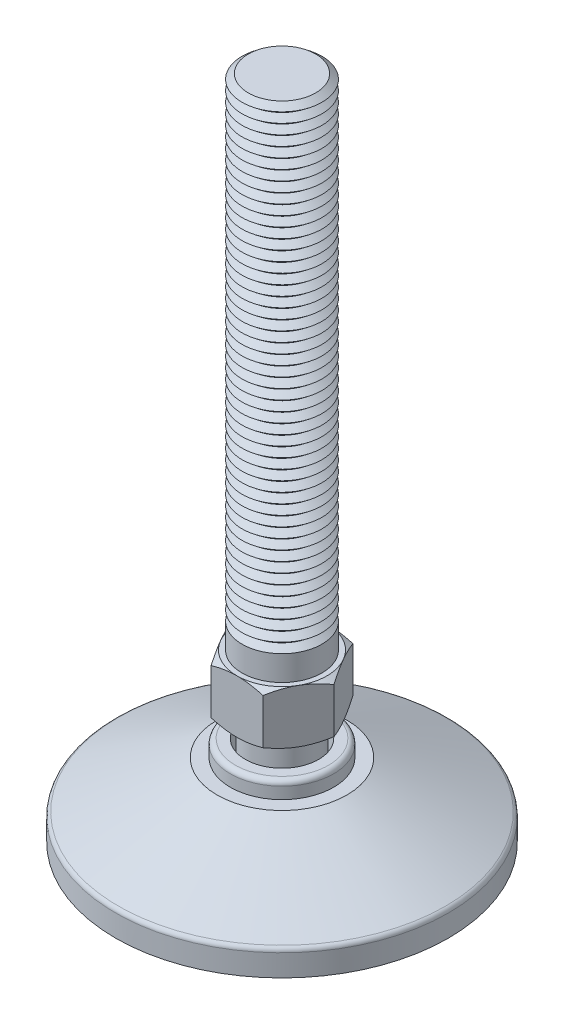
ISO-10303-21;
HEADER;
FILE_DESCRIPTION(('STEP AP214'),'2;1');
FILE_NAME('part.step','',(''),(''),'','','');
FILE_SCHEMA(('AUTOMOTIVE_DESIGN { 1 0 10303 214 1 1 1 1 }'));
ENDSEC;
DATA;
#1=APPLICATION_CONTEXT('core data for automotive mechanical design processes');
#2=APPLICATION_PROTOCOL_DEFINITION('international standard','automotive_design',2000,#1);
#3=PRODUCT_CONTEXT('',#1,'mechanical');
#4=PRODUCT('Part','Part','',(#3));
#5=PRODUCT_RELATED_PRODUCT_CATEGORY('part','',(#4));
#6=PRODUCT_DEFINITION_FORMATION('','',#4);
#7=PRODUCT_DEFINITION_CONTEXT('part definition',#1,'design');
#8=PRODUCT_DEFINITION('design','',#6,#7);
#9=PRODUCT_DEFINITION_SHAPE('','',#8);
#10=(LENGTH_UNIT() NAMED_UNIT(*) SI_UNIT(.MILLI.,.METRE.));
#11=(NAMED_UNIT(*) PLANE_ANGLE_UNIT() SI_UNIT($,.RADIAN.));
#12=(NAMED_UNIT(*) SI_UNIT($,.STERADIAN.) SOLID_ANGLE_UNIT());
#13=UNCERTAINTY_MEASURE_WITH_UNIT(LENGTH_MEASURE(1.E-05),#10,'distance_accuracy_value','');
#14=(GEOMETRIC_REPRESENTATION_CONTEXT(3) GLOBAL_UNCERTAINTY_ASSIGNED_CONTEXT((#13)) GLOBAL_UNIT_ASSIGNED_CONTEXT((#10,
#11,#12)) REPRESENTATION_CONTEXT('',''));
#15=CARTESIAN_POINT('',(0.,0.,0.));
#16=DIRECTION('',(0.,0.,1.));
#17=DIRECTION('',(1.,0.,0.));
#18=AXIS2_PLACEMENT_3D('',#15,#16,#17);
#19=CARTESIAN_POINT('',(0.,3.,0.));
#20=DIRECTION('',(0.,-1.,0.));
#21=DIRECTION('',(0.,0.,-1.));
#22=AXIS2_PLACEMENT_3D('',#19,#20,#21);
#23=CYLINDRICAL_SURFACE('',#22,47.);
#24=CARTESIAN_POINT('',(0.,3.,0.));
#25=DIRECTION('',(0.,1.,0.));
#26=DIRECTION('',(0.,0.,1.));
#27=AXIS2_PLACEMENT_3D('',#24,#25,#26);
#28=CIRCLE('',#27,47.);
#29=CARTESIAN_POINT('',(0.,3.,47.));
#30=VERTEX_POINT('',#29);
#31=EDGE_CURVE('P0_E10',#30,#30,#28,.T.);
#32=ORIENTED_EDGE('',*,*,#31,.F.);
#33=EDGE_LOOP('',(#32));
#34=FACE_BOUND('',#33,.T.);
#35=CARTESIAN_POINT('',(0.,0.,0.));
#36=DIRECTION('',(0.,1.,0.));
#37=DIRECTION('',(0.,0.,1.));
#38=AXIS2_PLACEMENT_3D('',#35,#36,#37);
#39=CIRCLE('',#38,47.);
#40=CARTESIAN_POINT('',(0.,0.,47.));
#41=VERTEX_POINT('',#40);
#42=EDGE_CURVE('P0_E17',#41,#41,#39,.T.);
#43=ORIENTED_EDGE('',*,*,#42,.T.);
#44=EDGE_LOOP('',(#43));
#45=FACE_BOUND('',#44,.T.);
#46=ADVANCED_FACE('P0_F14',(#34,#45),#23,.T.);
#47=CARTESIAN_POINT('',(0.,3.,0.));
#48=DIRECTION('',(0.,1.,0.));
#49=DIRECTION('',(0.,0.,1.));
#50=AXIS2_PLACEMENT_3D('',#47,#48,#49);
#51=PLANE('',#50);
#52=CARTESIAN_POINT('',(0.,3.,0.));
#53=DIRECTION('',(0.,1.,0.));
#54=DIRECTION('',(0.,0.,1.));
#55=AXIS2_PLACEMENT_3D('',#52,#53,#54);
#56=CIRCLE('',#55,15.6666666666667);
#57=CARTESIAN_POINT('',(0.,3.,15.6666666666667));
#58=VERTEX_POINT('',#57);
#59=EDGE_CURVE('P0_E26',#58,#58,#56,.T.);
#60=ORIENTED_EDGE('',*,*,#59,.F.);
#61=EDGE_LOOP('',(#60));
#62=FACE_BOUND('',#61,.T.);
#63=ORIENTED_EDGE('',*,*,#31,.T.);
#64=EDGE_LOOP('',(#63));
#65=FACE_BOUND('',#64,.T.);
#66=ADVANCED_FACE('P0_F41',(#62,#65),#51,.T.);
#67=CARTESIAN_POINT('',(0.,0.,0.));
#68=DIRECTION('',(0.,1.,0.));
#69=DIRECTION('',(0.,0.,1.));
#70=AXIS2_PLACEMENT_3D('',#67,#68,#69);
#71=PLANE('',#70);
#72=ORIENTED_EDGE('',*,*,#42,.F.);
#73=EDGE_LOOP('',(#72));
#74=FACE_BOUND('',#73,.T.);
#75=ADVANCED_FACE('P0_F37',(#74),#71,.F.);
#76=CARTESIAN_POINT('',(0.,2.,0.));
#77=DIRECTION('',(0.,1.,0.));
#78=DIRECTION('',(0.,0.,1.));
#79=AXIS2_PLACEMENT_3D('',#76,#77,#78);
#80=CYLINDRICAL_SURFACE('',#79,15.6666666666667);
#81=CARTESIAN_POINT('',(0.,2.,0.));
#82=DIRECTION('',(0.,1.,0.));
#83=DIRECTION('',(0.,0.,1.));
#84=AXIS2_PLACEMENT_3D('',#81,#82,#83);
#85=CIRCLE('',#84,15.6666666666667);
#86=CARTESIAN_POINT('',(0.,2.,15.6666666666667));
#87=VERTEX_POINT('',#86);
#88=EDGE_CURVE('P0_E24',#87,#87,#85,.T.);
#89=ORIENTED_EDGE('',*,*,#88,.F.);
#90=EDGE_LOOP('',(#89));
#91=FACE_BOUND('',#90,.T.);
#92=ORIENTED_EDGE('',*,*,#59,.T.);
#93=EDGE_LOOP('',(#92));
#94=FACE_BOUND('',#93,.T.);
#95=ADVANCED_FACE('P0_F34',(#91,#94),#80,.F.);
#96=CARTESIAN_POINT('',(0.,2.,0.));
#97=DIRECTION('',(0.,1.,0.));
#98=DIRECTION('',(0.,0.,1.));
#99=AXIS2_PLACEMENT_3D('',#96,#97,#98);
#100=PLANE('',#99);
#101=ORIENTED_EDGE('',*,*,#88,.T.);
#102=EDGE_LOOP('',(#101));
#103=FACE_BOUND('',#102,.T.);
#104=ADVANCED_FACE('P0_F32',(#103),#100,.T.);
#105=CLOSED_SHELL('',(#46,#66,#75,#95,#104));
#106=MANIFOLD_SOLID_BREP('P0_B1',#105);
#107=CARTESIAN_POINT('',(0.,190.,0.));
#108=DIRECTION('',(0.,-1.,0.));
#109=DIRECTION('',(0.,0.,-1.));
#110=AXIS2_PLACEMENT_3D('',#107,#108,#109);
#111=CONICAL_SURFACE('',#110,10.1265006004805,0.895664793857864);
#112=CARTESIAN_POINT('',(0.,188.5,0.));
#113=DIRECTION('',(0.,-1.,0.));
#114=DIRECTION('',(0.,0.,-1.));
#115=AXIS2_PLACEMENT_3D('',#112,#113,#114);
#116=CIRCLE('',#115,12.);
#117=CARTESIAN_POINT('',(0.,188.5,-12.));
#118=VERTEX_POINT('',#117);
#119=EDGE_CURVE('P1_E1716',#118,#118,#116,.T.);
#120=ORIENTED_EDGE('',*,*,#119,.F.);
#121=EDGE_LOOP('',(#120));
#122=FACE_BOUND('',#121,.T.);
#123=CARTESIAN_POINT('',(0.,190.,0.));
#124=DIRECTION('',(0.,-1.,0.));
#125=DIRECTION('',(0.,0.,-1.));
#126=AXIS2_PLACEMENT_3D('',#123,#124,#125);
#127=CIRCLE('',#126,10.1265006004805);
#128=CARTESIAN_POINT('',(0.,190.,-10.1265006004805));
#129=VERTEX_POINT('',#128);
#130=EDGE_CURVE('P1_E1725',#129,#129,#127,.T.);
#131=ORIENTED_EDGE('',*,*,#130,.T.);
#132=EDGE_LOOP('',(#131));
#133=FACE_BOUND('',#132,.T.);
#134=ADVANCED_FACE('P1_F16',(#122,#133),#111,.T.);
#135=CARTESIAN_POINT('',(0.,191.5,0.));
#136=DIRECTION('',(0.,1.,0.));
#137=DIRECTION('',(0.,0.,1.));
#138=AXIS2_PLACEMENT_3D('',#135,#136,#137);
#139=CONICAL_SURFACE('',#138,12.,0.895664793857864);
#140=ORIENTED_EDGE('',*,*,#130,.F.);
#141=EDGE_LOOP('',(#140));
#142=FACE_BOUND('',#141,.T.);
#143=CARTESIAN_POINT('',(0.,191.5,0.));
#144=DIRECTION('',(0.,-1.,0.));
#145=DIRECTION('',(0.,0.,-1.));
#146=AXIS2_PLACEMENT_3D('',#143,#144,#145);
#147=CIRCLE('',#146,12.);
#148=CARTESIAN_POINT('',(0.,191.5,-12.));
#149=VERTEX_POINT('',#148);
#150=EDGE_CURVE('P1_E1722',#149,#149,#147,.T.);
#151=ORIENTED_EDGE('',*,*,#150,.T.);
#152=EDGE_LOOP('',(#151));
#153=FACE_BOUND('',#152,.T.);
#154=ADVANCED_FACE('P1_F308',(#142,#153),#139,.T.);
#155=CARTESIAN_POINT('',(0.,202.,0.));
#156=DIRECTION('',(0.,1.,0.));
#157=DIRECTION('',(0.,0.,1.));
#158=AXIS2_PLACEMENT_3D('',#155,#156,#157);
#159=PLANE('',#158);
#160=CARTESIAN_POINT('',(0.,202.,0.));
#161=DIRECTION('',(0.,-1.,0.));
#162=DIRECTION('',(0.,0.,-1.));
#163=AXIS2_PLACEMENT_3D('',#160,#161,#162);
#164=CIRCLE('',#163,10.1265006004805);
#165=CARTESIAN_POINT('',(0.,202.,-10.1265006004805));
#166=VERTEX_POINT('',#165);
#167=EDGE_CURVE('P1_E143',#166,#166,#164,.T.);
#168=ORIENTED_EDGE('',*,*,#167,.F.);
#169=EDGE_LOOP('',(#168));
#170=FACE_BOUND('',#169,.T.);
#171=ADVANCED_FACE('P1_F314',(#170),#159,.T.);
#172=CARTESIAN_POINT('',(0.,202.,0.));
#173=DIRECTION('',(0.,-1.,0.));
#174=DIRECTION('',(0.,0.,-1.));
#175=AXIS2_PLACEMENT_3D('',#172,#173,#174);
#176=CONICAL_SURFACE('',#175,10.1265006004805,0.895664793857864);
#177=CARTESIAN_POINT('',(0.,200.5,0.));
#178=DIRECTION('',(0.,-1.,0.));
#179=DIRECTION('',(0.,0.,-1.));
#180=AXIS2_PLACEMENT_3D('',#177,#178,#179);
#181=CIRCLE('',#180,12.);
#182=CARTESIAN_POINT('',(0.,200.5,-12.));
#183=VERTEX_POINT('',#182);
#184=EDGE_CURVE('P1_E353',#183,#183,#181,.T.);
#185=ORIENTED_EDGE('',*,*,#184,.F.);
#186=EDGE_LOOP('',(#185));
#187=FACE_BOUND('',#186,.T.);
#188=ORIENTED_EDGE('',*,*,#167,.T.);
#189=EDGE_LOOP('',(#188));
#190=FACE_BOUND('',#189,.T.);
#191=ADVANCED_FACE('P1_F211',(#187,#190),#176,.T.);
#192=CARTESIAN_POINT('',(0.,200.5,0.));
#193=DIRECTION('',(0.,1.,0.));
#194=DIRECTION('',(0.,0.,1.));
#195=AXIS2_PLACEMENT_3D('',#192,#193,#194);
#196=CONICAL_SURFACE('',#195,12.,0.895664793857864);
#197=CARTESIAN_POINT('',(0.,199.,0.));
#198=DIRECTION('',(0.,-1.,0.));
#199=DIRECTION('',(0.,0.,-1.));
#200=AXIS2_PLACEMENT_3D('',#197,#198,#199);
#201=CIRCLE('',#200,10.1265006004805);
#202=CARTESIAN_POINT('',(0.,199.,-10.1265006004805));
#203=VERTEX_POINT('',#202);
#204=EDGE_CURVE('P1_E352',#203,#203,#201,.T.);
#205=ORIENTED_EDGE('',*,*,#204,.F.);
#206=EDGE_LOOP('',(#205));
#207=FACE_BOUND('',#206,.T.);
#208=ORIENTED_EDGE('',*,*,#184,.T.);
#209=EDGE_LOOP('',(#208));
#210=FACE_BOUND('',#209,.T.);
#211=ADVANCED_FACE('P1_F339',(#207,#210),#196,.T.);
#212=CARTESIAN_POINT('',(0.,199.,0.));
#213=DIRECTION('',(0.,-1.,0.));
#214=DIRECTION('',(0.,0.,-1.));
#215=AXIS2_PLACEMENT_3D('',#212,#213,#214);
#216=CONICAL_SURFACE('',#215,10.1265006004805,0.895664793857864);
#217=CARTESIAN_POINT('',(0.,197.5,0.));
#218=DIRECTION('',(0.,-1.,0.));
#219=DIRECTION('',(0.,0.,-1.));
#220=AXIS2_PLACEMENT_3D('',#217,#218,#219);
#221=CIRCLE('',#220,12.);
#222=CARTESIAN_POINT('',(0.,197.5,-12.));
#223=VERTEX_POINT('',#222);
#224=EDGE_CURVE('P1_E349',#223,#223,#221,.T.);
#225=ORIENTED_EDGE('',*,*,#224,.F.);
#226=EDGE_LOOP('',(#225));
#227=FACE_BOUND('',#226,.T.);
#228=ORIENTED_EDGE('',*,*,#204,.T.);
#229=EDGE_LOOP('',(#228));
#230=FACE_BOUND('',#229,.T.);
#231=ADVANCED_FACE('P1_F334',(#227,#230),#216,.T.);
#232=CARTESIAN_POINT('',(0.,197.5,0.));
#233=DIRECTION('',(0.,1.,0.));
#234=DIRECTION('',(0.,0.,1.));
#235=AXIS2_PLACEMENT_3D('',#232,#233,#234);
#236=CONICAL_SURFACE('',#235,12.,0.895664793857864);
#237=CARTESIAN_POINT('',(0.,196.,0.));
#238=DIRECTION('',(0.,-1.,0.));
#239=DIRECTION('',(0.,0.,-1.));
#240=AXIS2_PLACEMENT_3D('',#237,#238,#239);
#241=CIRCLE('',#240,10.1265006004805);
#242=CARTESIAN_POINT('',(0.,196.,-10.1265006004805));
#243=VERTEX_POINT('',#242);
#244=EDGE_CURVE('P1_E358',#243,#243,#241,.T.);
#245=ORIENTED_EDGE('',*,*,#244,.F.);
#246=EDGE_LOOP('',(#245));
#247=FACE_BOUND('',#246,.T.);
#248=ORIENTED_EDGE('',*,*,#224,.T.);
#249=EDGE_LOOP('',(#248));
#250=FACE_BOUND('',#249,.T.);
#251=ADVANCED_FACE('P1_F331',(#247,#250),#236,.T.);
#252=CARTESIAN_POINT('',(0.,196.,0.));
#253=DIRECTION('',(0.,-1.,0.));
#254=DIRECTION('',(0.,0.,-1.));
#255=AXIS2_PLACEMENT_3D('',#252,#253,#254);
#256=CONICAL_SURFACE('',#255,10.1265006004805,0.895664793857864);
#257=CARTESIAN_POINT('',(0.,194.5,0.));
#258=DIRECTION('',(0.,-1.,0.));
#259=DIRECTION('',(0.,0.,-1.));
#260=AXIS2_PLACEMENT_3D('',#257,#258,#259);
#261=CIRCLE('',#260,12.);
#262=CARTESIAN_POINT('',(0.,194.5,-12.));
#263=VERTEX_POINT('',#262);
#264=EDGE_CURVE('P1_E1728',#263,#263,#261,.T.);
#265=ORIENTED_EDGE('',*,*,#264,.F.);
#266=EDGE_LOOP('',(#265));
#267=FACE_BOUND('',#266,.T.);
#268=ORIENTED_EDGE('',*,*,#244,.T.);
#269=EDGE_LOOP('',(#268));
#270=FACE_BOUND('',#269,.T.);
#271=ADVANCED_FACE('P1_F325',(#267,#270),#256,.T.);
#272=CARTESIAN_POINT('',(0.,194.5,0.));
#273=DIRECTION('',(0.,1.,0.));
#274=DIRECTION('',(0.,0.,1.));
#275=AXIS2_PLACEMENT_3D('',#272,#273,#274);
#276=CONICAL_SURFACE('',#275,12.,0.895664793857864);
#277=CARTESIAN_POINT('',(0.,193.,0.));
#278=DIRECTION('',(0.,-1.,0.));
#279=DIRECTION('',(0.,0.,-1.));
#280=AXIS2_PLACEMENT_3D('',#277,#278,#279);
#281=CIRCLE('',#280,10.1265006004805);
#282=CARTESIAN_POINT('',(0.,193.,-10.1265006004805));
#283=VERTEX_POINT('',#282);
#284=EDGE_CURVE('P1_E1731',#283,#283,#281,.T.);
#285=ORIENTED_EDGE('',*,*,#284,.F.);
#286=EDGE_LOOP('',(#285));
#287=FACE_BOUND('',#286,.T.);
#288=ORIENTED_EDGE('',*,*,#264,.T.);
#289=EDGE_LOOP('',(#288));
#290=FACE_BOUND('',#289,.T.);
#291=ADVANCED_FACE('P1_F321',(#287,#290),#276,.T.);
#292=CARTESIAN_POINT('',(0.,193.,0.));
#293=DIRECTION('',(0.,-1.,0.));
#294=DIRECTION('',(0.,0.,-1.));
#295=AXIS2_PLACEMENT_3D('',#292,#293,#294);
#296=CONICAL_SURFACE('',#295,10.1265006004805,0.895664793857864);
#297=ORIENTED_EDGE('',*,*,#150,.F.);
#298=EDGE_LOOP('',(#297));
#299=FACE_BOUND('',#298,.T.);
#300=ORIENTED_EDGE('',*,*,#284,.T.);
#301=EDGE_LOOP('',(#300));
#302=FACE_BOUND('',#301,.T.);
#303=ADVANCED_FACE('P1_F324',(#299,#302),#296,.T.);
#304=CARTESIAN_POINT('',(0.,187.,0.));
#305=DIRECTION('',(0.,-1.,0.));
#306=DIRECTION('',(0.,0.,-1.));
#307=AXIS2_PLACEMENT_3D('',#304,#305,#306);
#308=CONICAL_SURFACE('',#307,10.1265006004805,0.895664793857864);
#309=CARTESIAN_POINT('',(0.,185.5,0.));
#310=DIRECTION('',(0.,-1.,0.));
#311=DIRECTION('',(0.,0.,-1.));
#312=AXIS2_PLACEMENT_3D('',#309,#310,#311);
#313=CIRCLE('',#312,12.);
#314=CARTESIAN_POINT('',(0.,185.5,-12.));
#315=VERTEX_POINT('',#314);
#316=EDGE_CURVE('P1_E1710',#315,#315,#313,.T.);
#317=ORIENTED_EDGE('',*,*,#316,.F.);
#318=EDGE_LOOP('',(#317));
#319=FACE_BOUND('',#318,.T.);
#320=CARTESIAN_POINT('',(0.,187.,0.));
#321=DIRECTION('',(0.,-1.,0.));
#322=DIRECTION('',(0.,0.,-1.));
#323=AXIS2_PLACEMENT_3D('',#320,#321,#322);
#324=CIRCLE('',#323,10.1265006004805);
#325=CARTESIAN_POINT('',(0.,187.,-10.1265006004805));
#326=VERTEX_POINT('',#325);
#327=EDGE_CURVE('P1_E1719',#326,#326,#324,.T.);
#328=ORIENTED_EDGE('',*,*,#327,.T.);
#329=EDGE_LOOP('',(#328));
#330=FACE_BOUND('',#329,.T.);
#331=ADVANCED_FACE('P1_F329',(#319,#330),#308,.T.);
#332=CARTESIAN_POINT('',(0.,188.5,0.));
#333=DIRECTION('',(0.,1.,0.));
#334=DIRECTION('',(0.,0.,1.));
#335=AXIS2_PLACEMENT_3D('',#332,#333,#334);
#336=CONICAL_SURFACE('',#335,12.,0.895664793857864);
#337=ORIENTED_EDGE('',*,*,#327,.F.);
#338=EDGE_LOOP('',(#337));
#339=FACE_BOUND('',#338,.T.);
#340=ORIENTED_EDGE('',*,*,#119,.T.);
#341=EDGE_LOOP('',(#340));
#342=FACE_BOUND('',#341,.T.);
#343=ADVANCED_FACE('P1_F1364',(#339,#342),#336,.T.);
#344=CARTESIAN_POINT('',(0.,184.,0.));
#345=DIRECTION('',(0.,-1.,0.));
#346=DIRECTION('',(0.,0.,-1.));
#347=AXIS2_PLACEMENT_3D('',#344,#345,#346);
#348=CONICAL_SURFACE('',#347,10.1265006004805,0.895664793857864);
#349=CARTESIAN_POINT('',(0.,182.5,0.));
#350=DIRECTION('',(0.,-1.,0.));
#351=DIRECTION('',(0.,0.,-1.));
#352=AXIS2_PLACEMENT_3D('',#349,#350,#351);
#353=CIRCLE('',#352,12.);
#354=CARTESIAN_POINT('',(0.,182.5,-12.));
#355=VERTEX_POINT('',#354);
#356=EDGE_CURVE('P1_E1704',#355,#355,#353,.T.);
#357=ORIENTED_EDGE('',*,*,#356,.F.);
#358=EDGE_LOOP('',(#357));
#359=FACE_BOUND('',#358,.T.);
#360=CARTESIAN_POINT('',(0.,184.,0.));
#361=DIRECTION('',(0.,-1.,0.));
#362=DIRECTION('',(0.,0.,-1.));
#363=AXIS2_PLACEMENT_3D('',#360,#361,#362);
#364=CIRCLE('',#363,10.1265006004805);
#365=CARTESIAN_POINT('',(0.,184.,-10.1265006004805));
#366=VERTEX_POINT('',#365);
#367=EDGE_CURVE('P1_E1713',#366,#366,#364,.T.);
#368=ORIENTED_EDGE('',*,*,#367,.T.);
#369=EDGE_LOOP('',(#368));
#370=FACE_BOUND('',#369,.T.);
#371=ADVANCED_FACE('P1_F1354',(#359,#370),#348,.T.);
#372=CARTESIAN_POINT('',(0.,185.5,0.));
#373=DIRECTION('',(0.,1.,0.));
#374=DIRECTION('',(0.,0.,1.));
#375=AXIS2_PLACEMENT_3D('',#372,#373,#374);
#376=CONICAL_SURFACE('',#375,12.,0.895664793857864);
#377=ORIENTED_EDGE('',*,*,#367,.F.);
#378=EDGE_LOOP('',(#377));
#379=FACE_BOUND('',#378,.T.);
#380=ORIENTED_EDGE('',*,*,#316,.T.);
#381=EDGE_LOOP('',(#380));
#382=FACE_BOUND('',#381,.T.);
#383=ADVANCED_FACE('P1_F1344',(#379,#382),#376,.T.);
#384=CARTESIAN_POINT('',(0.,181.,0.));
#385=DIRECTION('',(0.,-1.,0.));
#386=DIRECTION('',(0.,0.,-1.));
#387=AXIS2_PLACEMENT_3D('',#384,#385,#386);
#388=CONICAL_SURFACE('',#387,10.1265006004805,0.895664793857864);
#389=CARTESIAN_POINT('',(0.,179.5,0.));
#390=DIRECTION('',(0.,-1.,0.));
#391=DIRECTION('',(0.,0.,-1.));
#392=AXIS2_PLACEMENT_3D('',#389,#390,#391);
#393=CIRCLE('',#392,12.);
#394=CARTESIAN_POINT('',(0.,179.5,-12.));
#395=VERTEX_POINT('',#394);
#396=EDGE_CURVE('P1_E1698',#395,#395,#393,.T.);
#397=ORIENTED_EDGE('',*,*,#396,.F.);
#398=EDGE_LOOP('',(#397));
#399=FACE_BOUND('',#398,.T.);
#400=CARTESIAN_POINT('',(0.,181.,0.));
#401=DIRECTION('',(0.,-1.,0.));
#402=DIRECTION('',(0.,0.,-1.));
#403=AXIS2_PLACEMENT_3D('',#400,#401,#402);
#404=CIRCLE('',#403,10.1265006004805);
#405=CARTESIAN_POINT('',(0.,181.,-10.1265006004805));
#406=VERTEX_POINT('',#405);
#407=EDGE_CURVE('P1_E1707',#406,#406,#404,.T.);
#408=ORIENTED_EDGE('',*,*,#407,.T.);
#409=EDGE_LOOP('',(#408));
#410=FACE_BOUND('',#409,.T.);
#411=ADVANCED_FACE('P1_F1334',(#399,#410),#388,.T.);
#412=CARTESIAN_POINT('',(0.,182.5,0.));
#413=DIRECTION('',(0.,1.,0.));
#414=DIRECTION('',(0.,0.,1.));
#415=AXIS2_PLACEMENT_3D('',#412,#413,#414);
#416=CONICAL_SURFACE('',#415,12.,0.895664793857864);
#417=ORIENTED_EDGE('',*,*,#407,.F.);
#418=EDGE_LOOP('',(#417));
#419=FACE_BOUND('',#418,.T.);
#420=ORIENTED_EDGE('',*,*,#356,.T.);
#421=EDGE_LOOP('',(#420));
#422=FACE_BOUND('',#421,.T.);
#423=ADVANCED_FACE('P1_F1324',(#419,#422),#416,.T.);
#424=CARTESIAN_POINT('',(0.,178.,0.));
#425=DIRECTION('',(0.,-1.,0.));
#426=DIRECTION('',(0.,0.,-1.));
#427=AXIS2_PLACEMENT_3D('',#424,#425,#426);
#428=CONICAL_SURFACE('',#427,10.1265006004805,0.895664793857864);
#429=CARTESIAN_POINT('',(0.,176.5,0.));
#430=DIRECTION('',(0.,-1.,0.));
#431=DIRECTION('',(0.,0.,-1.));
#432=AXIS2_PLACEMENT_3D('',#429,#430,#431);
#433=CIRCLE('',#432,12.);
#434=CARTESIAN_POINT('',(0.,176.5,-12.));
#435=VERTEX_POINT('',#434);
#436=EDGE_CURVE('P1_E1692',#435,#435,#433,.T.);
#437=ORIENTED_EDGE('',*,*,#436,.F.);
#438=EDGE_LOOP('',(#437));
#439=FACE_BOUND('',#438,.T.);
#440=CARTESIAN_POINT('',(0.,178.,0.));
#441=DIRECTION('',(0.,-1.,0.));
#442=DIRECTION('',(0.,0.,-1.));
#443=AXIS2_PLACEMENT_3D('',#440,#441,#442);
#444=CIRCLE('',#443,10.1265006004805);
#445=CARTESIAN_POINT('',(0.,178.,-10.1265006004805));
#446=VERTEX_POINT('',#445);
#447=EDGE_CURVE('P1_E1701',#446,#446,#444,.T.);
#448=ORIENTED_EDGE('',*,*,#447,.T.);
#449=EDGE_LOOP('',(#448));
#450=FACE_BOUND('',#449,.T.);
#451=ADVANCED_FACE('P1_F1314',(#439,#450),#428,.T.);
#452=CARTESIAN_POINT('',(0.,179.5,0.));
#453=DIRECTION('',(0.,1.,0.));
#454=DIRECTION('',(0.,0.,1.));
#455=AXIS2_PLACEMENT_3D('',#452,#453,#454);
#456=CONICAL_SURFACE('',#455,12.,0.895664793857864);
#457=ORIENTED_EDGE('',*,*,#447,.F.);
#458=EDGE_LOOP('',(#457));
#459=FACE_BOUND('',#458,.T.);
#460=ORIENTED_EDGE('',*,*,#396,.T.);
#461=EDGE_LOOP('',(#460));
#462=FACE_BOUND('',#461,.T.);
#463=ADVANCED_FACE('P1_F1304',(#459,#462),#456,.T.);
#464=CARTESIAN_POINT('',(0.,175.,0.));
#465=DIRECTION('',(0.,-1.,0.));
#466=DIRECTION('',(0.,0.,-1.));
#467=AXIS2_PLACEMENT_3D('',#464,#465,#466);
#468=CONICAL_SURFACE('',#467,10.1265006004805,0.895664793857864);
#469=CARTESIAN_POINT('',(0.,173.5,0.));
#470=DIRECTION('',(0.,-1.,0.));
#471=DIRECTION('',(0.,0.,-1.));
#472=AXIS2_PLACEMENT_3D('',#469,#470,#471);
#473=CIRCLE('',#472,12.);
#474=CARTESIAN_POINT('',(0.,173.5,-12.));
#475=VERTEX_POINT('',#474);
#476=EDGE_CURVE('P1_E1686',#475,#475,#473,.T.);
#477=ORIENTED_EDGE('',*,*,#476,.F.);
#478=EDGE_LOOP('',(#477));
#479=FACE_BOUND('',#478,.T.);
#480=CARTESIAN_POINT('',(0.,175.,0.));
#481=DIRECTION('',(0.,-1.,0.));
#482=DIRECTION('',(0.,0.,-1.));
#483=AXIS2_PLACEMENT_3D('',#480,#481,#482);
#484=CIRCLE('',#483,10.1265006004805);
#485=CARTESIAN_POINT('',(0.,175.,-10.1265006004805));
#486=VERTEX_POINT('',#485);
#487=EDGE_CURVE('P1_E1695',#486,#486,#484,.T.);
#488=ORIENTED_EDGE('',*,*,#487,.T.);
#489=EDGE_LOOP('',(#488));
#490=FACE_BOUND('',#489,.T.);
#491=ADVANCED_FACE('P1_F1294',(#479,#490),#468,.T.);
#492=CARTESIAN_POINT('',(0.,176.5,0.));
#493=DIRECTION('',(0.,1.,0.));
#494=DIRECTION('',(0.,0.,1.));
#495=AXIS2_PLACEMENT_3D('',#492,#493,#494);
#496=CONICAL_SURFACE('',#495,12.,0.895664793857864);
#497=ORIENTED_EDGE('',*,*,#487,.F.);
#498=EDGE_LOOP('',(#497));
#499=FACE_BOUND('',#498,.T.);
#500=ORIENTED_EDGE('',*,*,#436,.T.);
#501=EDGE_LOOP('',(#500));
#502=FACE_BOUND('',#501,.T.);
#503=ADVANCED_FACE('P1_F1284',(#499,#502),#496,.T.);
#504=CARTESIAN_POINT('',(0.,172.,0.));
#505=DIRECTION('',(0.,-1.,0.));
#506=DIRECTION('',(0.,0.,-1.));
#507=AXIS2_PLACEMENT_3D('',#504,#505,#506);
#508=CONICAL_SURFACE('',#507,10.1265006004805,0.895664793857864);
#509=CARTESIAN_POINT('',(0.,170.5,0.));
#510=DIRECTION('',(0.,-1.,0.));
#511=DIRECTION('',(0.,0.,-1.));
#512=AXIS2_PLACEMENT_3D('',#509,#510,#511);
#513=CIRCLE('',#512,12.);
#514=CARTESIAN_POINT('',(0.,170.5,-12.));
#515=VERTEX_POINT('',#514);
#516=EDGE_CURVE('P1_E1680',#515,#515,#513,.T.);
#517=ORIENTED_EDGE('',*,*,#516,.F.);
#518=EDGE_LOOP('',(#517));
#519=FACE_BOUND('',#518,.T.);
#520=CARTESIAN_POINT('',(0.,172.,0.));
#521=DIRECTION('',(0.,-1.,0.));
#522=DIRECTION('',(0.,0.,-1.));
#523=AXIS2_PLACEMENT_3D('',#520,#521,#522);
#524=CIRCLE('',#523,10.1265006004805);
#525=CARTESIAN_POINT('',(0.,172.,-10.1265006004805));
#526=VERTEX_POINT('',#525);
#527=EDGE_CURVE('P1_E1689',#526,#526,#524,.T.);
#528=ORIENTED_EDGE('',*,*,#527,.T.);
#529=EDGE_LOOP('',(#528));
#530=FACE_BOUND('',#529,.T.);
#531=ADVANCED_FACE('P1_F1274',(#519,#530),#508,.T.);
#532=CARTESIAN_POINT('',(0.,173.5,0.));
#533=DIRECTION('',(0.,1.,0.));
#534=DIRECTION('',(0.,0.,1.));
#535=AXIS2_PLACEMENT_3D('',#532,#533,#534);
#536=CONICAL_SURFACE('',#535,12.,0.895664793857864);
#537=ORIENTED_EDGE('',*,*,#527,.F.);
#538=EDGE_LOOP('',(#537));
#539=FACE_BOUND('',#538,.T.);
#540=ORIENTED_EDGE('',*,*,#476,.T.);
#541=EDGE_LOOP('',(#540));
#542=FACE_BOUND('',#541,.T.);
#543=ADVANCED_FACE('P1_F1264',(#539,#542),#536,.T.);
#544=CARTESIAN_POINT('',(0.,169.,0.));
#545=DIRECTION('',(0.,-1.,0.));
#546=DIRECTION('',(0.,0.,-1.));
#547=AXIS2_PLACEMENT_3D('',#544,#545,#546);
#548=CONICAL_SURFACE('',#547,10.1265006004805,0.895664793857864);
#549=CARTESIAN_POINT('',(0.,167.5,0.));
#550=DIRECTION('',(0.,-1.,0.));
#551=DIRECTION('',(0.,0.,-1.));
#552=AXIS2_PLACEMENT_3D('',#549,#550,#551);
#553=CIRCLE('',#552,12.);
#554=CARTESIAN_POINT('',(0.,167.5,-12.));
#555=VERTEX_POINT('',#554);
#556=EDGE_CURVE('P1_E1674',#555,#555,#553,.T.);
#557=ORIENTED_EDGE('',*,*,#556,.F.);
#558=EDGE_LOOP('',(#557));
#559=FACE_BOUND('',#558,.T.);
#560=CARTESIAN_POINT('',(0.,169.,0.));
#561=DIRECTION('',(0.,-1.,0.));
#562=DIRECTION('',(0.,0.,-1.));
#563=AXIS2_PLACEMENT_3D('',#560,#561,#562);
#564=CIRCLE('',#563,10.1265006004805);
#565=CARTESIAN_POINT('',(0.,169.,-10.1265006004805));
#566=VERTEX_POINT('',#565);
#567=EDGE_CURVE('P1_E1683',#566,#566,#564,.T.);
#568=ORIENTED_EDGE('',*,*,#567,.T.);
#569=EDGE_LOOP('',(#568));
#570=FACE_BOUND('',#569,.T.);
#571=ADVANCED_FACE('P1_F1254',(#559,#570),#548,.T.);
#572=CARTESIAN_POINT('',(0.,170.5,0.));
#573=DIRECTION('',(0.,1.,0.));
#574=DIRECTION('',(0.,0.,1.));
#575=AXIS2_PLACEMENT_3D('',#572,#573,#574);
#576=CONICAL_SURFACE('',#575,12.,0.895664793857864);
#577=ORIENTED_EDGE('',*,*,#567,.F.);
#578=EDGE_LOOP('',(#577));
#579=FACE_BOUND('',#578,.T.);
#580=ORIENTED_EDGE('',*,*,#516,.T.);
#581=EDGE_LOOP('',(#580));
#582=FACE_BOUND('',#581,.T.);
#583=ADVANCED_FACE('P1_F1244',(#579,#582),#576,.T.);
#584=CARTESIAN_POINT('',(0.,166.,0.));
#585=DIRECTION('',(0.,-1.,0.));
#586=DIRECTION('',(0.,0.,-1.));
#587=AXIS2_PLACEMENT_3D('',#584,#585,#586);
#588=CONICAL_SURFACE('',#587,10.1265006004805,0.895664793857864);
#589=CARTESIAN_POINT('',(0.,164.5,0.));
#590=DIRECTION('',(0.,-1.,0.));
#591=DIRECTION('',(0.,0.,-1.));
#592=AXIS2_PLACEMENT_3D('',#589,#590,#591);
#593=CIRCLE('',#592,12.);
#594=CARTESIAN_POINT('',(0.,164.5,-12.));
#595=VERTEX_POINT('',#594);
#596=EDGE_CURVE('P1_E1668',#595,#595,#593,.T.);
#597=ORIENTED_EDGE('',*,*,#596,.F.);
#598=EDGE_LOOP('',(#597));
#599=FACE_BOUND('',#598,.T.);
#600=CARTESIAN_POINT('',(0.,166.,0.));
#601=DIRECTION('',(0.,-1.,0.));
#602=DIRECTION('',(0.,0.,-1.));
#603=AXIS2_PLACEMENT_3D('',#600,#601,#602);
#604=CIRCLE('',#603,10.1265006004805);
#605=CARTESIAN_POINT('',(0.,166.,-10.1265006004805));
#606=VERTEX_POINT('',#605);
#607=EDGE_CURVE('P1_E1677',#606,#606,#604,.T.);
#608=ORIENTED_EDGE('',*,*,#607,.T.);
#609=EDGE_LOOP('',(#608));
#610=FACE_BOUND('',#609,.T.);
#611=ADVANCED_FACE('P1_F1234',(#599,#610),#588,.T.);
#612=CARTESIAN_POINT('',(0.,167.5,0.));
#613=DIRECTION('',(0.,1.,0.));
#614=DIRECTION('',(0.,0.,1.));
#615=AXIS2_PLACEMENT_3D('',#612,#613,#614);
#616=CONICAL_SURFACE('',#615,12.,0.895664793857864);
#617=ORIENTED_EDGE('',*,*,#607,.F.);
#618=EDGE_LOOP('',(#617));
#619=FACE_BOUND('',#618,.T.);
#620=ORIENTED_EDGE('',*,*,#556,.T.);
#621=EDGE_LOOP('',(#620));
#622=FACE_BOUND('',#621,.T.);
#623=ADVANCED_FACE('P1_F1224',(#619,#622),#616,.T.);
#624=CARTESIAN_POINT('',(0.,163.,0.));
#625=DIRECTION('',(0.,-1.,0.));
#626=DIRECTION('',(0.,0.,-1.));
#627=AXIS2_PLACEMENT_3D('',#624,#625,#626);
#628=CONICAL_SURFACE('',#627,10.1265006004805,0.895664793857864);
#629=CARTESIAN_POINT('',(0.,161.5,0.));
#630=DIRECTION('',(0.,-1.,0.));
#631=DIRECTION('',(0.,0.,-1.));
#632=AXIS2_PLACEMENT_3D('',#629,#630,#631);
#633=CIRCLE('',#632,12.);
#634=CARTESIAN_POINT('',(0.,161.5,-12.));
#635=VERTEX_POINT('',#634);
#636=EDGE_CURVE('P1_E1662',#635,#635,#633,.T.);
#637=ORIENTED_EDGE('',*,*,#636,.F.);
#638=EDGE_LOOP('',(#637));
#639=FACE_BOUND('',#638,.T.);
#640=CARTESIAN_POINT('',(0.,163.,0.));
#641=DIRECTION('',(0.,-1.,0.));
#642=DIRECTION('',(0.,0.,-1.));
#643=AXIS2_PLACEMENT_3D('',#640,#641,#642);
#644=CIRCLE('',#643,10.1265006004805);
#645=CARTESIAN_POINT('',(0.,163.,-10.1265006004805));
#646=VERTEX_POINT('',#645);
#647=EDGE_CURVE('P1_E1671',#646,#646,#644,.T.);
#648=ORIENTED_EDGE('',*,*,#647,.T.);
#649=EDGE_LOOP('',(#648));
#650=FACE_BOUND('',#649,.T.);
#651=ADVANCED_FACE('P1_F1214',(#639,#650),#628,.T.);
#652=CARTESIAN_POINT('',(0.,164.5,0.));
#653=DIRECTION('',(0.,1.,0.));
#654=DIRECTION('',(0.,0.,1.));
#655=AXIS2_PLACEMENT_3D('',#652,#653,#654);
#656=CONICAL_SURFACE('',#655,12.,0.895664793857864);
#657=ORIENTED_EDGE('',*,*,#647,.F.);
#658=EDGE_LOOP('',(#657));
#659=FACE_BOUND('',#658,.T.);
#660=ORIENTED_EDGE('',*,*,#596,.T.);
#661=EDGE_LOOP('',(#660));
#662=FACE_BOUND('',#661,.T.);
#663=ADVANCED_FACE('P1_F1204',(#659,#662),#656,.T.);
#664=CARTESIAN_POINT('',(0.,160.,0.));
#665=DIRECTION('',(0.,-1.,0.));
#666=DIRECTION('',(0.,0.,-1.));
#667=AXIS2_PLACEMENT_3D('',#664,#665,#666);
#668=CONICAL_SURFACE('',#667,10.1265006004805,0.895664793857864);
#669=CARTESIAN_POINT('',(0.,158.5,0.));
#670=DIRECTION('',(0.,-1.,0.));
#671=DIRECTION('',(0.,0.,-1.));
#672=AXIS2_PLACEMENT_3D('',#669,#670,#671);
#673=CIRCLE('',#672,12.);
#674=CARTESIAN_POINT('',(0.,158.5,-12.));
#675=VERTEX_POINT('',#674);
#676=EDGE_CURVE('P1_E1656',#675,#675,#673,.T.);
#677=ORIENTED_EDGE('',*,*,#676,.F.);
#678=EDGE_LOOP('',(#677));
#679=FACE_BOUND('',#678,.T.);
#680=CARTESIAN_POINT('',(0.,160.,0.));
#681=DIRECTION('',(0.,-1.,0.));
#682=DIRECTION('',(0.,0.,-1.));
#683=AXIS2_PLACEMENT_3D('',#680,#681,#682);
#684=CIRCLE('',#683,10.1265006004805);
#685=CARTESIAN_POINT('',(0.,160.,-10.1265006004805));
#686=VERTEX_POINT('',#685);
#687=EDGE_CURVE('P1_E1665',#686,#686,#684,.T.);
#688=ORIENTED_EDGE('',*,*,#687,.T.);
#689=EDGE_LOOP('',(#688));
#690=FACE_BOUND('',#689,.T.);
#691=ADVANCED_FACE('P1_F1194',(#679,#690),#668,.T.);
#692=CARTESIAN_POINT('',(0.,161.5,0.));
#693=DIRECTION('',(0.,1.,0.));
#694=DIRECTION('',(0.,0.,1.));
#695=AXIS2_PLACEMENT_3D('',#692,#693,#694);
#696=CONICAL_SURFACE('',#695,12.,0.895664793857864);
#697=ORIENTED_EDGE('',*,*,#687,.F.);
#698=EDGE_LOOP('',(#697));
#699=FACE_BOUND('',#698,.T.);
#700=ORIENTED_EDGE('',*,*,#636,.T.);
#701=EDGE_LOOP('',(#700));
#702=FACE_BOUND('',#701,.T.);
#703=ADVANCED_FACE('P1_F1184',(#699,#702),#696,.T.);
#704=CARTESIAN_POINT('',(0.,157.,0.));
#705=DIRECTION('',(0.,-1.,0.));
#706=DIRECTION('',(0.,0.,-1.));
#707=AXIS2_PLACEMENT_3D('',#704,#705,#706);
#708=CONICAL_SURFACE('',#707,10.1265006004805,0.895664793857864);
#709=CARTESIAN_POINT('',(0.,155.5,0.));
#710=DIRECTION('',(0.,-1.,0.));
#711=DIRECTION('',(0.,0.,-1.));
#712=AXIS2_PLACEMENT_3D('',#709,#710,#711);
#713=CIRCLE('',#712,12.);
#714=CARTESIAN_POINT('',(0.,155.5,-12.));
#715=VERTEX_POINT('',#714);
#716=EDGE_CURVE('P1_E1650',#715,#715,#713,.T.);
#717=ORIENTED_EDGE('',*,*,#716,.F.);
#718=EDGE_LOOP('',(#717));
#719=FACE_BOUND('',#718,.T.);
#720=CARTESIAN_POINT('',(0.,157.,0.));
#721=DIRECTION('',(0.,-1.,0.));
#722=DIRECTION('',(0.,0.,-1.));
#723=AXIS2_PLACEMENT_3D('',#720,#721,#722);
#724=CIRCLE('',#723,10.1265006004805);
#725=CARTESIAN_POINT('',(0.,157.,-10.1265006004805));
#726=VERTEX_POINT('',#725);
#727=EDGE_CURVE('P1_E1659',#726,#726,#724,.T.);
#728=ORIENTED_EDGE('',*,*,#727,.T.);
#729=EDGE_LOOP('',(#728));
#730=FACE_BOUND('',#729,.T.);
#731=ADVANCED_FACE('P1_F1174',(#719,#730),#708,.T.);
#732=CARTESIAN_POINT('',(0.,158.5,0.));
#733=DIRECTION('',(0.,1.,0.));
#734=DIRECTION('',(0.,0.,1.));
#735=AXIS2_PLACEMENT_3D('',#732,#733,#734);
#736=CONICAL_SURFACE('',#735,12.,0.895664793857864);
#737=ORIENTED_EDGE('',*,*,#727,.F.);
#738=EDGE_LOOP('',(#737));
#739=FACE_BOUND('',#738,.T.);
#740=ORIENTED_EDGE('',*,*,#676,.T.);
#741=EDGE_LOOP('',(#740));
#742=FACE_BOUND('',#741,.T.);
#743=ADVANCED_FACE('P1_F1164',(#739,#742),#736,.T.);
#744=CARTESIAN_POINT('',(0.,154.,0.));
#745=DIRECTION('',(0.,-1.,0.));
#746=DIRECTION('',(0.,0.,-1.));
#747=AXIS2_PLACEMENT_3D('',#744,#745,#746);
#748=CONICAL_SURFACE('',#747,10.1265006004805,0.895664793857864);
#749=CARTESIAN_POINT('',(0.,152.5,0.));
#750=DIRECTION('',(0.,-1.,0.));
#751=DIRECTION('',(0.,0.,-1.));
#752=AXIS2_PLACEMENT_3D('',#749,#750,#751);
#753=CIRCLE('',#752,12.);
#754=CARTESIAN_POINT('',(0.,152.5,-12.));
#755=VERTEX_POINT('',#754);
#756=EDGE_CURVE('P1_E1644',#755,#755,#753,.T.);
#757=ORIENTED_EDGE('',*,*,#756,.F.);
#758=EDGE_LOOP('',(#757));
#759=FACE_BOUND('',#758,.T.);
#760=CARTESIAN_POINT('',(0.,154.,0.));
#761=DIRECTION('',(0.,-1.,0.));
#762=DIRECTION('',(0.,0.,-1.));
#763=AXIS2_PLACEMENT_3D('',#760,#761,#762);
#764=CIRCLE('',#763,10.1265006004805);
#765=CARTESIAN_POINT('',(0.,154.,-10.1265006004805));
#766=VERTEX_POINT('',#765);
#767=EDGE_CURVE('P1_E1653',#766,#766,#764,.T.);
#768=ORIENTED_EDGE('',*,*,#767,.T.);
#769=EDGE_LOOP('',(#768));
#770=FACE_BOUND('',#769,.T.);
#771=ADVANCED_FACE('P1_F1154',(#759,#770),#748,.T.);
#772=CARTESIAN_POINT('',(0.,155.5,0.));
#773=DIRECTION('',(0.,1.,0.));
#774=DIRECTION('',(0.,0.,1.));
#775=AXIS2_PLACEMENT_3D('',#772,#773,#774);
#776=CONICAL_SURFACE('',#775,12.,0.895664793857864);
#777=ORIENTED_EDGE('',*,*,#767,.F.);
#778=EDGE_LOOP('',(#777));
#779=FACE_BOUND('',#778,.T.);
#780=ORIENTED_EDGE('',*,*,#716,.T.);
#781=EDGE_LOOP('',(#780));
#782=FACE_BOUND('',#781,.T.);
#783=ADVANCED_FACE('P1_F1144',(#779,#782),#776,.T.);
#784=CARTESIAN_POINT('',(0.,151.,0.));
#785=DIRECTION('',(0.,-1.,0.));
#786=DIRECTION('',(0.,0.,-1.));
#787=AXIS2_PLACEMENT_3D('',#784,#785,#786);
#788=CONICAL_SURFACE('',#787,10.1265006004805,0.895664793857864);
#789=CARTESIAN_POINT('',(0.,149.5,0.));
#790=DIRECTION('',(0.,-1.,0.));
#791=DIRECTION('',(0.,0.,-1.));
#792=AXIS2_PLACEMENT_3D('',#789,#790,#791);
#793=CIRCLE('',#792,12.);
#794=CARTESIAN_POINT('',(0.,149.5,-12.));
#795=VERTEX_POINT('',#794);
#796=EDGE_CURVE('P1_E1638',#795,#795,#793,.T.);
#797=ORIENTED_EDGE('',*,*,#796,.F.);
#798=EDGE_LOOP('',(#797));
#799=FACE_BOUND('',#798,.T.);
#800=CARTESIAN_POINT('',(0.,151.,0.));
#801=DIRECTION('',(0.,-1.,0.));
#802=DIRECTION('',(0.,0.,-1.));
#803=AXIS2_PLACEMENT_3D('',#800,#801,#802);
#804=CIRCLE('',#803,10.1265006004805);
#805=CARTESIAN_POINT('',(0.,151.,-10.1265006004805));
#806=VERTEX_POINT('',#805);
#807=EDGE_CURVE('P1_E1647',#806,#806,#804,.T.);
#808=ORIENTED_EDGE('',*,*,#807,.T.);
#809=EDGE_LOOP('',(#808));
#810=FACE_BOUND('',#809,.T.);
#811=ADVANCED_FACE('P1_F1134',(#799,#810),#788,.T.);
#812=CARTESIAN_POINT('',(0.,152.5,0.));
#813=DIRECTION('',(0.,1.,0.));
#814=DIRECTION('',(0.,0.,1.));
#815=AXIS2_PLACEMENT_3D('',#812,#813,#814);
#816=CONICAL_SURFACE('',#815,12.,0.895664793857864);
#817=ORIENTED_EDGE('',*,*,#807,.F.);
#818=EDGE_LOOP('',(#817));
#819=FACE_BOUND('',#818,.T.);
#820=ORIENTED_EDGE('',*,*,#756,.T.);
#821=EDGE_LOOP('',(#820));
#822=FACE_BOUND('',#821,.T.);
#823=ADVANCED_FACE('P1_F1124',(#819,#822),#816,.T.);
#824=CARTESIAN_POINT('',(0.,148.,0.));
#825=DIRECTION('',(0.,-1.,0.));
#826=DIRECTION('',(0.,0.,-1.));
#827=AXIS2_PLACEMENT_3D('',#824,#825,#826);
#828=CONICAL_SURFACE('',#827,10.1265006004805,0.895664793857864);
#829=CARTESIAN_POINT('',(0.,146.5,0.));
#830=DIRECTION('',(0.,-1.,0.));
#831=DIRECTION('',(0.,0.,-1.));
#832=AXIS2_PLACEMENT_3D('',#829,#830,#831);
#833=CIRCLE('',#832,12.);
#834=CARTESIAN_POINT('',(0.,146.5,-12.));
#835=VERTEX_POINT('',#834);
#836=EDGE_CURVE('P1_E1632',#835,#835,#833,.T.);
#837=ORIENTED_EDGE('',*,*,#836,.F.);
#838=EDGE_LOOP('',(#837));
#839=FACE_BOUND('',#838,.T.);
#840=CARTESIAN_POINT('',(0.,148.,0.));
#841=DIRECTION('',(0.,-1.,0.));
#842=DIRECTION('',(0.,0.,-1.));
#843=AXIS2_PLACEMENT_3D('',#840,#841,#842);
#844=CIRCLE('',#843,10.1265006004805);
#845=CARTESIAN_POINT('',(0.,148.,-10.1265006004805));
#846=VERTEX_POINT('',#845);
#847=EDGE_CURVE('P1_E1641',#846,#846,#844,.T.);
#848=ORIENTED_EDGE('',*,*,#847,.T.);
#849=EDGE_LOOP('',(#848));
#850=FACE_BOUND('',#849,.T.);
#851=ADVANCED_FACE('P1_F1114',(#839,#850),#828,.T.);
#852=CARTESIAN_POINT('',(0.,149.5,0.));
#853=DIRECTION('',(0.,1.,0.));
#854=DIRECTION('',(0.,0.,1.));
#855=AXIS2_PLACEMENT_3D('',#852,#853,#854);
#856=CONICAL_SURFACE('',#855,12.,0.895664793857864);
#857=ORIENTED_EDGE('',*,*,#847,.F.);
#858=EDGE_LOOP('',(#857));
#859=FACE_BOUND('',#858,.T.);
#860=ORIENTED_EDGE('',*,*,#796,.T.);
#861=EDGE_LOOP('',(#860));
#862=FACE_BOUND('',#861,.T.);
#863=ADVANCED_FACE('P1_F1104',(#859,#862),#856,.T.);
#864=CARTESIAN_POINT('',(0.,145.,0.));
#865=DIRECTION('',(0.,-1.,0.));
#866=DIRECTION('',(0.,0.,-1.));
#867=AXIS2_PLACEMENT_3D('',#864,#865,#866);
#868=CONICAL_SURFACE('',#867,10.1265006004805,0.895664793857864);
#869=CARTESIAN_POINT('',(0.,143.5,0.));
#870=DIRECTION('',(0.,-1.,0.));
#871=DIRECTION('',(0.,0.,-1.));
#872=AXIS2_PLACEMENT_3D('',#869,#870,#871);
#873=CIRCLE('',#872,12.);
#874=CARTESIAN_POINT('',(0.,143.5,-12.));
#875=VERTEX_POINT('',#874);
#876=EDGE_CURVE('P1_E1626',#875,#875,#873,.T.);
#877=ORIENTED_EDGE('',*,*,#876,.F.);
#878=EDGE_LOOP('',(#877));
#879=FACE_BOUND('',#878,.T.);
#880=CARTESIAN_POINT('',(0.,145.,0.));
#881=DIRECTION('',(0.,-1.,0.));
#882=DIRECTION('',(0.,0.,-1.));
#883=AXIS2_PLACEMENT_3D('',#880,#881,#882);
#884=CIRCLE('',#883,10.1265006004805);
#885=CARTESIAN_POINT('',(0.,145.,-10.1265006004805));
#886=VERTEX_POINT('',#885);
#887=EDGE_CURVE('P1_E1635',#886,#886,#884,.T.);
#888=ORIENTED_EDGE('',*,*,#887,.T.);
#889=EDGE_LOOP('',(#888));
#890=FACE_BOUND('',#889,.T.);
#891=ADVANCED_FACE('P1_F1094',(#879,#890),#868,.T.);
#892=CARTESIAN_POINT('',(0.,146.5,0.));
#893=DIRECTION('',(0.,1.,0.));
#894=DIRECTION('',(0.,0.,1.));
#895=AXIS2_PLACEMENT_3D('',#892,#893,#894);
#896=CONICAL_SURFACE('',#895,12.,0.895664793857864);
#897=ORIENTED_EDGE('',*,*,#887,.F.);
#898=EDGE_LOOP('',(#897));
#899=FACE_BOUND('',#898,.T.);
#900=ORIENTED_EDGE('',*,*,#836,.T.);
#901=EDGE_LOOP('',(#900));
#902=FACE_BOUND('',#901,.T.);
#903=ADVANCED_FACE('P1_F1084',(#899,#902),#896,.T.);
#904=CARTESIAN_POINT('',(0.,142.,0.));
#905=DIRECTION('',(0.,-1.,0.));
#906=DIRECTION('',(0.,0.,-1.));
#907=AXIS2_PLACEMENT_3D('',#904,#905,#906);
#908=CONICAL_SURFACE('',#907,10.1265006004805,0.895664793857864);
#909=CARTESIAN_POINT('',(0.,140.5,0.));
#910=DIRECTION('',(0.,-1.,0.));
#911=DIRECTION('',(0.,0.,-1.));
#912=AXIS2_PLACEMENT_3D('',#909,#910,#911);
#913=CIRCLE('',#912,12.);
#914=CARTESIAN_POINT('',(0.,140.5,-12.));
#915=VERTEX_POINT('',#914);
#916=EDGE_CURVE('P1_E1620',#915,#915,#913,.T.);
#917=ORIENTED_EDGE('',*,*,#916,.F.);
#918=EDGE_LOOP('',(#917));
#919=FACE_BOUND('',#918,.T.);
#920=CARTESIAN_POINT('',(0.,142.,0.));
#921=DIRECTION('',(0.,-1.,0.));
#922=DIRECTION('',(0.,0.,-1.));
#923=AXIS2_PLACEMENT_3D('',#920,#921,#922);
#924=CIRCLE('',#923,10.1265006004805);
#925=CARTESIAN_POINT('',(0.,142.,-10.1265006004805));
#926=VERTEX_POINT('',#925);
#927=EDGE_CURVE('P1_E1629',#926,#926,#924,.T.);
#928=ORIENTED_EDGE('',*,*,#927,.T.);
#929=EDGE_LOOP('',(#928));
#930=FACE_BOUND('',#929,.T.);
#931=ADVANCED_FACE('P1_F1074',(#919,#930),#908,.T.);
#932=CARTESIAN_POINT('',(0.,143.5,0.));
#933=DIRECTION('',(0.,1.,0.));
#934=DIRECTION('',(0.,0.,1.));
#935=AXIS2_PLACEMENT_3D('',#932,#933,#934);
#936=CONICAL_SURFACE('',#935,12.,0.895664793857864);
#937=ORIENTED_EDGE('',*,*,#927,.F.);
#938=EDGE_LOOP('',(#937));
#939=FACE_BOUND('',#938,.T.);
#940=ORIENTED_EDGE('',*,*,#876,.T.);
#941=EDGE_LOOP('',(#940));
#942=FACE_BOUND('',#941,.T.);
#943=ADVANCED_FACE('P1_F1064',(#939,#942),#936,.T.);
#944=CARTESIAN_POINT('',(0.,139.,0.));
#945=DIRECTION('',(0.,-1.,0.));
#946=DIRECTION('',(0.,0.,-1.));
#947=AXIS2_PLACEMENT_3D('',#944,#945,#946);
#948=CONICAL_SURFACE('',#947,10.1265006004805,0.895664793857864);
#949=CARTESIAN_POINT('',(0.,137.5,0.));
#950=DIRECTION('',(0.,-1.,0.));
#951=DIRECTION('',(0.,0.,-1.));
#952=AXIS2_PLACEMENT_3D('',#949,#950,#951);
#953=CIRCLE('',#952,12.);
#954=CARTESIAN_POINT('',(0.,137.5,-12.));
#955=VERTEX_POINT('',#954);
#956=EDGE_CURVE('P1_E1614',#955,#955,#953,.T.);
#957=ORIENTED_EDGE('',*,*,#956,.F.);
#958=EDGE_LOOP('',(#957));
#959=FACE_BOUND('',#958,.T.);
#960=CARTESIAN_POINT('',(0.,139.,0.));
#961=DIRECTION('',(0.,-1.,0.));
#962=DIRECTION('',(0.,0.,-1.));
#963=AXIS2_PLACEMENT_3D('',#960,#961,#962);
#964=CIRCLE('',#963,10.1265006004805);
#965=CARTESIAN_POINT('',(0.,139.,-10.1265006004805));
#966=VERTEX_POINT('',#965);
#967=EDGE_CURVE('P1_E1623',#966,#966,#964,.T.);
#968=ORIENTED_EDGE('',*,*,#967,.T.);
#969=EDGE_LOOP('',(#968));
#970=FACE_BOUND('',#969,.T.);
#971=ADVANCED_FACE('P1_F1054',(#959,#970),#948,.T.);
#972=CARTESIAN_POINT('',(0.,140.5,0.));
#973=DIRECTION('',(0.,1.,0.));
#974=DIRECTION('',(0.,0.,1.));
#975=AXIS2_PLACEMENT_3D('',#972,#973,#974);
#976=CONICAL_SURFACE('',#975,12.,0.895664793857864);
#977=ORIENTED_EDGE('',*,*,#967,.F.);
#978=EDGE_LOOP('',(#977));
#979=FACE_BOUND('',#978,.T.);
#980=ORIENTED_EDGE('',*,*,#916,.T.);
#981=EDGE_LOOP('',(#980));
#982=FACE_BOUND('',#981,.T.);
#983=ADVANCED_FACE('P1_F1044',(#979,#982),#976,.T.);
#984=CARTESIAN_POINT('',(0.,136.,0.));
#985=DIRECTION('',(0.,-1.,0.));
#986=DIRECTION('',(0.,0.,-1.));
#987=AXIS2_PLACEMENT_3D('',#984,#985,#986);
#988=CONICAL_SURFACE('',#987,10.1265006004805,0.895664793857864);
#989=CARTESIAN_POINT('',(0.,134.5,0.));
#990=DIRECTION('',(0.,-1.,0.));
#991=DIRECTION('',(0.,0.,-1.));
#992=AXIS2_PLACEMENT_3D('',#989,#990,#991);
#993=CIRCLE('',#992,12.);
#994=CARTESIAN_POINT('',(0.,134.5,-12.));
#995=VERTEX_POINT('',#994);
#996=EDGE_CURVE('P1_E1608',#995,#995,#993,.T.);
#997=ORIENTED_EDGE('',*,*,#996,.F.);
#998=EDGE_LOOP('',(#997));
#999=FACE_BOUND('',#998,.T.);
#1000=CARTESIAN_POINT('',(0.,136.,0.));
#1001=DIRECTION('',(0.,-1.,0.));
#1002=DIRECTION('',(0.,0.,-1.));
#1003=AXIS2_PLACEMENT_3D('',#1000,#1001,#1002);
#1004=CIRCLE('',#1003,10.1265006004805);
#1005=CARTESIAN_POINT('',(0.,136.,-10.1265006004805));
#1006=VERTEX_POINT('',#1005);
#1007=EDGE_CURVE('P1_E1617',#1006,#1006,#1004,.T.);
#1008=ORIENTED_EDGE('',*,*,#1007,.T.);
#1009=EDGE_LOOP('',(#1008));
#1010=FACE_BOUND('',#1009,.T.);
#1011=ADVANCED_FACE('P1_F1034',(#999,#1010),#988,.T.);
#1012=CARTESIAN_POINT('',(0.,137.5,0.));
#1013=DIRECTION('',(0.,1.,0.));
#1014=DIRECTION('',(0.,0.,1.));
#1015=AXIS2_PLACEMENT_3D('',#1012,#1013,#1014);
#1016=CONICAL_SURFACE('',#1015,12.,0.895664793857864);
#1017=ORIENTED_EDGE('',*,*,#1007,.F.);
#1018=EDGE_LOOP('',(#1017));
#1019=FACE_BOUND('',#1018,.T.);
#1020=ORIENTED_EDGE('',*,*,#956,.T.);
#1021=EDGE_LOOP('',(#1020));
#1022=FACE_BOUND('',#1021,.T.);
#1023=ADVANCED_FACE('P1_F1024',(#1019,#1022),#1016,.T.);
#1024=CARTESIAN_POINT('',(0.,133.,0.));
#1025=DIRECTION('',(0.,-1.,0.));
#1026=DIRECTION('',(0.,0.,-1.));
#1027=AXIS2_PLACEMENT_3D('',#1024,#1025,#1026);
#1028=CONICAL_SURFACE('',#1027,10.1265006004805,0.895664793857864);
#1029=CARTESIAN_POINT('',(0.,131.5,0.));
#1030=DIRECTION('',(0.,-1.,0.));
#1031=DIRECTION('',(0.,0.,-1.));
#1032=AXIS2_PLACEMENT_3D('',#1029,#1030,#1031);
#1033=CIRCLE('',#1032,12.);
#1034=CARTESIAN_POINT('',(0.,131.5,-12.));
#1035=VERTEX_POINT('',#1034);
#1036=EDGE_CURVE('P1_E1602',#1035,#1035,#1033,.T.);
#1037=ORIENTED_EDGE('',*,*,#1036,.F.);
#1038=EDGE_LOOP('',(#1037));
#1039=FACE_BOUND('',#1038,.T.);
#1040=CARTESIAN_POINT('',(0.,133.,0.));
#1041=DIRECTION('',(0.,-1.,0.));
#1042=DIRECTION('',(0.,0.,-1.));
#1043=AXIS2_PLACEMENT_3D('',#1040,#1041,#1042);
#1044=CIRCLE('',#1043,10.1265006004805);
#1045=CARTESIAN_POINT('',(0.,133.,-10.1265006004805));
#1046=VERTEX_POINT('',#1045);
#1047=EDGE_CURVE('P1_E1611',#1046,#1046,#1044,.T.);
#1048=ORIENTED_EDGE('',*,*,#1047,.T.);
#1049=EDGE_LOOP('',(#1048));
#1050=FACE_BOUND('',#1049,.T.);
#1051=ADVANCED_FACE('P1_F1014',(#1039,#1050),#1028,.T.);
#1052=CARTESIAN_POINT('',(0.,134.5,0.));
#1053=DIRECTION('',(0.,1.,0.));
#1054=DIRECTION('',(0.,0.,1.));
#1055=AXIS2_PLACEMENT_3D('',#1052,#1053,#1054);
#1056=CONICAL_SURFACE('',#1055,12.,0.895664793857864);
#1057=ORIENTED_EDGE('',*,*,#1047,.F.);
#1058=EDGE_LOOP('',(#1057));
#1059=FACE_BOUND('',#1058,.T.);
#1060=ORIENTED_EDGE('',*,*,#996,.T.);
#1061=EDGE_LOOP('',(#1060));
#1062=FACE_BOUND('',#1061,.T.);
#1063=ADVANCED_FACE('P1_F1004',(#1059,#1062),#1056,.T.);
#1064=CARTESIAN_POINT('',(0.,130.,0.));
#1065=DIRECTION('',(0.,-1.,0.));
#1066=DIRECTION('',(0.,0.,-1.));
#1067=AXIS2_PLACEMENT_3D('',#1064,#1065,#1066);
#1068=CONICAL_SURFACE('',#1067,10.1265006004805,0.895664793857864);
#1069=CARTESIAN_POINT('',(0.,128.5,0.));
#1070=DIRECTION('',(0.,-1.,0.));
#1071=DIRECTION('',(0.,0.,-1.));
#1072=AXIS2_PLACEMENT_3D('',#1069,#1070,#1071);
#1073=CIRCLE('',#1072,12.);
#1074=CARTESIAN_POINT('',(0.,128.5,-12.));
#1075=VERTEX_POINT('',#1074);
#1076=EDGE_CURVE('P1_E1596',#1075,#1075,#1073,.T.);
#1077=ORIENTED_EDGE('',*,*,#1076,.F.);
#1078=EDGE_LOOP('',(#1077));
#1079=FACE_BOUND('',#1078,.T.);
#1080=CARTESIAN_POINT('',(0.,130.,0.));
#1081=DIRECTION('',(0.,-1.,0.));
#1082=DIRECTION('',(0.,0.,-1.));
#1083=AXIS2_PLACEMENT_3D('',#1080,#1081,#1082);
#1084=CIRCLE('',#1083,10.1265006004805);
#1085=CARTESIAN_POINT('',(0.,130.,-10.1265006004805));
#1086=VERTEX_POINT('',#1085);
#1087=EDGE_CURVE('P1_E1605',#1086,#1086,#1084,.T.);
#1088=ORIENTED_EDGE('',*,*,#1087,.T.);
#1089=EDGE_LOOP('',(#1088));
#1090=FACE_BOUND('',#1089,.T.);
#1091=ADVANCED_FACE('P1_F994',(#1079,#1090),#1068,.T.);
#1092=CARTESIAN_POINT('',(0.,131.5,0.));
#1093=DIRECTION('',(0.,1.,0.));
#1094=DIRECTION('',(0.,0.,1.));
#1095=AXIS2_PLACEMENT_3D('',#1092,#1093,#1094);
#1096=CONICAL_SURFACE('',#1095,12.,0.895664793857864);
#1097=ORIENTED_EDGE('',*,*,#1087,.F.);
#1098=EDGE_LOOP('',(#1097));
#1099=FACE_BOUND('',#1098,.T.);
#1100=ORIENTED_EDGE('',*,*,#1036,.T.);
#1101=EDGE_LOOP('',(#1100));
#1102=FACE_BOUND('',#1101,.T.);
#1103=ADVANCED_FACE('P1_F984',(#1099,#1102),#1096,.T.);
#1104=CARTESIAN_POINT('',(0.,127.,0.));
#1105=DIRECTION('',(0.,-1.,0.));
#1106=DIRECTION('',(0.,0.,-1.));
#1107=AXIS2_PLACEMENT_3D('',#1104,#1105,#1106);
#1108=CONICAL_SURFACE('',#1107,10.1265006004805,0.895664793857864);
#1109=CARTESIAN_POINT('',(0.,125.5,0.));
#1110=DIRECTION('',(0.,-1.,0.));
#1111=DIRECTION('',(0.,0.,-1.));
#1112=AXIS2_PLACEMENT_3D('',#1109,#1110,#1111);
#1113=CIRCLE('',#1112,12.);
#1114=CARTESIAN_POINT('',(0.,125.5,-12.));
#1115=VERTEX_POINT('',#1114);
#1116=EDGE_CURVE('P1_E1590',#1115,#1115,#1113,.T.);
#1117=ORIENTED_EDGE('',*,*,#1116,.F.);
#1118=EDGE_LOOP('',(#1117));
#1119=FACE_BOUND('',#1118,.T.);
#1120=CARTESIAN_POINT('',(0.,127.,0.));
#1121=DIRECTION('',(0.,-1.,0.));
#1122=DIRECTION('',(0.,0.,-1.));
#1123=AXIS2_PLACEMENT_3D('',#1120,#1121,#1122);
#1124=CIRCLE('',#1123,10.1265006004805);
#1125=CARTESIAN_POINT('',(0.,127.,-10.1265006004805));
#1126=VERTEX_POINT('',#1125);
#1127=EDGE_CURVE('P1_E1599',#1126,#1126,#1124,.T.);
#1128=ORIENTED_EDGE('',*,*,#1127,.T.);
#1129=EDGE_LOOP('',(#1128));
#1130=FACE_BOUND('',#1129,.T.);
#1131=ADVANCED_FACE('P1_F974',(#1119,#1130),#1108,.T.);
#1132=CARTESIAN_POINT('',(0.,128.5,0.));
#1133=DIRECTION('',(0.,1.,0.));
#1134=DIRECTION('',(0.,0.,1.));
#1135=AXIS2_PLACEMENT_3D('',#1132,#1133,#1134);
#1136=CONICAL_SURFACE('',#1135,12.,0.895664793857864);
#1137=ORIENTED_EDGE('',*,*,#1127,.F.);
#1138=EDGE_LOOP('',(#1137));
#1139=FACE_BOUND('',#1138,.T.);
#1140=ORIENTED_EDGE('',*,*,#1076,.T.);
#1141=EDGE_LOOP('',(#1140));
#1142=FACE_BOUND('',#1141,.T.);
#1143=ADVANCED_FACE('P1_F964',(#1139,#1142),#1136,.T.);
#1144=CARTESIAN_POINT('',(0.,124.,0.));
#1145=DIRECTION('',(0.,-1.,0.));
#1146=DIRECTION('',(0.,0.,-1.));
#1147=AXIS2_PLACEMENT_3D('',#1144,#1145,#1146);
#1148=CONICAL_SURFACE('',#1147,10.1265006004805,0.895664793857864);
#1149=CARTESIAN_POINT('',(0.,122.5,0.));
#1150=DIRECTION('',(0.,-1.,0.));
#1151=DIRECTION('',(0.,0.,-1.));
#1152=AXIS2_PLACEMENT_3D('',#1149,#1150,#1151);
#1153=CIRCLE('',#1152,12.);
#1154=CARTESIAN_POINT('',(0.,122.5,-12.));
#1155=VERTEX_POINT('',#1154);
#1156=EDGE_CURVE('P1_E1584',#1155,#1155,#1153,.T.);
#1157=ORIENTED_EDGE('',*,*,#1156,.F.);
#1158=EDGE_LOOP('',(#1157));
#1159=FACE_BOUND('',#1158,.T.);
#1160=CARTESIAN_POINT('',(0.,124.,0.));
#1161=DIRECTION('',(0.,-1.,0.));
#1162=DIRECTION('',(0.,0.,-1.));
#1163=AXIS2_PLACEMENT_3D('',#1160,#1161,#1162);
#1164=CIRCLE('',#1163,10.1265006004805);
#1165=CARTESIAN_POINT('',(0.,124.,-10.1265006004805));
#1166=VERTEX_POINT('',#1165);
#1167=EDGE_CURVE('P1_E1593',#1166,#1166,#1164,.T.);
#1168=ORIENTED_EDGE('',*,*,#1167,.T.);
#1169=EDGE_LOOP('',(#1168));
#1170=FACE_BOUND('',#1169,.T.);
#1171=ADVANCED_FACE('P1_F954',(#1159,#1170),#1148,.T.);
#1172=CARTESIAN_POINT('',(0.,125.5,0.));
#1173=DIRECTION('',(0.,1.,0.));
#1174=DIRECTION('',(0.,0.,1.));
#1175=AXIS2_PLACEMENT_3D('',#1172,#1173,#1174);
#1176=CONICAL_SURFACE('',#1175,12.,0.895664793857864);
#1177=ORIENTED_EDGE('',*,*,#1167,.F.);
#1178=EDGE_LOOP('',(#1177));
#1179=FACE_BOUND('',#1178,.T.);
#1180=ORIENTED_EDGE('',*,*,#1116,.T.);
#1181=EDGE_LOOP('',(#1180));
#1182=FACE_BOUND('',#1181,.T.);
#1183=ADVANCED_FACE('P1_F944',(#1179,#1182),#1176,.T.);
#1184=CARTESIAN_POINT('',(0.,121.,0.));
#1185=DIRECTION('',(0.,-1.,0.));
#1186=DIRECTION('',(0.,0.,-1.));
#1187=AXIS2_PLACEMENT_3D('',#1184,#1185,#1186);
#1188=CONICAL_SURFACE('',#1187,10.1265006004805,0.895664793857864);
#1189=CARTESIAN_POINT('',(0.,119.5,0.));
#1190=DIRECTION('',(0.,-1.,0.));
#1191=DIRECTION('',(0.,0.,-1.));
#1192=AXIS2_PLACEMENT_3D('',#1189,#1190,#1191);
#1193=CIRCLE('',#1192,12.);
#1194=CARTESIAN_POINT('',(0.,119.5,-12.));
#1195=VERTEX_POINT('',#1194);
#1196=EDGE_CURVE('P1_E1578',#1195,#1195,#1193,.T.);
#1197=ORIENTED_EDGE('',*,*,#1196,.F.);
#1198=EDGE_LOOP('',(#1197));
#1199=FACE_BOUND('',#1198,.T.);
#1200=CARTESIAN_POINT('',(0.,121.,0.));
#1201=DIRECTION('',(0.,-1.,0.));
#1202=DIRECTION('',(0.,0.,-1.));
#1203=AXIS2_PLACEMENT_3D('',#1200,#1201,#1202);
#1204=CIRCLE('',#1203,10.1265006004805);
#1205=CARTESIAN_POINT('',(0.,121.,-10.1265006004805));
#1206=VERTEX_POINT('',#1205);
#1207=EDGE_CURVE('P1_E1587',#1206,#1206,#1204,.T.);
#1208=ORIENTED_EDGE('',*,*,#1207,.T.);
#1209=EDGE_LOOP('',(#1208));
#1210=FACE_BOUND('',#1209,.T.);
#1211=ADVANCED_FACE('P1_F934',(#1199,#1210),#1188,.T.);
#1212=CARTESIAN_POINT('',(0.,122.5,0.));
#1213=DIRECTION('',(0.,1.,0.));
#1214=DIRECTION('',(0.,0.,1.));
#1215=AXIS2_PLACEMENT_3D('',#1212,#1213,#1214);
#1216=CONICAL_SURFACE('',#1215,12.,0.895664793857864);
#1217=ORIENTED_EDGE('',*,*,#1207,.F.);
#1218=EDGE_LOOP('',(#1217));
#1219=FACE_BOUND('',#1218,.T.);
#1220=ORIENTED_EDGE('',*,*,#1156,.T.);
#1221=EDGE_LOOP('',(#1220));
#1222=FACE_BOUND('',#1221,.T.);
#1223=ADVANCED_FACE('P1_F924',(#1219,#1222),#1216,.T.);
#1224=CARTESIAN_POINT('',(0.,118.,0.));
#1225=DIRECTION('',(0.,-1.,0.));
#1226=DIRECTION('',(0.,0.,-1.));
#1227=AXIS2_PLACEMENT_3D('',#1224,#1225,#1226);
#1228=CONICAL_SURFACE('',#1227,10.1265006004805,0.895664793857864);
#1229=CARTESIAN_POINT('',(0.,116.5,0.));
#1230=DIRECTION('',(0.,-1.,0.));
#1231=DIRECTION('',(0.,0.,-1.));
#1232=AXIS2_PLACEMENT_3D('',#1229,#1230,#1231);
#1233=CIRCLE('',#1232,12.);
#1234=CARTESIAN_POINT('',(0.,116.5,-12.));
#1235=VERTEX_POINT('',#1234);
#1236=EDGE_CURVE('P1_E1572',#1235,#1235,#1233,.T.);
#1237=ORIENTED_EDGE('',*,*,#1236,.F.);
#1238=EDGE_LOOP('',(#1237));
#1239=FACE_BOUND('',#1238,.T.);
#1240=CARTESIAN_POINT('',(0.,118.,0.));
#1241=DIRECTION('',(0.,-1.,0.));
#1242=DIRECTION('',(0.,0.,-1.));
#1243=AXIS2_PLACEMENT_3D('',#1240,#1241,#1242);
#1244=CIRCLE('',#1243,10.1265006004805);
#1245=CARTESIAN_POINT('',(0.,118.,-10.1265006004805));
#1246=VERTEX_POINT('',#1245);
#1247=EDGE_CURVE('P1_E1581',#1246,#1246,#1244,.T.);
#1248=ORIENTED_EDGE('',*,*,#1247,.T.);
#1249=EDGE_LOOP('',(#1248));
#1250=FACE_BOUND('',#1249,.T.);
#1251=ADVANCED_FACE('P1_F914',(#1239,#1250),#1228,.T.);
#1252=CARTESIAN_POINT('',(0.,119.5,0.));
#1253=DIRECTION('',(0.,1.,0.));
#1254=DIRECTION('',(0.,0.,1.));
#1255=AXIS2_PLACEMENT_3D('',#1252,#1253,#1254);
#1256=CONICAL_SURFACE('',#1255,12.,0.895664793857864);
#1257=ORIENTED_EDGE('',*,*,#1247,.F.);
#1258=EDGE_LOOP('',(#1257));
#1259=FACE_BOUND('',#1258,.T.);
#1260=ORIENTED_EDGE('',*,*,#1196,.T.);
#1261=EDGE_LOOP('',(#1260));
#1262=FACE_BOUND('',#1261,.T.);
#1263=ADVANCED_FACE('P1_F904',(#1259,#1262),#1256,.T.);
#1264=CARTESIAN_POINT('',(0.,115.,0.));
#1265=DIRECTION('',(0.,-1.,0.));
#1266=DIRECTION('',(0.,0.,-1.));
#1267=AXIS2_PLACEMENT_3D('',#1264,#1265,#1266);
#1268=CONICAL_SURFACE('',#1267,10.1265006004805,0.895664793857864);
#1269=CARTESIAN_POINT('',(0.,113.5,0.));
#1270=DIRECTION('',(0.,-1.,0.));
#1271=DIRECTION('',(0.,0.,-1.));
#1272=AXIS2_PLACEMENT_3D('',#1269,#1270,#1271);
#1273=CIRCLE('',#1272,12.);
#1274=CARTESIAN_POINT('',(0.,113.5,-12.));
#1275=VERTEX_POINT('',#1274);
#1276=EDGE_CURVE('P1_E1566',#1275,#1275,#1273,.T.);
#1277=ORIENTED_EDGE('',*,*,#1276,.F.);
#1278=EDGE_LOOP('',(#1277));
#1279=FACE_BOUND('',#1278,.T.);
#1280=CARTESIAN_POINT('',(0.,115.,0.));
#1281=DIRECTION('',(0.,-1.,0.));
#1282=DIRECTION('',(0.,0.,-1.));
#1283=AXIS2_PLACEMENT_3D('',#1280,#1281,#1282);
#1284=CIRCLE('',#1283,10.1265006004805);
#1285=CARTESIAN_POINT('',(0.,115.,-10.1265006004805));
#1286=VERTEX_POINT('',#1285);
#1287=EDGE_CURVE('P1_E1575',#1286,#1286,#1284,.T.);
#1288=ORIENTED_EDGE('',*,*,#1287,.T.);
#1289=EDGE_LOOP('',(#1288));
#1290=FACE_BOUND('',#1289,.T.);
#1291=ADVANCED_FACE('P1_F894',(#1279,#1290),#1268,.T.);
#1292=CARTESIAN_POINT('',(0.,116.5,0.));
#1293=DIRECTION('',(0.,1.,0.));
#1294=DIRECTION('',(0.,0.,1.));
#1295=AXIS2_PLACEMENT_3D('',#1292,#1293,#1294);
#1296=CONICAL_SURFACE('',#1295,12.,0.895664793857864);
#1297=ORIENTED_EDGE('',*,*,#1287,.F.);
#1298=EDGE_LOOP('',(#1297));
#1299=FACE_BOUND('',#1298,.T.);
#1300=ORIENTED_EDGE('',*,*,#1236,.T.);
#1301=EDGE_LOOP('',(#1300));
#1302=FACE_BOUND('',#1301,.T.);
#1303=ADVANCED_FACE('P1_F884',(#1299,#1302),#1296,.T.);
#1304=CARTESIAN_POINT('',(0.,112.,0.));
#1305=DIRECTION('',(0.,-1.,0.));
#1306=DIRECTION('',(0.,0.,-1.));
#1307=AXIS2_PLACEMENT_3D('',#1304,#1305,#1306);
#1308=CONICAL_SURFACE('',#1307,10.1265006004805,0.895664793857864);
#1309=CARTESIAN_POINT('',(0.,110.5,0.));
#1310=DIRECTION('',(0.,-1.,0.));
#1311=DIRECTION('',(0.,0.,-1.));
#1312=AXIS2_PLACEMENT_3D('',#1309,#1310,#1311);
#1313=CIRCLE('',#1312,12.);
#1314=CARTESIAN_POINT('',(0.,110.5,-12.));
#1315=VERTEX_POINT('',#1314);
#1316=EDGE_CURVE('P1_E1560',#1315,#1315,#1313,.T.);
#1317=ORIENTED_EDGE('',*,*,#1316,.F.);
#1318=EDGE_LOOP('',(#1317));
#1319=FACE_BOUND('',#1318,.T.);
#1320=CARTESIAN_POINT('',(0.,112.,0.));
#1321=DIRECTION('',(0.,-1.,0.));
#1322=DIRECTION('',(0.,0.,-1.));
#1323=AXIS2_PLACEMENT_3D('',#1320,#1321,#1322);
#1324=CIRCLE('',#1323,10.1265006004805);
#1325=CARTESIAN_POINT('',(0.,112.,-10.1265006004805));
#1326=VERTEX_POINT('',#1325);
#1327=EDGE_CURVE('P1_E1569',#1326,#1326,#1324,.T.);
#1328=ORIENTED_EDGE('',*,*,#1327,.T.);
#1329=EDGE_LOOP('',(#1328));
#1330=FACE_BOUND('',#1329,.T.);
#1331=ADVANCED_FACE('P1_F874',(#1319,#1330),#1308,.T.);
#1332=CARTESIAN_POINT('',(0.,113.5,0.));
#1333=DIRECTION('',(0.,1.,0.));
#1334=DIRECTION('',(0.,0.,1.));
#1335=AXIS2_PLACEMENT_3D('',#1332,#1333,#1334);
#1336=CONICAL_SURFACE('',#1335,12.,0.895664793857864);
#1337=ORIENTED_EDGE('',*,*,#1327,.F.);
#1338=EDGE_LOOP('',(#1337));
#1339=FACE_BOUND('',#1338,.T.);
#1340=ORIENTED_EDGE('',*,*,#1276,.T.);
#1341=EDGE_LOOP('',(#1340));
#1342=FACE_BOUND('',#1341,.T.);
#1343=ADVANCED_FACE('P1_F864',(#1339,#1342),#1336,.T.);
#1344=CARTESIAN_POINT('',(0.,109.,0.));
#1345=DIRECTION('',(0.,-1.,0.));
#1346=DIRECTION('',(0.,0.,-1.));
#1347=AXIS2_PLACEMENT_3D('',#1344,#1345,#1346);
#1348=CONICAL_SURFACE('',#1347,10.1265006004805,0.895664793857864);
#1349=CARTESIAN_POINT('',(0.,107.5,0.));
#1350=DIRECTION('',(0.,-1.,0.));
#1351=DIRECTION('',(0.,0.,-1.));
#1352=AXIS2_PLACEMENT_3D('',#1349,#1350,#1351);
#1353=CIRCLE('',#1352,12.);
#1354=CARTESIAN_POINT('',(0.,107.5,-12.));
#1355=VERTEX_POINT('',#1354);
#1356=EDGE_CURVE('P1_E1554',#1355,#1355,#1353,.T.);
#1357=ORIENTED_EDGE('',*,*,#1356,.F.);
#1358=EDGE_LOOP('',(#1357));
#1359=FACE_BOUND('',#1358,.T.);
#1360=CARTESIAN_POINT('',(0.,109.,0.));
#1361=DIRECTION('',(0.,-1.,0.));
#1362=DIRECTION('',(0.,0.,-1.));
#1363=AXIS2_PLACEMENT_3D('',#1360,#1361,#1362);
#1364=CIRCLE('',#1363,10.1265006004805);
#1365=CARTESIAN_POINT('',(0.,109.,-10.1265006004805));
#1366=VERTEX_POINT('',#1365);
#1367=EDGE_CURVE('P1_E1563',#1366,#1366,#1364,.T.);
#1368=ORIENTED_EDGE('',*,*,#1367,.T.);
#1369=EDGE_LOOP('',(#1368));
#1370=FACE_BOUND('',#1369,.T.);
#1371=ADVANCED_FACE('P1_F854',(#1359,#1370),#1348,.T.);
#1372=CARTESIAN_POINT('',(0.,110.5,0.));
#1373=DIRECTION('',(0.,1.,0.));
#1374=DIRECTION('',(0.,0.,1.));
#1375=AXIS2_PLACEMENT_3D('',#1372,#1373,#1374);
#1376=CONICAL_SURFACE('',#1375,12.,0.895664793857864);
#1377=ORIENTED_EDGE('',*,*,#1367,.F.);
#1378=EDGE_LOOP('',(#1377));
#1379=FACE_BOUND('',#1378,.T.);
#1380=ORIENTED_EDGE('',*,*,#1316,.T.);
#1381=EDGE_LOOP('',(#1380));
#1382=FACE_BOUND('',#1381,.T.);
#1383=ADVANCED_FACE('P1_F844',(#1379,#1382),#1376,.T.);
#1384=CARTESIAN_POINT('',(0.,106.,0.));
#1385=DIRECTION('',(0.,-1.,0.));
#1386=DIRECTION('',(0.,0.,-1.));
#1387=AXIS2_PLACEMENT_3D('',#1384,#1385,#1386);
#1388=CONICAL_SURFACE('',#1387,10.1265006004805,0.895664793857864);
#1389=CARTESIAN_POINT('',(0.,104.5,0.));
#1390=DIRECTION('',(0.,-1.,0.));
#1391=DIRECTION('',(0.,0.,-1.));
#1392=AXIS2_PLACEMENT_3D('',#1389,#1390,#1391);
#1393=CIRCLE('',#1392,12.);
#1394=CARTESIAN_POINT('',(0.,104.5,-12.));
#1395=VERTEX_POINT('',#1394);
#1396=EDGE_CURVE('P1_E1548',#1395,#1395,#1393,.T.);
#1397=ORIENTED_EDGE('',*,*,#1396,.F.);
#1398=EDGE_LOOP('',(#1397));
#1399=FACE_BOUND('',#1398,.T.);
#1400=CARTESIAN_POINT('',(0.,106.,0.));
#1401=DIRECTION('',(0.,-1.,0.));
#1402=DIRECTION('',(0.,0.,-1.));
#1403=AXIS2_PLACEMENT_3D('',#1400,#1401,#1402);
#1404=CIRCLE('',#1403,10.1265006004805);
#1405=CARTESIAN_POINT('',(0.,106.,-10.1265006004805));
#1406=VERTEX_POINT('',#1405);
#1407=EDGE_CURVE('P1_E1557',#1406,#1406,#1404,.T.);
#1408=ORIENTED_EDGE('',*,*,#1407,.T.);
#1409=EDGE_LOOP('',(#1408));
#1410=FACE_BOUND('',#1409,.T.);
#1411=ADVANCED_FACE('P1_F834',(#1399,#1410),#1388,.T.);
#1412=CARTESIAN_POINT('',(0.,107.5,0.));
#1413=DIRECTION('',(0.,1.,0.));
#1414=DIRECTION('',(0.,0.,1.));
#1415=AXIS2_PLACEMENT_3D('',#1412,#1413,#1414);
#1416=CONICAL_SURFACE('',#1415,12.,0.895664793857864);
#1417=ORIENTED_EDGE('',*,*,#1407,.F.);
#1418=EDGE_LOOP('',(#1417));
#1419=FACE_BOUND('',#1418,.T.);
#1420=ORIENTED_EDGE('',*,*,#1356,.T.);
#1421=EDGE_LOOP('',(#1420));
#1422=FACE_BOUND('',#1421,.T.);
#1423=ADVANCED_FACE('P1_F824',(#1419,#1422),#1416,.T.);
#1424=CARTESIAN_POINT('',(0.,103.,0.));
#1425=DIRECTION('',(0.,-1.,0.));
#1426=DIRECTION('',(0.,0.,-1.));
#1427=AXIS2_PLACEMENT_3D('',#1424,#1425,#1426);
#1428=CONICAL_SURFACE('',#1427,10.1265006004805,0.895664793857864);
#1429=CARTESIAN_POINT('',(0.,101.5,0.));
#1430=DIRECTION('',(0.,-1.,0.));
#1431=DIRECTION('',(0.,0.,-1.));
#1432=AXIS2_PLACEMENT_3D('',#1429,#1430,#1431);
#1433=CIRCLE('',#1432,12.);
#1434=CARTESIAN_POINT('',(0.,101.5,-12.));
#1435=VERTEX_POINT('',#1434);
#1436=EDGE_CURVE('P1_E1542',#1435,#1435,#1433,.T.);
#1437=ORIENTED_EDGE('',*,*,#1436,.F.);
#1438=EDGE_LOOP('',(#1437));
#1439=FACE_BOUND('',#1438,.T.);
#1440=CARTESIAN_POINT('',(0.,103.,0.));
#1441=DIRECTION('',(0.,-1.,0.));
#1442=DIRECTION('',(0.,0.,-1.));
#1443=AXIS2_PLACEMENT_3D('',#1440,#1441,#1442);
#1444=CIRCLE('',#1443,10.1265006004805);
#1445=CARTESIAN_POINT('',(0.,103.,-10.1265006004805));
#1446=VERTEX_POINT('',#1445);
#1447=EDGE_CURVE('P1_E1551',#1446,#1446,#1444,.T.);
#1448=ORIENTED_EDGE('',*,*,#1447,.T.);
#1449=EDGE_LOOP('',(#1448));
#1450=FACE_BOUND('',#1449,.T.);
#1451=ADVANCED_FACE('P1_F814',(#1439,#1450),#1428,.T.);
#1452=CARTESIAN_POINT('',(0.,104.5,0.));
#1453=DIRECTION('',(0.,1.,0.));
#1454=DIRECTION('',(0.,0.,1.));
#1455=AXIS2_PLACEMENT_3D('',#1452,#1453,#1454);
#1456=CONICAL_SURFACE('',#1455,12.,0.895664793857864);
#1457=ORIENTED_EDGE('',*,*,#1447,.F.);
#1458=EDGE_LOOP('',(#1457));
#1459=FACE_BOUND('',#1458,.T.);
#1460=ORIENTED_EDGE('',*,*,#1396,.T.);
#1461=EDGE_LOOP('',(#1460));
#1462=FACE_BOUND('',#1461,.T.);
#1463=ADVANCED_FACE('P1_F804',(#1459,#1462),#1456,.T.);
#1464=CARTESIAN_POINT('',(0.,100.,0.));
#1465=DIRECTION('',(0.,-1.,0.));
#1466=DIRECTION('',(0.,0.,-1.));
#1467=AXIS2_PLACEMENT_3D('',#1464,#1465,#1466);
#1468=CONICAL_SURFACE('',#1467,10.1265006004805,0.895664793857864);
#1469=CARTESIAN_POINT('',(0.,98.5,0.));
#1470=DIRECTION('',(0.,-1.,0.));
#1471=DIRECTION('',(0.,0.,-1.));
#1472=AXIS2_PLACEMENT_3D('',#1469,#1470,#1471);
#1473=CIRCLE('',#1472,12.);
#1474=CARTESIAN_POINT('',(0.,98.5,-12.));
#1475=VERTEX_POINT('',#1474);
#1476=EDGE_CURVE('P1_E1536',#1475,#1475,#1473,.T.);
#1477=ORIENTED_EDGE('',*,*,#1476,.F.);
#1478=EDGE_LOOP('',(#1477));
#1479=FACE_BOUND('',#1478,.T.);
#1480=CARTESIAN_POINT('',(0.,100.,0.));
#1481=DIRECTION('',(0.,-1.,0.));
#1482=DIRECTION('',(0.,0.,-1.));
#1483=AXIS2_PLACEMENT_3D('',#1480,#1481,#1482);
#1484=CIRCLE('',#1483,10.1265006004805);
#1485=CARTESIAN_POINT('',(0.,100.,-10.1265006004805));
#1486=VERTEX_POINT('',#1485);
#1487=EDGE_CURVE('P1_E1545',#1486,#1486,#1484,.T.);
#1488=ORIENTED_EDGE('',*,*,#1487,.T.);
#1489=EDGE_LOOP('',(#1488));
#1490=FACE_BOUND('',#1489,.T.);
#1491=ADVANCED_FACE('P1_F794',(#1479,#1490),#1468,.T.);
#1492=CARTESIAN_POINT('',(0.,101.5,0.));
#1493=DIRECTION('',(0.,1.,0.));
#1494=DIRECTION('',(0.,0.,1.));
#1495=AXIS2_PLACEMENT_3D('',#1492,#1493,#1494);
#1496=CONICAL_SURFACE('',#1495,12.,0.895664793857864);
#1497=ORIENTED_EDGE('',*,*,#1487,.F.);
#1498=EDGE_LOOP('',(#1497));
#1499=FACE_BOUND('',#1498,.T.);
#1500=ORIENTED_EDGE('',*,*,#1436,.T.);
#1501=EDGE_LOOP('',(#1500));
#1502=FACE_BOUND('',#1501,.T.);
#1503=ADVANCED_FACE('P1_F784',(#1499,#1502),#1496,.T.);
#1504=CARTESIAN_POINT('',(0.,97.,0.));
#1505=DIRECTION('',(0.,-1.,0.));
#1506=DIRECTION('',(0.,0.,-1.));
#1507=AXIS2_PLACEMENT_3D('',#1504,#1505,#1506);
#1508=CONICAL_SURFACE('',#1507,10.1265006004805,0.895664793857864);
#1509=CARTESIAN_POINT('',(0.,95.5,0.));
#1510=DIRECTION('',(0.,-1.,0.));
#1511=DIRECTION('',(0.,0.,-1.));
#1512=AXIS2_PLACEMENT_3D('',#1509,#1510,#1511);
#1513=CIRCLE('',#1512,12.);
#1514=CARTESIAN_POINT('',(0.,95.5,-12.));
#1515=VERTEX_POINT('',#1514);
#1516=EDGE_CURVE('P1_E1530',#1515,#1515,#1513,.T.);
#1517=ORIENTED_EDGE('',*,*,#1516,.F.);
#1518=EDGE_LOOP('',(#1517));
#1519=FACE_BOUND('',#1518,.T.);
#1520=CARTESIAN_POINT('',(0.,97.,0.));
#1521=DIRECTION('',(0.,-1.,0.));
#1522=DIRECTION('',(0.,0.,-1.));
#1523=AXIS2_PLACEMENT_3D('',#1520,#1521,#1522);
#1524=CIRCLE('',#1523,10.1265006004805);
#1525=CARTESIAN_POINT('',(0.,97.,-10.1265006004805));
#1526=VERTEX_POINT('',#1525);
#1527=EDGE_CURVE('P1_E1539',#1526,#1526,#1524,.T.);
#1528=ORIENTED_EDGE('',*,*,#1527,.T.);
#1529=EDGE_LOOP('',(#1528));
#1530=FACE_BOUND('',#1529,.T.);
#1531=ADVANCED_FACE('P1_F774',(#1519,#1530),#1508,.T.);
#1532=CARTESIAN_POINT('',(0.,98.5,0.));
#1533=DIRECTION('',(0.,1.,0.));
#1534=DIRECTION('',(0.,0.,1.));
#1535=AXIS2_PLACEMENT_3D('',#1532,#1533,#1534);
#1536=CONICAL_SURFACE('',#1535,12.,0.895664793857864);
#1537=ORIENTED_EDGE('',*,*,#1527,.F.);
#1538=EDGE_LOOP('',(#1537));
#1539=FACE_BOUND('',#1538,.T.);
#1540=ORIENTED_EDGE('',*,*,#1476,.T.);
#1541=EDGE_LOOP('',(#1540));
#1542=FACE_BOUND('',#1541,.T.);
#1543=ADVANCED_FACE('P1_F764',(#1539,#1542),#1536,.T.);
#1544=CARTESIAN_POINT('',(0.,94.,0.));
#1545=DIRECTION('',(0.,-1.,0.));
#1546=DIRECTION('',(0.,0.,-1.));
#1547=AXIS2_PLACEMENT_3D('',#1544,#1545,#1546);
#1548=CONICAL_SURFACE('',#1547,10.1265006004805,0.895664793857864);
#1549=CARTESIAN_POINT('',(0.,92.5,0.));
#1550=DIRECTION('',(0.,-1.,0.));
#1551=DIRECTION('',(0.,0.,-1.));
#1552=AXIS2_PLACEMENT_3D('',#1549,#1550,#1551);
#1553=CIRCLE('',#1552,12.);
#1554=CARTESIAN_POINT('',(0.,92.5,-12.));
#1555=VERTEX_POINT('',#1554);
#1556=EDGE_CURVE('P1_E1524',#1555,#1555,#1553,.T.);
#1557=ORIENTED_EDGE('',*,*,#1556,.F.);
#1558=EDGE_LOOP('',(#1557));
#1559=FACE_BOUND('',#1558,.T.);
#1560=CARTESIAN_POINT('',(0.,94.,0.));
#1561=DIRECTION('',(0.,-1.,0.));
#1562=DIRECTION('',(0.,0.,-1.));
#1563=AXIS2_PLACEMENT_3D('',#1560,#1561,#1562);
#1564=CIRCLE('',#1563,10.1265006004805);
#1565=CARTESIAN_POINT('',(0.,94.,-10.1265006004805));
#1566=VERTEX_POINT('',#1565);
#1567=EDGE_CURVE('P1_E1533',#1566,#1566,#1564,.T.);
#1568=ORIENTED_EDGE('',*,*,#1567,.T.);
#1569=EDGE_LOOP('',(#1568));
#1570=FACE_BOUND('',#1569,.T.);
#1571=ADVANCED_FACE('P1_F754',(#1559,#1570),#1548,.T.);
#1572=CARTESIAN_POINT('',(0.,95.5,0.));
#1573=DIRECTION('',(0.,1.,0.));
#1574=DIRECTION('',(0.,0.,1.));
#1575=AXIS2_PLACEMENT_3D('',#1572,#1573,#1574);
#1576=CONICAL_SURFACE('',#1575,12.,0.895664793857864);
#1577=ORIENTED_EDGE('',*,*,#1567,.F.);
#1578=EDGE_LOOP('',(#1577));
#1579=FACE_BOUND('',#1578,.T.);
#1580=ORIENTED_EDGE('',*,*,#1516,.T.);
#1581=EDGE_LOOP('',(#1580));
#1582=FACE_BOUND('',#1581,.T.);
#1583=ADVANCED_FACE('P1_F744',(#1579,#1582),#1576,.T.);
#1584=CARTESIAN_POINT('',(0.,91.,0.));
#1585=DIRECTION('',(0.,-1.,0.));
#1586=DIRECTION('',(0.,0.,-1.));
#1587=AXIS2_PLACEMENT_3D('',#1584,#1585,#1586);
#1588=CONICAL_SURFACE('',#1587,10.1265006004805,0.895664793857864);
#1589=CARTESIAN_POINT('',(0.,89.5,0.));
#1590=DIRECTION('',(0.,-1.,0.));
#1591=DIRECTION('',(0.,0.,-1.));
#1592=AXIS2_PLACEMENT_3D('',#1589,#1590,#1591);
#1593=CIRCLE('',#1592,12.);
#1594=CARTESIAN_POINT('',(0.,89.5,-12.));
#1595=VERTEX_POINT('',#1594);
#1596=EDGE_CURVE('P1_E1518',#1595,#1595,#1593,.T.);
#1597=ORIENTED_EDGE('',*,*,#1596,.F.);
#1598=EDGE_LOOP('',(#1597));
#1599=FACE_BOUND('',#1598,.T.);
#1600=CARTESIAN_POINT('',(0.,91.,0.));
#1601=DIRECTION('',(0.,-1.,0.));
#1602=DIRECTION('',(0.,0.,-1.));
#1603=AXIS2_PLACEMENT_3D('',#1600,#1601,#1602);
#1604=CIRCLE('',#1603,10.1265006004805);
#1605=CARTESIAN_POINT('',(0.,91.,-10.1265006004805));
#1606=VERTEX_POINT('',#1605);
#1607=EDGE_CURVE('P1_E1527',#1606,#1606,#1604,.T.);
#1608=ORIENTED_EDGE('',*,*,#1607,.T.);
#1609=EDGE_LOOP('',(#1608));
#1610=FACE_BOUND('',#1609,.T.);
#1611=ADVANCED_FACE('P1_F734',(#1599,#1610),#1588,.T.);
#1612=CARTESIAN_POINT('',(0.,92.5,0.));
#1613=DIRECTION('',(0.,1.,0.));
#1614=DIRECTION('',(0.,0.,1.));
#1615=AXIS2_PLACEMENT_3D('',#1612,#1613,#1614);
#1616=CONICAL_SURFACE('',#1615,12.,0.895664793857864);
#1617=ORIENTED_EDGE('',*,*,#1607,.F.);
#1618=EDGE_LOOP('',(#1617));
#1619=FACE_BOUND('',#1618,.T.);
#1620=ORIENTED_EDGE('',*,*,#1556,.T.);
#1621=EDGE_LOOP('',(#1620));
#1622=FACE_BOUND('',#1621,.T.);
#1623=ADVANCED_FACE('P1_F724',(#1619,#1622),#1616,.T.);
#1624=CARTESIAN_POINT('',(0.,88.,0.));
#1625=DIRECTION('',(0.,-1.,0.));
#1626=DIRECTION('',(0.,0.,-1.));
#1627=AXIS2_PLACEMENT_3D('',#1624,#1625,#1626);
#1628=CONICAL_SURFACE('',#1627,10.1265006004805,0.895664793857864);
#1629=CARTESIAN_POINT('',(0.,86.5,0.));
#1630=DIRECTION('',(0.,-1.,0.));
#1631=DIRECTION('',(0.,0.,-1.));
#1632=AXIS2_PLACEMENT_3D('',#1629,#1630,#1631);
#1633=CIRCLE('',#1632,12.);
#1634=CARTESIAN_POINT('',(0.,86.5,-12.));
#1635=VERTEX_POINT('',#1634);
#1636=EDGE_CURVE('P1_E1512',#1635,#1635,#1633,.T.);
#1637=ORIENTED_EDGE('',*,*,#1636,.F.);
#1638=EDGE_LOOP('',(#1637));
#1639=FACE_BOUND('',#1638,.T.);
#1640=CARTESIAN_POINT('',(0.,88.,0.));
#1641=DIRECTION('',(0.,-1.,0.));
#1642=DIRECTION('',(0.,0.,-1.));
#1643=AXIS2_PLACEMENT_3D('',#1640,#1641,#1642);
#1644=CIRCLE('',#1643,10.1265006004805);
#1645=CARTESIAN_POINT('',(0.,88.,-10.1265006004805));
#1646=VERTEX_POINT('',#1645);
#1647=EDGE_CURVE('P1_E1521',#1646,#1646,#1644,.T.);
#1648=ORIENTED_EDGE('',*,*,#1647,.T.);
#1649=EDGE_LOOP('',(#1648));
#1650=FACE_BOUND('',#1649,.T.);
#1651=ADVANCED_FACE('P1_F714',(#1639,#1650),#1628,.T.);
#1652=CARTESIAN_POINT('',(0.,89.5,0.));
#1653=DIRECTION('',(0.,1.,0.));
#1654=DIRECTION('',(0.,0.,1.));
#1655=AXIS2_PLACEMENT_3D('',#1652,#1653,#1654);
#1656=CONICAL_SURFACE('',#1655,12.,0.895664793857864);
#1657=ORIENTED_EDGE('',*,*,#1647,.F.);
#1658=EDGE_LOOP('',(#1657));
#1659=FACE_BOUND('',#1658,.T.);
#1660=ORIENTED_EDGE('',*,*,#1596,.T.);
#1661=EDGE_LOOP('',(#1660));
#1662=FACE_BOUND('',#1661,.T.);
#1663=ADVANCED_FACE('P1_F704',(#1659,#1662),#1656,.T.);
#1664=CARTESIAN_POINT('',(0.,85.,0.));
#1665=DIRECTION('',(0.,-1.,0.));
#1666=DIRECTION('',(0.,0.,-1.));
#1667=AXIS2_PLACEMENT_3D('',#1664,#1665,#1666);
#1668=CONICAL_SURFACE('',#1667,10.1265006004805,0.895664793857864);
#1669=CARTESIAN_POINT('',(0.,83.5,0.));
#1670=DIRECTION('',(0.,-1.,0.));
#1671=DIRECTION('',(0.,0.,-1.));
#1672=AXIS2_PLACEMENT_3D('',#1669,#1670,#1671);
#1673=CIRCLE('',#1672,12.);
#1674=CARTESIAN_POINT('',(0.,83.5,-12.));
#1675=VERTEX_POINT('',#1674);
#1676=EDGE_CURVE('P1_E1506',#1675,#1675,#1673,.T.);
#1677=ORIENTED_EDGE('',*,*,#1676,.F.);
#1678=EDGE_LOOP('',(#1677));
#1679=FACE_BOUND('',#1678,.T.);
#1680=CARTESIAN_POINT('',(0.,85.,0.));
#1681=DIRECTION('',(0.,-1.,0.));
#1682=DIRECTION('',(0.,0.,-1.));
#1683=AXIS2_PLACEMENT_3D('',#1680,#1681,#1682);
#1684=CIRCLE('',#1683,10.1265006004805);
#1685=CARTESIAN_POINT('',(0.,85.,-10.1265006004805));
#1686=VERTEX_POINT('',#1685);
#1687=EDGE_CURVE('P1_E1515',#1686,#1686,#1684,.T.);
#1688=ORIENTED_EDGE('',*,*,#1687,.T.);
#1689=EDGE_LOOP('',(#1688));
#1690=FACE_BOUND('',#1689,.T.);
#1691=ADVANCED_FACE('P1_F694',(#1679,#1690),#1668,.T.);
#1692=CARTESIAN_POINT('',(0.,86.5,0.));
#1693=DIRECTION('',(0.,1.,0.));
#1694=DIRECTION('',(0.,0.,1.));
#1695=AXIS2_PLACEMENT_3D('',#1692,#1693,#1694);
#1696=CONICAL_SURFACE('',#1695,12.,0.895664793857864);
#1697=ORIENTED_EDGE('',*,*,#1687,.F.);
#1698=EDGE_LOOP('',(#1697));
#1699=FACE_BOUND('',#1698,.T.);
#1700=ORIENTED_EDGE('',*,*,#1636,.T.);
#1701=EDGE_LOOP('',(#1700));
#1702=FACE_BOUND('',#1701,.T.);
#1703=ADVANCED_FACE('P1_F684',(#1699,#1702),#1696,.T.);
#1704=CARTESIAN_POINT('',(0.,82.,0.));
#1705=DIRECTION('',(0.,-1.,0.));
#1706=DIRECTION('',(0.,0.,-1.));
#1707=AXIS2_PLACEMENT_3D('',#1704,#1705,#1706);
#1708=CONICAL_SURFACE('',#1707,10.1265006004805,0.895664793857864);
#1709=CARTESIAN_POINT('',(0.,80.5,0.));
#1710=DIRECTION('',(0.,-1.,0.));
#1711=DIRECTION('',(0.,0.,-1.));
#1712=AXIS2_PLACEMENT_3D('',#1709,#1710,#1711);
#1713=CIRCLE('',#1712,12.);
#1714=CARTESIAN_POINT('',(0.,80.5,-12.));
#1715=VERTEX_POINT('',#1714);
#1716=EDGE_CURVE('P1_E1500',#1715,#1715,#1713,.T.);
#1717=ORIENTED_EDGE('',*,*,#1716,.F.);
#1718=EDGE_LOOP('',(#1717));
#1719=FACE_BOUND('',#1718,.T.);
#1720=CARTESIAN_POINT('',(0.,82.,0.));
#1721=DIRECTION('',(0.,-1.,0.));
#1722=DIRECTION('',(0.,0.,-1.));
#1723=AXIS2_PLACEMENT_3D('',#1720,#1721,#1722);
#1724=CIRCLE('',#1723,10.1265006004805);
#1725=CARTESIAN_POINT('',(0.,82.,-10.1265006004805));
#1726=VERTEX_POINT('',#1725);
#1727=EDGE_CURVE('P1_E1509',#1726,#1726,#1724,.T.);
#1728=ORIENTED_EDGE('',*,*,#1727,.T.);
#1729=EDGE_LOOP('',(#1728));
#1730=FACE_BOUND('',#1729,.T.);
#1731=ADVANCED_FACE('P1_F674',(#1719,#1730),#1708,.T.);
#1732=CARTESIAN_POINT('',(0.,83.5,0.));
#1733=DIRECTION('',(0.,1.,0.));
#1734=DIRECTION('',(0.,0.,1.));
#1735=AXIS2_PLACEMENT_3D('',#1732,#1733,#1734);
#1736=CONICAL_SURFACE('',#1735,12.,0.895664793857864);
#1737=ORIENTED_EDGE('',*,*,#1727,.F.);
#1738=EDGE_LOOP('',(#1737));
#1739=FACE_BOUND('',#1738,.T.);
#1740=ORIENTED_EDGE('',*,*,#1676,.T.);
#1741=EDGE_LOOP('',(#1740));
#1742=FACE_BOUND('',#1741,.T.);
#1743=ADVANCED_FACE('P1_F664',(#1739,#1742),#1736,.T.);
#1744=CARTESIAN_POINT('',(0.,79.,0.));
#1745=DIRECTION('',(0.,-1.,0.));
#1746=DIRECTION('',(0.,0.,-1.));
#1747=AXIS2_PLACEMENT_3D('',#1744,#1745,#1746);
#1748=CONICAL_SURFACE('',#1747,10.1265006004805,0.895664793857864);
#1749=CARTESIAN_POINT('',(0.,77.5,0.));
#1750=DIRECTION('',(0.,-1.,0.));
#1751=DIRECTION('',(0.,0.,-1.));
#1752=AXIS2_PLACEMENT_3D('',#1749,#1750,#1751);
#1753=CIRCLE('',#1752,12.);
#1754=CARTESIAN_POINT('',(0.,77.5,-12.));
#1755=VERTEX_POINT('',#1754);
#1756=EDGE_CURVE('P1_E1494',#1755,#1755,#1753,.T.);
#1757=ORIENTED_EDGE('',*,*,#1756,.F.);
#1758=EDGE_LOOP('',(#1757));
#1759=FACE_BOUND('',#1758,.T.);
#1760=CARTESIAN_POINT('',(0.,79.,0.));
#1761=DIRECTION('',(0.,-1.,0.));
#1762=DIRECTION('',(0.,0.,-1.));
#1763=AXIS2_PLACEMENT_3D('',#1760,#1761,#1762);
#1764=CIRCLE('',#1763,10.1265006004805);
#1765=CARTESIAN_POINT('',(0.,79.,-10.1265006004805));
#1766=VERTEX_POINT('',#1765);
#1767=EDGE_CURVE('P1_E1503',#1766,#1766,#1764,.T.);
#1768=ORIENTED_EDGE('',*,*,#1767,.T.);
#1769=EDGE_LOOP('',(#1768));
#1770=FACE_BOUND('',#1769,.T.);
#1771=ADVANCED_FACE('P1_F654',(#1759,#1770),#1748,.T.);
#1772=CARTESIAN_POINT('',(0.,80.5,0.));
#1773=DIRECTION('',(0.,1.,0.));
#1774=DIRECTION('',(0.,0.,1.));
#1775=AXIS2_PLACEMENT_3D('',#1772,#1773,#1774);
#1776=CONICAL_SURFACE('',#1775,12.,0.895664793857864);
#1777=ORIENTED_EDGE('',*,*,#1767,.F.);
#1778=EDGE_LOOP('',(#1777));
#1779=FACE_BOUND('',#1778,.T.);
#1780=ORIENTED_EDGE('',*,*,#1716,.T.);
#1781=EDGE_LOOP('',(#1780));
#1782=FACE_BOUND('',#1781,.T.);
#1783=ADVANCED_FACE('P1_F644',(#1779,#1782),#1776,.T.);
#1784=CARTESIAN_POINT('',(0.,76.,0.));
#1785=DIRECTION('',(0.,-1.,0.));
#1786=DIRECTION('',(0.,0.,-1.));
#1787=AXIS2_PLACEMENT_3D('',#1784,#1785,#1786);
#1788=CONICAL_SURFACE('',#1787,10.1265006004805,0.895664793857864);
#1789=CARTESIAN_POINT('',(0.,74.5,0.));
#1790=DIRECTION('',(0.,-1.,0.));
#1791=DIRECTION('',(0.,0.,-1.));
#1792=AXIS2_PLACEMENT_3D('',#1789,#1790,#1791);
#1793=CIRCLE('',#1792,12.);
#1794=CARTESIAN_POINT('',(0.,74.5,-12.));
#1795=VERTEX_POINT('',#1794);
#1796=EDGE_CURVE('P1_E1488',#1795,#1795,#1793,.T.);
#1797=ORIENTED_EDGE('',*,*,#1796,.F.);
#1798=EDGE_LOOP('',(#1797));
#1799=FACE_BOUND('',#1798,.T.);
#1800=CARTESIAN_POINT('',(0.,76.,0.));
#1801=DIRECTION('',(0.,-1.,0.));
#1802=DIRECTION('',(0.,0.,-1.));
#1803=AXIS2_PLACEMENT_3D('',#1800,#1801,#1802);
#1804=CIRCLE('',#1803,10.1265006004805);
#1805=CARTESIAN_POINT('',(0.,76.,-10.1265006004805));
#1806=VERTEX_POINT('',#1805);
#1807=EDGE_CURVE('P1_E1497',#1806,#1806,#1804,.T.);
#1808=ORIENTED_EDGE('',*,*,#1807,.T.);
#1809=EDGE_LOOP('',(#1808));
#1810=FACE_BOUND('',#1809,.T.);
#1811=ADVANCED_FACE('P1_F634',(#1799,#1810),#1788,.T.);
#1812=CARTESIAN_POINT('',(0.,77.5,0.));
#1813=DIRECTION('',(0.,1.,0.));
#1814=DIRECTION('',(0.,0.,1.));
#1815=AXIS2_PLACEMENT_3D('',#1812,#1813,#1814);
#1816=CONICAL_SURFACE('',#1815,12.,0.895664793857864);
#1817=ORIENTED_EDGE('',*,*,#1807,.F.);
#1818=EDGE_LOOP('',(#1817));
#1819=FACE_BOUND('',#1818,.T.);
#1820=ORIENTED_EDGE('',*,*,#1756,.T.);
#1821=EDGE_LOOP('',(#1820));
#1822=FACE_BOUND('',#1821,.T.);
#1823=ADVANCED_FACE('P1_F624',(#1819,#1822),#1816,.T.);
#1824=CARTESIAN_POINT('',(0.,73.,0.));
#1825=DIRECTION('',(0.,-1.,0.));
#1826=DIRECTION('',(0.,0.,-1.));
#1827=AXIS2_PLACEMENT_3D('',#1824,#1825,#1826);
#1828=CONICAL_SURFACE('',#1827,10.1265006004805,0.895664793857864);
#1829=CARTESIAN_POINT('',(0.,71.5,0.));
#1830=DIRECTION('',(0.,-1.,0.));
#1831=DIRECTION('',(0.,0.,-1.));
#1832=AXIS2_PLACEMENT_3D('',#1829,#1830,#1831);
#1833=CIRCLE('',#1832,12.);
#1834=CARTESIAN_POINT('',(0.,71.5,-12.));
#1835=VERTEX_POINT('',#1834);
#1836=EDGE_CURVE('P1_E1482',#1835,#1835,#1833,.T.);
#1837=ORIENTED_EDGE('',*,*,#1836,.F.);
#1838=EDGE_LOOP('',(#1837));
#1839=FACE_BOUND('',#1838,.T.);
#1840=CARTESIAN_POINT('',(0.,73.,0.));
#1841=DIRECTION('',(0.,-1.,0.));
#1842=DIRECTION('',(0.,0.,-1.));
#1843=AXIS2_PLACEMENT_3D('',#1840,#1841,#1842);
#1844=CIRCLE('',#1843,10.1265006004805);
#1845=CARTESIAN_POINT('',(0.,73.,-10.1265006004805));
#1846=VERTEX_POINT('',#1845);
#1847=EDGE_CURVE('P1_E1491',#1846,#1846,#1844,.T.);
#1848=ORIENTED_EDGE('',*,*,#1847,.T.);
#1849=EDGE_LOOP('',(#1848));
#1850=FACE_BOUND('',#1849,.T.);
#1851=ADVANCED_FACE('P1_F614',(#1839,#1850),#1828,.T.);
#1852=CARTESIAN_POINT('',(0.,74.5,0.));
#1853=DIRECTION('',(0.,1.,0.));
#1854=DIRECTION('',(0.,0.,1.));
#1855=AXIS2_PLACEMENT_3D('',#1852,#1853,#1854);
#1856=CONICAL_SURFACE('',#1855,12.,0.895664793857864);
#1857=ORIENTED_EDGE('',*,*,#1847,.F.);
#1858=EDGE_LOOP('',(#1857));
#1859=FACE_BOUND('',#1858,.T.);
#1860=ORIENTED_EDGE('',*,*,#1796,.T.);
#1861=EDGE_LOOP('',(#1860));
#1862=FACE_BOUND('',#1861,.T.);
#1863=ADVANCED_FACE('P1_F604',(#1859,#1862),#1856,.T.);
#1864=CARTESIAN_POINT('',(0.,70.,0.));
#1865=DIRECTION('',(0.,-1.,0.));
#1866=DIRECTION('',(0.,0.,-1.));
#1867=AXIS2_PLACEMENT_3D('',#1864,#1865,#1866);
#1868=CONICAL_SURFACE('',#1867,10.1265006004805,0.895664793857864);
#1869=CARTESIAN_POINT('',(0.,68.5,0.));
#1870=DIRECTION('',(0.,-1.,0.));
#1871=DIRECTION('',(0.,0.,-1.));
#1872=AXIS2_PLACEMENT_3D('',#1869,#1870,#1871);
#1873=CIRCLE('',#1872,12.);
#1874=CARTESIAN_POINT('',(0.,68.5,-12.));
#1875=VERTEX_POINT('',#1874);
#1876=EDGE_CURVE('P1_E1476',#1875,#1875,#1873,.T.);
#1877=ORIENTED_EDGE('',*,*,#1876,.F.);
#1878=EDGE_LOOP('',(#1877));
#1879=FACE_BOUND('',#1878,.T.);
#1880=CARTESIAN_POINT('',(0.,70.,0.));
#1881=DIRECTION('',(0.,-1.,0.));
#1882=DIRECTION('',(0.,0.,-1.));
#1883=AXIS2_PLACEMENT_3D('',#1880,#1881,#1882);
#1884=CIRCLE('',#1883,10.1265006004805);
#1885=CARTESIAN_POINT('',(0.,70.,-10.1265006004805));
#1886=VERTEX_POINT('',#1885);
#1887=EDGE_CURVE('P1_E1485',#1886,#1886,#1884,.T.);
#1888=ORIENTED_EDGE('',*,*,#1887,.T.);
#1889=EDGE_LOOP('',(#1888));
#1890=FACE_BOUND('',#1889,.T.);
#1891=ADVANCED_FACE('P1_F594',(#1879,#1890),#1868,.T.);
#1892=CARTESIAN_POINT('',(0.,71.5,0.));
#1893=DIRECTION('',(0.,1.,0.));
#1894=DIRECTION('',(0.,0.,1.));
#1895=AXIS2_PLACEMENT_3D('',#1892,#1893,#1894);
#1896=CONICAL_SURFACE('',#1895,12.,0.895664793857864);
#1897=ORIENTED_EDGE('',*,*,#1887,.F.);
#1898=EDGE_LOOP('',(#1897));
#1899=FACE_BOUND('',#1898,.T.);
#1900=ORIENTED_EDGE('',*,*,#1836,.T.);
#1901=EDGE_LOOP('',(#1900));
#1902=FACE_BOUND('',#1901,.T.);
#1903=ADVANCED_FACE('P1_F584',(#1899,#1902),#1896,.T.);
#1904=CARTESIAN_POINT('',(0.,67.,0.));
#1905=DIRECTION('',(0.,-1.,0.));
#1906=DIRECTION('',(0.,0.,-1.));
#1907=AXIS2_PLACEMENT_3D('',#1904,#1905,#1906);
#1908=CONICAL_SURFACE('',#1907,10.1265006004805,0.895664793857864);
#1909=CARTESIAN_POINT('',(0.,65.5,0.));
#1910=DIRECTION('',(0.,-1.,0.));
#1911=DIRECTION('',(0.,0.,-1.));
#1912=AXIS2_PLACEMENT_3D('',#1909,#1910,#1911);
#1913=CIRCLE('',#1912,12.);
#1914=CARTESIAN_POINT('',(0.,65.5,-12.));
#1915=VERTEX_POINT('',#1914);
#1916=EDGE_CURVE('P1_E1470',#1915,#1915,#1913,.T.);
#1917=ORIENTED_EDGE('',*,*,#1916,.F.);
#1918=EDGE_LOOP('',(#1917));
#1919=FACE_BOUND('',#1918,.T.);
#1920=CARTESIAN_POINT('',(0.,67.,0.));
#1921=DIRECTION('',(0.,-1.,0.));
#1922=DIRECTION('',(0.,0.,-1.));
#1923=AXIS2_PLACEMENT_3D('',#1920,#1921,#1922);
#1924=CIRCLE('',#1923,10.1265006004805);
#1925=CARTESIAN_POINT('',(0.,67.,-10.1265006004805));
#1926=VERTEX_POINT('',#1925);
#1927=EDGE_CURVE('P1_E1479',#1926,#1926,#1924,.T.);
#1928=ORIENTED_EDGE('',*,*,#1927,.T.);
#1929=EDGE_LOOP('',(#1928));
#1930=FACE_BOUND('',#1929,.T.);
#1931=ADVANCED_FACE('P1_F574',(#1919,#1930),#1908,.T.);
#1932=CARTESIAN_POINT('',(0.,68.5,0.));
#1933=DIRECTION('',(0.,1.,0.));
#1934=DIRECTION('',(0.,0.,1.));
#1935=AXIS2_PLACEMENT_3D('',#1932,#1933,#1934);
#1936=CONICAL_SURFACE('',#1935,12.,0.895664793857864);
#1937=ORIENTED_EDGE('',*,*,#1927,.F.);
#1938=EDGE_LOOP('',(#1937));
#1939=FACE_BOUND('',#1938,.T.);
#1940=ORIENTED_EDGE('',*,*,#1876,.T.);
#1941=EDGE_LOOP('',(#1940));
#1942=FACE_BOUND('',#1941,.T.);
#1943=ADVANCED_FACE('P1_F564',(#1939,#1942),#1936,.T.);
#1944=CARTESIAN_POINT('',(0.,64.,0.));
#1945=DIRECTION('',(0.,-1.,0.));
#1946=DIRECTION('',(0.,0.,-1.));
#1947=AXIS2_PLACEMENT_3D('',#1944,#1945,#1946);
#1948=CONICAL_SURFACE('',#1947,10.1265006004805,0.895664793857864);
#1949=CARTESIAN_POINT('',(0.,62.5,0.));
#1950=DIRECTION('',(0.,-1.,0.));
#1951=DIRECTION('',(0.,0.,-1.));
#1952=AXIS2_PLACEMENT_3D('',#1949,#1950,#1951);
#1953=CIRCLE('',#1952,12.);
#1954=CARTESIAN_POINT('',(0.,62.5,-12.));
#1955=VERTEX_POINT('',#1954);
#1956=EDGE_CURVE('P1_E1462',#1955,#1955,#1953,.T.);
#1957=ORIENTED_EDGE('',*,*,#1956,.F.);
#1958=EDGE_LOOP('',(#1957));
#1959=FACE_BOUND('',#1958,.T.);
#1960=CARTESIAN_POINT('',(0.,64.,0.));
#1961=DIRECTION('',(0.,-1.,0.));
#1962=DIRECTION('',(0.,0.,-1.));
#1963=AXIS2_PLACEMENT_3D('',#1960,#1961,#1962);
#1964=CIRCLE('',#1963,10.1265006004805);
#1965=CARTESIAN_POINT('',(0.,64.,-10.1265006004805));
#1966=VERTEX_POINT('',#1965);
#1967=EDGE_CURVE('P1_E1473',#1966,#1966,#1964,.T.);
#1968=ORIENTED_EDGE('',*,*,#1967,.T.);
#1969=EDGE_LOOP('',(#1968));
#1970=FACE_BOUND('',#1969,.T.);
#1971=ADVANCED_FACE('P1_F554',(#1959,#1970),#1948,.T.);
#1972=CARTESIAN_POINT('',(0.,65.5,0.));
#1973=DIRECTION('',(0.,1.,0.));
#1974=DIRECTION('',(0.,0.,1.));
#1975=AXIS2_PLACEMENT_3D('',#1972,#1973,#1974);
#1976=CONICAL_SURFACE('',#1975,12.,0.895664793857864);
#1977=ORIENTED_EDGE('',*,*,#1967,.F.);
#1978=EDGE_LOOP('',(#1977));
#1979=FACE_BOUND('',#1978,.T.);
#1980=ORIENTED_EDGE('',*,*,#1916,.T.);
#1981=EDGE_LOOP('',(#1980));
#1982=FACE_BOUND('',#1981,.T.);
#1983=ADVANCED_FACE('P1_F544',(#1979,#1982),#1976,.T.);
#1984=CARTESIAN_POINT('',(0.,61.,0.));
#1985=DIRECTION('',(0.,-1.,0.));
#1986=DIRECTION('',(0.,0.,-1.));
#1987=AXIS2_PLACEMENT_3D('',#1984,#1985,#1986);
#1988=CONICAL_SURFACE('',#1987,10.1265006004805,0.895664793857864);
#1989=CARTESIAN_POINT('',(0.,59.5,0.));
#1990=DIRECTION('',(0.,-1.,0.));
#1991=DIRECTION('',(0.,0.,-1.));
#1992=AXIS2_PLACEMENT_3D('',#1989,#1990,#1991);
#1993=CIRCLE('',#1992,12.);
#1994=CARTESIAN_POINT('',(0.,59.5,-12.));
#1995=VERTEX_POINT('',#1994);
#1996=EDGE_CURVE('P1_E1460',#1995,#1995,#1993,.T.);
#1997=ORIENTED_EDGE('',*,*,#1996,.F.);
#1998=EDGE_LOOP('',(#1997));
#1999=FACE_BOUND('',#1998,.T.);
#2000=CARTESIAN_POINT('',(0.,61.,0.));
#2001=DIRECTION('',(0.,-1.,0.));
#2002=DIRECTION('',(0.,0.,-1.));
#2003=AXIS2_PLACEMENT_3D('',#2000,#2001,#2002);
#2004=CIRCLE('',#2003,10.1265006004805);
#2005=CARTESIAN_POINT('',(0.,61.,-10.1265006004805));
#2006=VERTEX_POINT('',#2005);
#2007=EDGE_CURVE('P1_E1465',#2006,#2006,#2004,.T.);
#2008=ORIENTED_EDGE('',*,*,#2007,.T.);
#2009=EDGE_LOOP('',(#2008));
#2010=FACE_BOUND('',#2009,.T.);
#2011=ADVANCED_FACE('P1_F304',(#1999,#2010),#1988,.T.);
#2012=CARTESIAN_POINT('',(0.,62.5,0.));
#2013=DIRECTION('',(0.,1.,0.));
#2014=DIRECTION('',(0.,0.,1.));
#2015=AXIS2_PLACEMENT_3D('',#2012,#2013,#2014);
#2016=CONICAL_SURFACE('',#2015,12.,0.895664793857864);
#2017=ORIENTED_EDGE('',*,*,#2007,.F.);
#2018=EDGE_LOOP('',(#2017));
#2019=FACE_BOUND('',#2018,.T.);
#2020=ORIENTED_EDGE('',*,*,#1956,.T.);
#2021=EDGE_LOOP('',(#2020));
#2022=FACE_BOUND('',#2021,.T.);
#2023=ADVANCED_FACE('P1_F297',(#2019,#2022),#2016,.T.);
#2024=CARTESIAN_POINT('',(0.,15.5,0.));
#2025=DIRECTION('',(-1.,0.,0.));
#2026=DIRECTION('',(0.,1.,0.));
#2027=AXIS2_PLACEMENT_3D('',#2024,#2025,#2026);
#2028=SPHERICAL_SURFACE('',#2027,12.);
#2029=CARTESIAN_POINT('',(0.,15.5,0.));
#2030=DIRECTION('',(0.,-1.,0.));
#2031=DIRECTION('',(0.,0.,-1.));
#2032=AXIS2_PLACEMENT_3D('',#2029,#2030,#2031);
#2033=SPHERICAL_SURFACE('',#2032,12.);
#2034=CARTESIAN_POINT('',(0.,22.4955342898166,0.));
#2035=DIRECTION('',(0.,-1.,0.));
#2036=DIRECTION('',(0.,0.,-1.));
#2037=AXIS2_PLACEMENT_3D('',#2034,#2035,#2036);
#2038=CIRCLE('',#2037,9.75);
#2039=CARTESIAN_POINT('',(0.,22.4955342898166,-9.75));
#2040=VERTEX_POINT('',#2039);
#2041=EDGE_CURVE('P1_E137',#2040,#2040,#2038,.F.);
#2042=ORIENTED_EDGE('',*,*,#2041,.F.);
#2043=EDGE_LOOP('',(#2042));
#2044=FACE_BOUND('',#2043,.T.);
#2045=ADVANCED_FACE('P1_F18',(#2044),#2033,.T.);
#2046=CARTESIAN_POINT('',(0.,-499984.5,0.));
#2047=DIRECTION('',(0.,1.,0.));
#2048=DIRECTION('',(0.,0.,1.));
#2049=AXIS2_PLACEMENT_3D('',#2046,#2047,#2048);
#2050=CYLINDRICAL_SURFACE('',#2049,9.75);
#2051=ORIENTED_EDGE('',*,*,#2041,.T.);
#2052=EDGE_LOOP('',(#2051));
#2053=FACE_BOUND('',#2052,.T.);
#2054=CARTESIAN_POINT('',(0.,36.0000000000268,0.));
#2055=DIRECTION('',(0.,-1.,0.));
#2056=DIRECTION('',(0.,0.,-1.));
#2057=AXIS2_PLACEMENT_3D('',#2054,#2055,#2056);
#2058=CIRCLE('',#2057,9.75);
#2059=CARTESIAN_POINT('',(0.,36.0000000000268,-9.75));
#2060=VERTEX_POINT('',#2059);
#2061=EDGE_CURVE('P1_E287',#2060,#2060,#2058,.T.);
#2062=ORIENTED_EDGE('',*,*,#2061,.T.);
#2063=EDGE_LOOP('',(#2062));
#2064=FACE_BOUND('',#2063,.T.);
#2065=ADVANCED_FACE('P1_F293',(#2053,#2064),#2050,.T.);
#2066=CARTESIAN_POINT('',(7.79422863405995,36.,13.5));
#2067=DIRECTION('',(0.,-1.,0.));
#2068=DIRECTION('',(0.,0.,-1.));
#2069=AXIS2_PLACEMENT_3D('',#2066,#2067,#2068);
#2070=PLANE('',#2069);
#2071=ORIENTED_EDGE('',*,*,#2061,.F.);
#2072=EDGE_LOOP('',(#2071));
#2073=FACE_BOUND('',#2072,.T.);
#2074=CARTESIAN_POINT('',(0.,36.,0.));
#2075=DIRECTION('',(0.,-1.,0.));
#2076=DIRECTION('',(0.,0.,-1.));
#2077=AXIS2_PLACEMENT_3D('',#2074,#2075,#2076);
#2078=CIRCLE('',#2077,13.5);
#2079=CARTESIAN_POINT('',(-11.6913429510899,36.,-6.75));
#2080=VERTEX_POINT('',#2079);
#2081=CARTESIAN_POINT('',(0.,36.,-13.5));
#2082=VERTEX_POINT('',#2081);
#2083=EDGE_CURVE('P1_E142',#2080,#2082,#2078,.T.);
#2084=ORIENTED_EDGE('',*,*,#2083,.T.);
#2085=CARTESIAN_POINT('',(11.6913429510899,36.,-6.75));
#2086=VERTEX_POINT('',#2085);
#2087=EDGE_CURVE('P1_E361',#2082,#2086,#2078,.T.);
#2088=ORIENTED_EDGE('',*,*,#2087,.T.);
#2089=CARTESIAN_POINT('',(11.6913429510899,36.,6.75));
#2090=VERTEX_POINT('',#2089);
#2091=EDGE_CURVE('P1_E363',#2086,#2090,#2078,.T.);
#2092=ORIENTED_EDGE('',*,*,#2091,.T.);
#2093=CARTESIAN_POINT('',(0.,36.,13.5));
#2094=VERTEX_POINT('',#2093);
#2095=EDGE_CURVE('P1_E368',#2090,#2094,#2078,.T.);
#2096=ORIENTED_EDGE('',*,*,#2095,.T.);
#2097=CARTESIAN_POINT('',(-11.6913429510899,36.,6.75));
#2098=VERTEX_POINT('',#2097);
#2099=EDGE_CURVE('P1_E36',#2094,#2098,#2078,.T.);
#2100=ORIENTED_EDGE('',*,*,#2099,.T.);
#2101=EDGE_CURVE('P1_E44',#2098,#2080,#2078,.T.);
#2102=ORIENTED_EDGE('',*,*,#2101,.T.);
#2103=EDGE_LOOP('',(#2084,#2088,#2092,#2096,#2100,#2102));
#2104=FACE_BOUND('',#2103,.T.);
#2105=ADVANCED_FACE('P1_F303',(#2073,#2104),#2070,.T.);
#2106=CARTESIAN_POINT('',(0.,36.,0.));
#2107=DIRECTION('',(0.,1.,0.));
#2108=DIRECTION('',(0.,0.,1.));
#2109=AXIS2_PLACEMENT_3D('',#2106,#2107,#2108);
#2110=CONICAL_SURFACE('',#2109,13.5,1.0471975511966);
#2111=CARTESIAN_POINT('',(15.5885727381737,37.2058380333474,-0.00019999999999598));
#2112=CARTESIAN_POINT('',(15.4172585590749,37.1069360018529,0.296524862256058));
#2113=CARTESIAN_POINT('',(15.2452761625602,37.0125219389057,0.594407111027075));
#2114=CARTESIAN_POINT('',(14.899932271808,36.8339172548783,1.19256027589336));
#2115=CARTESIAN_POINT('',(14.7265703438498,36.7497299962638,1.49283194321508));
#2116=CARTESIAN_POINT('',(14.3781323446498,36.5927105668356,2.09634426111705));
#2117=CARTESIAN_POINT('',(14.2030532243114,36.5199052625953,2.39959019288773));
#2118=CARTESIAN_POINT('',(13.8516783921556,36.3872130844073,3.00818925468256));
#2119=CARTESIAN_POINT('',(13.6753827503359,36.3273254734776,3.31354226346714));
#2120=CARTESIAN_POINT('',(13.3260922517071,36.2230159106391,3.91853115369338));
#2121=CARTESIAN_POINT('',(13.1531233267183,36.1782487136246,4.21812211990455));
#2122=CARTESIAN_POINT('',(12.8063928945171,36.1031839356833,4.81867684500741));
#2123=CARTESIAN_POINT('',(12.632631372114,36.072886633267,5.11964063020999));
#2124=CARTESIAN_POINT('',(12.284816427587,36.0275266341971,5.72207378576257));
#2125=CARTESIAN_POINT('',(12.1107635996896,36.0124458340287,6.02354212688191));
#2126=CARTESIAN_POINT('',(11.7624972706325,35.9978431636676,6.62675710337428));
#2127=CARTESIAN_POINT('',(11.5882837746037,35.9983208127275,6.92850372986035));
#2128=CARTESIAN_POINT('',(11.2625921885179,36.0137483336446,7.49261810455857));
#2129=CARTESIAN_POINT('',(11.1110908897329,36.026816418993,7.75502605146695));
#2130=CARTESIAN_POINT('',(10.8084367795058,36.0644725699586,8.27923834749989));
#2131=CARTESIAN_POINT('',(10.6572839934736,36.089061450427,8.54104265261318));
#2132=CARTESIAN_POINT('',(10.3554090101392,36.149330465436,9.06390546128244));
#2133=CARTESIAN_POINT('',(10.2046872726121,36.1850197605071,9.32496316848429));
#2134=CARTESIAN_POINT('',(9.90395041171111,36.2668634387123,9.84585469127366));
#2135=CARTESIAN_POINT('',(9.7539353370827,36.3130185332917,10.1056884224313));
#2136=CARTESIAN_POINT('',(9.29855621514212,36.4683492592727,10.8944281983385));
#2137=CARTESIAN_POINT('',(8.99451087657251,36.5930130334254,11.4210501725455));
#2138=CARTESIAN_POINT('',(8.39095390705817,36.875948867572,12.4664415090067));
#2139=CARTESIAN_POINT('',(8.09143454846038,37.0341544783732,12.9852242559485));
#2140=CARTESIAN_POINT('',(7.79411316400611,37.2058380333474,13.5002));
#2141=B_SPLINE_CURVE_WITH_KNOTS('',3,(#2111,#2112,#2113,#2114,#2115,#2116,#2117,#2118,#2119,
#2120,#2121,#2122,#2123,#2124,#2125,#2126,#2127,#2128,#2129,#2130,#2131,#2132,#2133,#2134,#2135,
#2136,#2137,#2138,#2139,#2140),.UNSPECIFIED.,.F.,.F.,(4,2,2,2,2,2,2,2,2,2,2,2,2,2,4),(0.,
1.0698794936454,2.14010980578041,3.21282939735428,4.28548777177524,5.33167033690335,
6.3778730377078,7.42282956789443,8.46775380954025,9.37738732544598,10.2870851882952,
11.1975357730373,12.1080482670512,13.9691139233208,15.8265265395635),.UNSPECIFIED.);
#2142=CARTESIAN_POINT('',(7.79422863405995,37.20577136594,13.5));
#2143=VERTEX_POINT('',#2142);
#2144=EDGE_CURVE('P1_E231',#2090,#2143,#2141,.T.);
#2145=ORIENTED_EDGE('',*,*,#2144,.T.);
#2146=CARTESIAN_POINT('',(-21.0615296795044,42.6492016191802,13.5));
#2147=CARTESIAN_POINT('',(-20.7661513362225,42.5056300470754,13.5));
#2148=CARTESIAN_POINT('',(-20.4704297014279,42.3627650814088,13.5));
#2149=CARTESIAN_POINT('',(-19.8782282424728,42.0786081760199,13.5));
#2150=CARTESIAN_POINT('',(-19.5817484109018,41.937316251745,13.5));
#2151=CARTESIAN_POINT('',(-18.6909869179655,41.5160032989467,13.5));
#2152=CARTESIAN_POINT('',(-18.0954687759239,41.2385867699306,13.5));
#2153=CARTESIAN_POINT('',(-16.8973079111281,40.6908870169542,13.5));
#2154=CARTESIAN_POINT('',(-16.2946441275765,40.4206497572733,13.5));
#2155=CARTESIAN_POINT('',(-15.0845665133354,39.8910663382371,13.5));
#2156=CARTESIAN_POINT('',(-14.4771529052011,39.6317196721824,13.5));
#2157=CARTESIAN_POINT('',(-13.2366962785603,39.118557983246,13.5));
#2158=CARTESIAN_POINT('',(-12.603463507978,38.8651992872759,13.5));
#2159=CARTESIAN_POINT('',(-11.3296320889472,38.3773545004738,13.5));
#2160=CARTESIAN_POINT('',(-10.6890326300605,38.1428705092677,13.5));
#2161=CARTESIAN_POINT('',(-9.40062743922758,37.6988415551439,13.5));
#2162=CARTESIAN_POINT('',(-8.75283885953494,37.4892472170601,13.5));
#2163=CARTESIAN_POINT('',(-7.44791024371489,37.101626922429,13.5));
#2164=CARTESIAN_POINT('',(-6.79077318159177,36.9235911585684,13.5));
#2165=CARTESIAN_POINT('',(-5.79971070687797,36.6870628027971,13.5));
#2166=CARTESIAN_POINT('',(-5.46936892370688,36.613466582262,13.5));
#2167=CARTESIAN_POINT('',(-4.80640511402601,36.4773200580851,13.5));
#2168=CARTESIAN_POINT('',(-4.4737831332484,36.4147695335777,13.5));
#2169=CARTESIAN_POINT('',(-3.80648030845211,36.3018108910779,13.5));
#2170=CARTESIAN_POINT('',(-3.47179950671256,36.251402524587,13.5));
#2171=CARTESIAN_POINT('',(-2.80072219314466,36.1637286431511,13.5));
#2172=CARTESIAN_POINT('',(-2.46432574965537,36.1264626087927,13.5));
#2173=CARTESIAN_POINT('',(-1.79473685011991,36.0662882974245,13.5));
#2174=CARTESIAN_POINT('',(-1.46156100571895,36.043196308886,13.5));
#2175=CARTESIAN_POINT('',(-0.794531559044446,36.0111291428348,13.5));
#2176=CARTESIAN_POINT('',(-0.460677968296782,36.0021537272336,13.5));
#2177=CARTESIAN_POINT('',(0.207112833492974,35.9985336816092,13.5));
#2178=CARTESIAN_POINT('',(0.541050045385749,36.0038892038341,13.5));
#2179=CARTESIAN_POINT('',(1.20839822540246,36.0287991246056,13.5));
#2180=CARTESIAN_POINT('',(1.54180916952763,36.0483541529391,13.5));
#2181=CARTESIAN_POINT('',(2.33917327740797,36.1116821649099,13.5));
#2182=CARTESIAN_POINT('',(2.80261808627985,36.1619735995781,13.5));
#2183=CARTESIAN_POINT('',(3.7261543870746,36.2872837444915,13.5));
#2184=CARTESIAN_POINT('',(4.18624543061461,36.3623057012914,13.5));
#2185=CARTESIAN_POINT('',(5.10259922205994,36.5344084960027,13.5));
#2186=CARTESIAN_POINT('',(5.5588588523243,36.6315057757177,13.5));
#2187=CARTESIAN_POINT('',(6.46684510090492,36.8447916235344,13.5));
#2188=CARTESIAN_POINT('',(6.91857177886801,36.9609799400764,13.5));
#2189=CARTESIAN_POINT('',(7.82783094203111,37.2124724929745,13.5));
#2190=CARTESIAN_POINT('',(8.2852581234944,37.3481548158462,13.5));
#2191=CARTESIAN_POINT('',(9.19560648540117,37.6338001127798,13.5));
#2192=CARTESIAN_POINT('',(9.64852763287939,37.7837631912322,13.5));
#2193=CARTESIAN_POINT('',(10.5500880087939,38.0955655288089,13.5));
#2194=CARTESIAN_POINT('',(10.9987285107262,38.2574011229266,13.5));
#2195=CARTESIAN_POINT('',(11.8922696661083,38.5910183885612,13.5));
#2196=CARTESIAN_POINT('',(12.3371703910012,38.7627998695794,13.5));
#2197=CARTESIAN_POINT('',(13.4910397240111,39.2207792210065,13.5));
#2198=CARTESIAN_POINT('',(14.197420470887,39.5134915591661,13.5));
#2199=CARTESIAN_POINT('',(15.6033129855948,40.1150256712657,13.5));
#2200=CARTESIAN_POINT('',(16.3028241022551,40.4238489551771,13.5));
#2201=CARTESIAN_POINT('',(17.6964714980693,41.0539533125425,13.5));
#2202=CARTESIAN_POINT('',(18.3906059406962,41.3752384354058,13.5));
#2203=CARTESIAN_POINT('',(19.7743038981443,42.027416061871,13.5));
#2204=CARTESIAN_POINT('',(20.4638675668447,42.3583082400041,13.5));
#2205=CARTESIAN_POINT('',(21.8402747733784,43.0281688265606,13.5));
#2206=CARTESIAN_POINT('',(22.5271130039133,43.3671481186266,13.5));
#2207=CARTESIAN_POINT('',(23.8977453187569,44.0512082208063,13.5));
#2208=CARTESIAN_POINT('',(24.5815393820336,44.3962890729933,13.5));
#2209=CARTESIAN_POINT('',(25.9464798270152,45.0913312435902,13.5));
#2210=CARTESIAN_POINT('',(26.6276266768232,45.4412916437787,13.5));
#2211=CARTESIAN_POINT('',(27.9878144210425,46.1452725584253,13.5));
#2212=CARTESIAN_POINT('',(28.6668553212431,46.4992930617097,13.5));
#2213=CARTESIAN_POINT('',(30.5668139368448,47.4958234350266,13.5));
#2214=CARTESIAN_POINT('',(31.7857570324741,48.1420974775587,13.5));
#2215=CARTESIAN_POINT('',(34.2194591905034,49.4426103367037,13.5));
#2216=CARTESIAN_POINT('',(35.4342180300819,50.0968495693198,13.5));
#2217=CARTESIAN_POINT('',(37.8567870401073,51.4093026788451,13.5));
#2218=CARTESIAN_POINT('',(39.0646071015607,52.067498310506,13.5));
#2219=CARTESIAN_POINT('',(40.8744101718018,53.0582082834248,13.5));
#2220=CARTESIAN_POINT('',(41.4773358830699,53.3890028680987,13.5));
#2221=CARTESIAN_POINT('',(42.6826249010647,54.0516132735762,13.5));
#2222=CARTESIAN_POINT('',(43.2849882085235,54.3834290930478,13.5));
#2223=CARTESIAN_POINT('',(43.8871040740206,54.7156934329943,13.5));
#2224=B_SPLINE_CURVE_WITH_KNOTS('',3,(#2146,#2147,#2148,#2149,#2150,#2151,#2152,#2153,#2154,
#2155,#2156,#2157,#2158,#2159,#2160,#2161,#2162,#2163,#2164,#2165,#2166,#2167,#2168,#2169,#2170,
#2171,#2172,#2173,#2174,#2175,#2176,#2177,#2178,#2179,#2180,#2181,#2182,#2183,#2184,#2185,#2186,
#2187,#2188,#2189,#2190,#2191,#2192,#2193,#2194,#2195,#2196,#2197,#2198,#2199,#2200,#2201,#2202,
#2203,#2204,#2205,#2206,#2207,#2208,#2209,#2210,#2211,#2212,#2213,#2214,#2215,#2216,#2217,#2218,
#2219,#2220,#2221,#2222,#2223),.UNSPECIFIED.,.F.,.F.,(4,2,2,2,2,2,2,2,2,2,2,2,2,2,2,2,2,2,2,2,2,
2,2,2,2,2,2,2,2,2,2,2,2,2,2,2,2,2,4),(0.,0.98526494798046,1.97053956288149,3.94137417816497,
5.92272557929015,7.90398469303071,9.94986569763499,11.9959739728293,14.0379529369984,
16.0792962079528,17.0944634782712,18.1096104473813,19.1247366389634,20.139822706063,
21.1414578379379,22.1430760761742,23.1447049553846,24.1463782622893,25.5441048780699,
26.9420150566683,28.3409698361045,29.7399061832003,31.1710062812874,32.6021168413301,
34.0327874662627,35.4634306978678,37.7570188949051,40.0508224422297,42.3453776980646,
44.639855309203,46.9376176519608,49.2353958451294,51.5327473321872,53.8300924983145,
57.9690602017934,62.1082450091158,66.2347863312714,68.2979143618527,70.3610397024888),.UNSPECIFIED.);
#2225=EDGE_CURVE('P1_E229',#2143,#2094,#2224,.F.);
#2226=ORIENTED_EDGE('',*,*,#2225,.T.);
#2227=ORIENTED_EDGE('',*,*,#2095,.F.);
#2228=EDGE_LOOP('',(#2145,#2226,#2227));
#2229=FACE_BOUND('',#2228,.T.);
#2230=ADVANCED_FACE('P1_F209',(#2229),#2110,.T.);
#2231=CARTESIAN_POINT('',(-7.79422863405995,37.20577136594,13.5));
#2232=VERTEX_POINT('',#2231);
#2233=EDGE_CURVE('P1_E224',#2094,#2232,#2224,.F.);
#2234=ORIENTED_EDGE('',*,*,#2233,.T.);
#2235=CARTESIAN_POINT('',(-7.79411316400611,37.2058380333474,13.5002));
#2236=CARTESIAN_POINT('',(-7.96542734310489,37.1069360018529,13.2034751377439));
#2237=CARTESIAN_POINT('',(-8.13740973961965,37.0125219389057,12.9055928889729));
#2238=CARTESIAN_POINT('',(-8.48275363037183,36.8339172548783,12.3074397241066));
#2239=CARTESIAN_POINT('',(-8.65611555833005,36.7497299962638,12.0071680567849));
#2240=CARTESIAN_POINT('',(-9.00455355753,36.5927105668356,11.403655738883));
#2241=CARTESIAN_POINT('',(-9.17963267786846,36.5199052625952,11.1004098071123));
#2242=CARTESIAN_POINT('',(-9.53100751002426,36.3872130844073,10.4918107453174));
#2243=CARTESIAN_POINT('',(-9.7073031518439,36.3273254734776,10.1864577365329));
#2244=CARTESIAN_POINT('',(-10.0565936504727,36.2230159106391,9.58146884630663));
#2245=CARTESIAN_POINT('',(-10.2295625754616,36.1782487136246,9.28187788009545));
#2246=CARTESIAN_POINT('',(-10.5762930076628,36.1031839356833,8.68132315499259));
#2247=CARTESIAN_POINT('',(-10.7500545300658,36.072886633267,8.38035936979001));
#2248=CARTESIAN_POINT('',(-11.0978694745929,36.0275266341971,7.77792621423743));
#2249=CARTESIAN_POINT('',(-11.2719223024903,36.0124458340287,7.47645787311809));
#2250=CARTESIAN_POINT('',(-11.6201886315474,35.9978431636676,6.87324289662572));
#2251=CARTESIAN_POINT('',(-11.7944021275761,35.9983208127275,6.57149627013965));
#2252=CARTESIAN_POINT('',(-12.1200937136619,36.0137483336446,6.00738189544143));
#2253=CARTESIAN_POINT('',(-12.271595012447,36.026816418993,5.74497394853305));
#2254=CARTESIAN_POINT('',(-12.5742491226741,36.0644725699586,5.22076165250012));
#2255=CARTESIAN_POINT('',(-12.7254019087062,36.089061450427,4.95895734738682));
#2256=CARTESIAN_POINT('',(-13.0272768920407,36.149330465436,4.43609453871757));
#2257=CARTESIAN_POINT('',(-13.1779986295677,36.1850197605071,4.17503683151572));
#2258=CARTESIAN_POINT('',(-13.4787354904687,36.2668634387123,3.65414530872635));
#2259=CARTESIAN_POINT('',(-13.6287505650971,36.3130185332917,3.39431157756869));
#2260=CARTESIAN_POINT('',(-14.0841296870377,36.4683492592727,2.60557180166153));
#2261=CARTESIAN_POINT('',(-14.3881750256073,36.5930130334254,2.07894982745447));
#2262=CARTESIAN_POINT('',(-14.9917319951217,36.875948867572,1.03355849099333));
#2263=CARTESIAN_POINT('',(-15.2912513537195,37.0341544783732,0.514775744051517));
#2264=CARTESIAN_POINT('',(-15.5885727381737,37.2058380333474,-0.000199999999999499));
#2265=B_SPLINE_CURVE_WITH_KNOTS('',3,(#2235,#2236,#2237,#2238,#2239,#2240,#2241,#2242,#2243,
#2244,#2245,#2246,#2247,#2248,#2249,#2250,#2251,#2252,#2253,#2254,#2255,#2256,#2257,#2258,#2259,
#2260,#2261,#2262,#2263,#2264),.UNSPECIFIED.,.F.,.F.,(4,2,2,2,2,2,2,2,2,2,2,2,2,2,4),(0.,
1.0698794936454,2.1401098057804,3.21282939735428,4.28548777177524,5.33167033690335,
6.3778730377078,7.42282956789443,8.46775380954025,9.37738732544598,10.2870851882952,
11.1975357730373,12.1080482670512,13.9691139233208,15.8265265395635),.UNSPECIFIED.);
#2266=EDGE_CURVE('P1_E230',#2232,#2098,#2265,.T.);
#2267=ORIENTED_EDGE('',*,*,#2266,.T.);
#2268=ORIENTED_EDGE('',*,*,#2099,.F.);
#2269=EDGE_LOOP('',(#2234,#2267,#2268));
#2270=FACE_BOUND('',#2269,.T.);
#2271=ADVANCED_FACE('P1_F384',(#2270),#2110,.T.);
#2272=CARTESIAN_POINT('',(-15.5884572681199,37.20577136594,0.));
#2273=VERTEX_POINT('',#2272);
#2274=EDGE_CURVE('P1_E219',#2098,#2273,#2265,.T.);
#2275=ORIENTED_EDGE('',*,*,#2274,.T.);
#2276=CARTESIAN_POINT('',(-15.5885727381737,37.2058380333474,0.000200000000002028));
#2277=CARTESIAN_POINT('',(-15.4172585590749,37.1069360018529,-0.29652486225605));
#2278=CARTESIAN_POINT('',(-15.2452761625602,37.0125219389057,-0.594407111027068));
#2279=CARTESIAN_POINT('',(-14.899932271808,36.8339172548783,-1.19256027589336));
#2280=CARTESIAN_POINT('',(-14.7265703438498,36.7497299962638,-1.49283194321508));
#2281=CARTESIAN_POINT('',(-14.3781323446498,36.5927105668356,-2.09634426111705));
#2282=CARTESIAN_POINT('',(-14.2030532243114,36.5199052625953,-2.39959019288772));
#2283=CARTESIAN_POINT('',(-13.8516783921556,36.3872130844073,-3.00818925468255));
#2284=CARTESIAN_POINT('',(-13.6753827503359,36.3273254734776,-3.31354226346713));
#2285=CARTESIAN_POINT('',(-13.3260922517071,36.2230159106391,-3.91853115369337));
#2286=CARTESIAN_POINT('',(-13.1531233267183,36.1782487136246,-4.21812211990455));
#2287=CARTESIAN_POINT('',(-12.8063928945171,36.1031839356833,-4.81867684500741));
#2288=CARTESIAN_POINT('',(-12.632631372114,36.072886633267,-5.11964063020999));
#2289=CARTESIAN_POINT('',(-12.284816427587,36.0275266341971,-5.72207378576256));
#2290=CARTESIAN_POINT('',(-12.1107635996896,36.0124458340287,-6.0235421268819));
#2291=CARTESIAN_POINT('',(-11.7624972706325,35.9978431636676,-6.62675710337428));
#2292=CARTESIAN_POINT('',(-11.5882837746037,35.9983208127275,-6.92850372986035));
#2293=CARTESIAN_POINT('',(-11.2625921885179,36.0137483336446,-7.49261810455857));
#2294=CARTESIAN_POINT('',(-11.1110908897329,36.026816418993,-7.75502605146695));
#2295=CARTESIAN_POINT('',(-10.8084367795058,36.0644725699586,-8.27923834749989));
#2296=CARTESIAN_POINT('',(-10.6572839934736,36.089061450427,-8.54104265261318));
#2297=CARTESIAN_POINT('',(-10.3554090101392,36.149330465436,-9.06390546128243));
#2298=CARTESIAN_POINT('',(-10.2046872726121,36.1850197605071,-9.32496316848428));
#2299=CARTESIAN_POINT('',(-9.90395041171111,36.2668634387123,-9.84585469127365));
#2300=CARTESIAN_POINT('',(-9.75393533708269,36.3130185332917,-10.1056884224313));
#2301=CARTESIAN_POINT('',(-9.29855621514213,36.4683492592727,-10.8944281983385));
#2302=CARTESIAN_POINT('',(-8.99451087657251,36.5930130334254,-11.4210501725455));
#2303=CARTESIAN_POINT('',(-8.39095390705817,36.875948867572,-12.4664415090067));
#2304=CARTESIAN_POINT('',(-8.09143454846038,37.0341544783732,-12.9852242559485));
#2305=CARTESIAN_POINT('',(-7.79411316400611,37.2058380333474,-13.5002));
#2306=B_SPLINE_CURVE_WITH_KNOTS('',3,(#2276,#2277,#2278,#2279,#2280,#2281,#2282,#2283,#2284,
#2285,#2286,#2287,#2288,#2289,#2290,#2291,#2292,#2293,#2294,#2295,#2296,#2297,#2298,#2299,#2300,
#2301,#2302,#2303,#2304,#2305),.UNSPECIFIED.,.F.,.F.,(4,2,2,2,2,2,2,2,2,2,2,2,2,2,4),(0.,
1.0698794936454,2.14010980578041,3.21282939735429,4.28548777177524,5.33167033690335,
6.3778730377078,7.42282956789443,8.46775380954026,9.37738732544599,10.2870851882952,
11.1975357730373,12.1080482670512,13.9691139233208,15.8265265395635),.UNSPECIFIED.);
#2307=EDGE_CURVE('P1_E386',#2273,#2080,#2306,.T.);
#2308=ORIENTED_EDGE('',*,*,#2307,.T.);
#2309=ORIENTED_EDGE('',*,*,#2101,.F.);
#2310=EDGE_LOOP('',(#2275,#2308,#2309));
#2311=FACE_BOUND('',#2310,.T.);
#2312=ADVANCED_FACE('P1_F207',(#2311),#2110,.T.);
#2313=CARTESIAN_POINT('',(15.5884572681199,37.20577136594,0.));
#2314=VERTEX_POINT('',#2313);
#2315=EDGE_CURVE('P1_E376',#2314,#2090,#2141,.T.);
#2316=ORIENTED_EDGE('',*,*,#2315,.T.);
#2317=ORIENTED_EDGE('',*,*,#2091,.F.);
#2318=CARTESIAN_POINT('',(7.79411316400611,37.2058380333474,-13.5002));
#2319=CARTESIAN_POINT('',(7.96542734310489,37.1069360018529,-13.2034751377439));
#2320=CARTESIAN_POINT('',(8.13740973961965,37.0125219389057,-12.9055928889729));
#2321=CARTESIAN_POINT('',(8.48275363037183,36.8339172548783,-12.3074397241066));
#2322=CARTESIAN_POINT('',(8.65611555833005,36.7497299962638,-12.0071680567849));
#2323=CARTESIAN_POINT('',(9.00455355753,36.5927105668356,-11.403655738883));
#2324=CARTESIAN_POINT('',(9.17963267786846,36.5199052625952,-11.1004098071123));
#2325=CARTESIAN_POINT('',(9.53100751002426,36.3872130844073,-10.4918107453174));
#2326=CARTESIAN_POINT('',(9.7073031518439,36.3273254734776,-10.1864577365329));
#2327=CARTESIAN_POINT('',(10.0565936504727,36.2230159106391,-9.58146884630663));
#2328=CARTESIAN_POINT('',(10.2295625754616,36.1782487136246,-9.28187788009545));
#2329=CARTESIAN_POINT('',(10.5762930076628,36.1031839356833,-8.68132315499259));
#2330=CARTESIAN_POINT('',(10.7500545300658,36.072886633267,-8.38035936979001));
#2331=CARTESIAN_POINT('',(11.0978694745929,36.0275266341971,-7.77792621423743));
#2332=CARTESIAN_POINT('',(11.2719223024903,36.0124458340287,-7.47645787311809));
#2333=CARTESIAN_POINT('',(11.6201886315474,35.9978431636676,-6.87324289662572));
#2334=CARTESIAN_POINT('',(11.7944021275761,35.9983208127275,-6.57149627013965));
#2335=CARTESIAN_POINT('',(12.1200937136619,36.0137483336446,-6.00738189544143));
#2336=CARTESIAN_POINT('',(12.271595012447,36.026816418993,-5.74497394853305));
#2337=CARTESIAN_POINT('',(12.5742491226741,36.0644725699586,-5.22076165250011));
#2338=CARTESIAN_POINT('',(12.7254019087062,36.089061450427,-4.95895734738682));
#2339=CARTESIAN_POINT('',(13.0272768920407,36.149330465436,-4.43609453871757));
#2340=CARTESIAN_POINT('',(13.1779986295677,36.1850197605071,-4.17503683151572));
#2341=CARTESIAN_POINT('',(13.4787354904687,36.2668634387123,-3.65414530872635));
#2342=CARTESIAN_POINT('',(13.6287505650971,36.3130185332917,-3.39431157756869));
#2343=CARTESIAN_POINT('',(14.0841296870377,36.4683492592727,-2.60557180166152));
#2344=CARTESIAN_POINT('',(14.3881750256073,36.5930130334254,-2.07894982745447));
#2345=CARTESIAN_POINT('',(14.9917319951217,36.875948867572,-1.03355849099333));
#2346=CARTESIAN_POINT('',(15.2912513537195,37.0341544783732,-0.514775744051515));
#2347=CARTESIAN_POINT('',(15.5885727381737,37.2058380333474,0.000200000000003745));
#2348=B_SPLINE_CURVE_WITH_KNOTS('',3,(#2318,#2319,#2320,#2321,#2322,#2323,#2324,#2325,#2326,
#2327,#2328,#2329,#2330,#2331,#2332,#2333,#2334,#2335,#2336,#2337,#2338,#2339,#2340,#2341,#2342,
#2343,#2344,#2345,#2346,#2347),.UNSPECIFIED.,.F.,.F.,(4,2,2,2,2,2,2,2,2,2,2,2,2,2,4),(0.,
1.0698794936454,2.14010980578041,3.21282939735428,4.28548777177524,5.33167033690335,
6.3778730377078,7.42282956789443,8.46775380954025,9.37738732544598,10.2870851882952,
11.1975357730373,12.1080482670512,13.9691139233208,15.8265265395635),.UNSPECIFIED.);
#2349=EDGE_CURVE('P1_E20',#2086,#2314,#2348,.T.);
#2350=ORIENTED_EDGE('',*,*,#2349,.T.);
#2351=EDGE_LOOP('',(#2316,#2317,#2350));
#2352=FACE_BOUND('',#2351,.T.);
#2353=ADVANCED_FACE('P1_F202',(#2352),#2110,.T.);
#2354=CARTESIAN_POINT('',(-7.79422863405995,37.20577136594,-13.5));
#2355=VERTEX_POINT('',#2354);
#2356=EDGE_CURVE('P1_E197',#2080,#2355,#2306,.T.);
#2357=ORIENTED_EDGE('',*,*,#2356,.T.);
#2358=CARTESIAN_POINT('',(-21.0615296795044,42.6492016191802,-13.5));
#2359=CARTESIAN_POINT('',(-20.7661513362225,42.5056300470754,-13.5));
#2360=CARTESIAN_POINT('',(-20.4704297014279,42.3627650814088,-13.5));
#2361=CARTESIAN_POINT('',(-19.8782282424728,42.0786081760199,-13.5));
#2362=CARTESIAN_POINT('',(-19.5817484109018,41.937316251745,-13.5));
#2363=CARTESIAN_POINT('',(-18.6909869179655,41.5160032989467,-13.5));
#2364=CARTESIAN_POINT('',(-18.0954687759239,41.2385867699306,-13.5));
#2365=CARTESIAN_POINT('',(-16.8973079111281,40.6908870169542,-13.5));
#2366=CARTESIAN_POINT('',(-16.2946441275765,40.4206497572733,-13.5));
#2367=CARTESIAN_POINT('',(-15.0845665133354,39.8910663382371,-13.5));
#2368=CARTESIAN_POINT('',(-14.4771529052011,39.6317196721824,-13.5));
#2369=CARTESIAN_POINT('',(-13.2366962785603,39.118557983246,-13.5));
#2370=CARTESIAN_POINT('',(-12.603463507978,38.8651992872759,-13.5));
#2371=CARTESIAN_POINT('',(-11.3296320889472,38.3773545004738,-13.5));
#2372=CARTESIAN_POINT('',(-10.6890326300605,38.1428705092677,-13.5));
#2373=CARTESIAN_POINT('',(-9.40062743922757,37.6988415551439,-13.5));
#2374=CARTESIAN_POINT('',(-8.75283885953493,37.4892472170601,-13.5));
#2375=CARTESIAN_POINT('',(-7.44791024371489,37.101626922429,-13.5));
#2376=CARTESIAN_POINT('',(-6.79077318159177,36.9235911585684,-13.5));
#2377=CARTESIAN_POINT('',(-5.79971070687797,36.6870628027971,-13.5));
#2378=CARTESIAN_POINT('',(-5.46936892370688,36.613466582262,-13.5));
#2379=CARTESIAN_POINT('',(-4.80640511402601,36.4773200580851,-13.5));
#2380=CARTESIAN_POINT('',(-4.4737831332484,36.4147695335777,-13.5));
#2381=CARTESIAN_POINT('',(-3.80648030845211,36.3018108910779,-13.5));
#2382=CARTESIAN_POINT('',(-3.47179950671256,36.251402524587,-13.5));
#2383=CARTESIAN_POINT('',(-2.80072219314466,36.1637286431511,-13.5));
#2384=CARTESIAN_POINT('',(-2.46432574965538,36.1264626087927,-13.5));
#2385=CARTESIAN_POINT('',(-1.79473685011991,36.0662882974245,-13.5));
#2386=CARTESIAN_POINT('',(-1.46156100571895,36.043196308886,-13.5));
#2387=CARTESIAN_POINT('',(-0.794531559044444,36.0111291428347,-13.5));
#2388=CARTESIAN_POINT('',(-0.46067796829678,36.0021537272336,-13.5));
#2389=CARTESIAN_POINT('',(0.207112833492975,35.9985336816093,-13.5));
#2390=CARTESIAN_POINT('',(0.541050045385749,36.0038892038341,-13.5));
#2391=CARTESIAN_POINT('',(1.20839822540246,36.0287991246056,-13.5));
#2392=CARTESIAN_POINT('',(1.54180916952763,36.0483541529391,-13.5));
#2393=CARTESIAN_POINT('',(2.33917327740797,36.1116821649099,-13.5));
#2394=CARTESIAN_POINT('',(2.80261808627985,36.1619735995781,-13.5));
#2395=CARTESIAN_POINT('',(3.7261543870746,36.2872837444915,-13.5));
#2396=CARTESIAN_POINT('',(4.18624543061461,36.3623057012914,-13.5));
#2397=CARTESIAN_POINT('',(5.10259922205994,36.5344084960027,-13.5));
#2398=CARTESIAN_POINT('',(5.5588588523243,36.6315057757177,-13.5));
#2399=CARTESIAN_POINT('',(6.46684510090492,36.8447916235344,-13.5));
#2400=CARTESIAN_POINT('',(6.91857177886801,36.9609799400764,-13.5));
#2401=CARTESIAN_POINT('',(7.82783094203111,37.2124724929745,-13.5));
#2402=CARTESIAN_POINT('',(8.2852581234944,37.3481548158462,-13.5));
#2403=CARTESIAN_POINT('',(9.19560648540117,37.6338001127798,-13.5));
#2404=CARTESIAN_POINT('',(9.6485276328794,37.7837631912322,-13.5));
#2405=CARTESIAN_POINT('',(10.5500880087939,38.0955655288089,-13.5));
#2406=CARTESIAN_POINT('',(10.9987285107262,38.2574011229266,-13.5));
#2407=CARTESIAN_POINT('',(11.8922696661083,38.5910183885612,-13.5));
#2408=CARTESIAN_POINT('',(12.3371703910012,38.7627998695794,-13.5));
#2409=CARTESIAN_POINT('',(13.4910397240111,39.2207792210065,-13.5));
#2410=CARTESIAN_POINT('',(14.197420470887,39.5134915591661,-13.5));
#2411=CARTESIAN_POINT('',(15.6033129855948,40.1150256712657,-13.5));
#2412=CARTESIAN_POINT('',(16.3028241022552,40.4238489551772,-13.5));
#2413=CARTESIAN_POINT('',(17.6964714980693,41.0539533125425,-13.5));
#2414=CARTESIAN_POINT('',(18.3906059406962,41.3752384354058,-13.5));
#2415=CARTESIAN_POINT('',(19.7743038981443,42.027416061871,-13.5));
#2416=CARTESIAN_POINT('',(20.4638675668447,42.3583082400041,-13.5));
#2417=CARTESIAN_POINT('',(21.8402747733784,43.0281688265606,-13.5));
#2418=CARTESIAN_POINT('',(22.5271130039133,43.3671481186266,-13.5));
#2419=CARTESIAN_POINT('',(23.8977453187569,44.0512082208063,-13.5));
#2420=CARTESIAN_POINT('',(24.5815393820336,44.3962890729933,-13.5));
#2421=CARTESIAN_POINT('',(25.9464798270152,45.0913312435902,-13.5));
#2422=CARTESIAN_POINT('',(26.6276266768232,45.4412916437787,-13.5));
#2423=CARTESIAN_POINT('',(27.9878144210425,46.1452725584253,-13.5));
#2424=CARTESIAN_POINT('',(28.6668553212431,46.4992930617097,-13.5));
#2425=CARTESIAN_POINT('',(30.5668139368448,47.4958234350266,-13.5));
#2426=CARTESIAN_POINT('',(31.7857570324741,48.1420974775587,-13.5));
#2427=CARTESIAN_POINT('',(34.2194591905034,49.4426103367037,-13.5));
#2428=CARTESIAN_POINT('',(35.4342180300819,50.0968495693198,-13.5));
#2429=CARTESIAN_POINT('',(37.8567870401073,51.4093026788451,-13.5));
#2430=CARTESIAN_POINT('',(39.0646071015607,52.067498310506,-13.5));
#2431=CARTESIAN_POINT('',(40.8744101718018,53.0582082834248,-13.5));
#2432=CARTESIAN_POINT('',(41.4773358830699,53.3890028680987,-13.5));
#2433=CARTESIAN_POINT('',(42.6826249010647,54.0516132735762,-13.5));
#2434=CARTESIAN_POINT('',(43.2849882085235,54.3834290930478,-13.5));
#2435=CARTESIAN_POINT('',(43.8871040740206,54.7156934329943,-13.5));
#2436=B_SPLINE_CURVE_WITH_KNOTS('',3,(#2358,#2359,#2360,#2361,#2362,#2363,#2364,#2365,#2366,
#2367,#2368,#2369,#2370,#2371,#2372,#2373,#2374,#2375,#2376,#2377,#2378,#2379,#2380,#2381,#2382,
#2383,#2384,#2385,#2386,#2387,#2388,#2389,#2390,#2391,#2392,#2393,#2394,#2395,#2396,#2397,#2398,
#2399,#2400,#2401,#2402,#2403,#2404,#2405,#2406,#2407,#2408,#2409,#2410,#2411,#2412,#2413,#2414,
#2415,#2416,#2417,#2418,#2419,#2420,#2421,#2422,#2423,#2424,#2425,#2426,#2427,#2428,#2429,#2430,
#2431,#2432,#2433,#2434,#2435),.UNSPECIFIED.,.F.,.F.,(4,2,2,2,2,2,2,2,2,2,2,2,2,2,2,2,2,2,2,2,2,
2,2,2,2,2,2,2,2,2,2,2,2,2,2,2,2,2,4),(0.,0.985264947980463,1.9705395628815,3.94137417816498,
5.92272557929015,7.90398469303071,9.949865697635,11.9959739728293,14.0379529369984,
16.0792962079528,17.0944634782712,18.1096104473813,19.1247366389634,20.139822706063,
21.1414578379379,22.1430760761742,23.1447049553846,24.1463782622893,25.5441048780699,
26.9420150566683,28.3409698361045,29.7399061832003,31.1710062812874,32.6021168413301,
34.0327874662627,35.4634306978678,37.7570188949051,40.0508224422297,42.3453776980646,
44.639855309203,46.9376176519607,49.2353958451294,51.5327473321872,53.8300924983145,
57.9690602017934,62.1082450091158,66.2347863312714,68.2979143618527,70.3610397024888),.UNSPECIFIED.);
#2437=EDGE_CURVE('P1_E190',#2355,#2082,#2436,.T.);
#2438=ORIENTED_EDGE('',*,*,#2437,.T.);
#2439=ORIENTED_EDGE('',*,*,#2083,.F.);
#2440=EDGE_LOOP('',(#2357,#2438,#2439));
#2441=FACE_BOUND('',#2440,.T.);
#2442=ADVANCED_FACE('P1_F206',(#2441),#2110,.T.);
#2443=CARTESIAN_POINT('',(7.79422863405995,37.20577136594,-13.5));
#2444=VERTEX_POINT('',#2443);
#2445=EDGE_CURVE('P1_E184',#2082,#2444,#2436,.T.);
#2446=ORIENTED_EDGE('',*,*,#2445,.T.);
#2447=EDGE_CURVE('P1_E11',#2444,#2086,#2348,.T.);
#2448=ORIENTED_EDGE('',*,*,#2447,.T.);
#2449=ORIENTED_EDGE('',*,*,#2087,.F.);
#2450=EDGE_LOOP('',(#2446,#2448,#2449));
#2451=FACE_BOUND('',#2450,.T.);
#2452=ADVANCED_FACE('P1_F210',(#2451),#2110,.T.);
#2453=CARTESIAN_POINT('',(15.5884572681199,36.,0.));
#2454=DIRECTION('',(-0.866025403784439,0.,-0.5));
#2455=DIRECTION('',(-0.5,0.,0.866025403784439));
#2456=AXIS2_PLACEMENT_3D('',#2453,#2454,#2455);
#2457=PLANE('',#2456);
#2458=CARTESIAN_POINT('',(7.79411316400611,50.7941619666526,13.5002));
#2459=CARTESIAN_POINT('',(7.9654273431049,50.8930639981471,13.2034751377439));
#2460=CARTESIAN_POINT('',(8.13740973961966,50.9874780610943,12.9055928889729));
#2461=CARTESIAN_POINT('',(8.48275363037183,51.1660827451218,12.3074397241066));
#2462=CARTESIAN_POINT('',(8.65611555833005,51.2502700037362,12.0071680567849));
#2463=CARTESIAN_POINT('',(9.00455355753,51.4072894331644,11.403655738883));
#2464=CARTESIAN_POINT('',(9.17963267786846,51.4800947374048,11.1004098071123));
#2465=CARTESIAN_POINT('',(9.53100751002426,51.6127869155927,10.4918107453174));
#2466=CARTESIAN_POINT('',(9.7073031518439,51.6726745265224,10.1864577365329));
#2467=CARTESIAN_POINT('',(10.0565936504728,51.776984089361,9.58146884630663));
#2468=CARTESIAN_POINT('',(10.2295625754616,51.8217512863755,9.28187788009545));
#2469=CARTESIAN_POINT('',(10.5762930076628,51.8968160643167,8.68132315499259));
#2470=CARTESIAN_POINT('',(10.7500545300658,51.927113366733,8.38035936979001));
#2471=CARTESIAN_POINT('',(11.0978694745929,51.9724733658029,7.77792621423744));
#2472=CARTESIAN_POINT('',(11.2719223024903,51.9875541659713,7.4764578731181));
#2473=CARTESIAN_POINT('',(11.6201886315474,52.0021568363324,6.87324289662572));
#2474=CARTESIAN_POINT('',(11.7944021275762,52.0016791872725,6.57149627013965));
#2475=CARTESIAN_POINT('',(12.1200937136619,51.9862516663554,6.00738189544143));
#2476=CARTESIAN_POINT('',(12.271595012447,51.973183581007,5.74497394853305));
#2477=CARTESIAN_POINT('',(12.5742491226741,51.9355274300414,5.22076165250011));
#2478=CARTESIAN_POINT('',(12.7254019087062,51.910938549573,4.95895734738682));
#2479=CARTESIAN_POINT('',(13.0272768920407,51.850669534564,4.43609453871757));
#2480=CARTESIAN_POINT('',(13.1779986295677,51.8149802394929,4.17503683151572));
#2481=CARTESIAN_POINT('',(13.4787354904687,51.7331365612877,3.65414530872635));
#2482=CARTESIAN_POINT('',(13.6287505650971,51.6869814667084,3.3943115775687));
#2483=CARTESIAN_POINT('',(14.0841296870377,51.5316507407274,2.60557180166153));
#2484=CARTESIAN_POINT('',(14.3881750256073,51.4069869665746,2.07894982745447));
#2485=CARTESIAN_POINT('',(14.9917319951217,51.124051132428,1.03355849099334));
#2486=CARTESIAN_POINT('',(15.2912513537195,50.9658455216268,0.514775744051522));
#2487=CARTESIAN_POINT('',(15.5885727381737,50.7941619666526,-0.000199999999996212));
#2488=B_SPLINE_CURVE_WITH_KNOTS('',3,(#2458,#2459,#2460,#2461,#2462,#2463,#2464,#2465,#2466,
#2467,#2468,#2469,#2470,#2471,#2472,#2473,#2474,#2475,#2476,#2477,#2478,#2479,#2480,#2481,#2482,
#2483,#2484,#2485,#2486,#2487),.UNSPECIFIED.,.F.,.F.,(4,2,2,2,2,2,2,2,2,2,2,2,2,2,4),(0.,
1.0698794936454,2.14010980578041,3.21282939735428,4.28548777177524,5.33167033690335,
6.37787303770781,7.42282956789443,8.46775380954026,9.37738732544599,10.2870851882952,
11.1975357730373,12.1080482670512,13.9691139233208,15.8265265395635),.UNSPECIFIED.);
#2489=CARTESIAN_POINT('',(7.79422863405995,50.79422863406,13.5));
#2490=VERTEX_POINT('',#2489);
#2491=CARTESIAN_POINT('',(11.6913429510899,52.,6.75));
#2492=VERTEX_POINT('',#2491);
#2493=EDGE_CURVE('P1_E150',#2490,#2492,#2488,.T.);
#2494=ORIENTED_EDGE('',*,*,#2493,.F.);
#2495=DIRECTION('',(0.,1.,0.));
#2496=VECTOR('',#2495,1.);
#2497=CARTESIAN_POINT('',(7.79422863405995,36.,13.5));
#2498=LINE('',#2497,#2496);
#2499=EDGE_CURVE('P1_E276',#2143,#2490,#2498,.T.);
#2500=ORIENTED_EDGE('',*,*,#2499,.F.);
#2501=ORIENTED_EDGE('',*,*,#2144,.F.);
#2502=ORIENTED_EDGE('',*,*,#2315,.F.);
#2503=DIRECTION('',(0.,1.,0.));
#2504=VECTOR('',#2503,1.);
#2505=CARTESIAN_POINT('',(15.5884572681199,36.,0.));
#2506=LINE('',#2505,#2504);
#2507=CARTESIAN_POINT('',(15.5884572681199,50.79422863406,0.));
#2508=VERTEX_POINT('',#2507);
#2509=EDGE_CURVE('P1_E381',#2314,#2508,#2506,.T.);
#2510=ORIENTED_EDGE('',*,*,#2509,.T.);
#2511=EDGE_CURVE('P1_E122',#2492,#2508,#2488,.T.);
#2512=ORIENTED_EDGE('',*,*,#2511,.F.);
#2513=EDGE_LOOP('',(#2494,#2500,#2501,#2502,#2510,#2512));
#2514=FACE_BOUND('',#2513,.T.);
#2515=ADVANCED_FACE('P1_F240',(#2514),#2457,.F.);
#2516=CARTESIAN_POINT('',(7.79422863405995,36.,13.5));
#2517=DIRECTION('',(0.,0.,-1.));
#2518=DIRECTION('',(-1.,0.,0.));
#2519=AXIS2_PLACEMENT_3D('',#2516,#2517,#2518);
#2520=PLANE('',#2519);
#2521=CARTESIAN_POINT('',(-21.0615296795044,45.3507983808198,13.5));
#2522=CARTESIAN_POINT('',(-20.7661513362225,45.4943699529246,13.5));
#2523=CARTESIAN_POINT('',(-20.4704297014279,45.6372349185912,13.5));
#2524=CARTESIAN_POINT('',(-19.8782282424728,45.9213918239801,13.5));
#2525=CARTESIAN_POINT('',(-19.5817484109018,46.062683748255,13.5));
#2526=CARTESIAN_POINT('',(-18.6909869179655,46.4839967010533,13.5));
#2527=CARTESIAN_POINT('',(-18.0954687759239,46.7614132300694,13.5));
#2528=CARTESIAN_POINT('',(-16.8973079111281,47.3091129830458,13.5));
#2529=CARTESIAN_POINT('',(-16.2946441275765,47.5793502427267,13.5));
#2530=CARTESIAN_POINT('',(-15.0845665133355,48.1089336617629,13.5));
#2531=CARTESIAN_POINT('',(-14.4771529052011,48.3682803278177,13.5));
#2532=CARTESIAN_POINT('',(-13.2366962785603,48.881442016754,13.5));
#2533=CARTESIAN_POINT('',(-12.603463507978,49.1348007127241,13.5));
#2534=CARTESIAN_POINT('',(-11.3296320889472,49.6226454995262,13.5));
#2535=CARTESIAN_POINT('',(-10.6890326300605,49.8571294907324,13.5));
#2536=CARTESIAN_POINT('',(-9.40062743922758,50.3011584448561,13.5));
#2537=CARTESIAN_POINT('',(-8.75283885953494,50.5107527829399,13.5));
#2538=CARTESIAN_POINT('',(-7.44791024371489,50.898373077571,13.5));
#2539=CARTESIAN_POINT('',(-6.79077318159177,51.0764088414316,13.5));
#2540=CARTESIAN_POINT('',(-5.79971070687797,51.3129371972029,13.5));
#2541=CARTESIAN_POINT('',(-5.46936892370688,51.386533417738,13.5));
#2542=CARTESIAN_POINT('',(-4.80640511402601,51.5226799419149,13.5));
#2543=CARTESIAN_POINT('',(-4.4737831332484,51.5852304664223,13.5));
#2544=CARTESIAN_POINT('',(-3.80648030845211,51.6981891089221,13.5));
#2545=CARTESIAN_POINT('',(-3.47179950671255,51.7485974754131,13.5));
#2546=CARTESIAN_POINT('',(-2.80072219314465,51.836271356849,13.5));
#2547=CARTESIAN_POINT('',(-2.46432574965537,51.8735373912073,13.5));
#2548=CARTESIAN_POINT('',(-1.79473685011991,51.9337117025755,13.5));
#2549=CARTESIAN_POINT('',(-1.46156100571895,51.956803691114,13.5));
#2550=CARTESIAN_POINT('',(-0.79453155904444,51.9888708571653,13.5));
#2551=CARTESIAN_POINT('',(-0.460677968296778,51.9978462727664,13.5));
#2552=CARTESIAN_POINT('',(0.207112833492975,52.0014663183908,13.5));
#2553=CARTESIAN_POINT('',(0.541050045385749,51.9961107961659,13.5));
#2554=CARTESIAN_POINT('',(1.20839822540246,51.9712008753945,13.5));
#2555=CARTESIAN_POINT('',(1.54180916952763,51.9516458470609,13.5));
#2556=CARTESIAN_POINT('',(2.33917327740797,51.8883178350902,13.5));
#2557=CARTESIAN_POINT('',(2.80261808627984,51.8380264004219,13.5));
#2558=CARTESIAN_POINT('',(3.7261543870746,51.7127162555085,13.5));
#2559=CARTESIAN_POINT('',(4.1862454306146,51.6376942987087,13.5));
#2560=CARTESIAN_POINT('',(5.10259922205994,51.4655915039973,13.5));
#2561=CARTESIAN_POINT('',(5.5588588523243,51.3684942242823,13.5));
#2562=CARTESIAN_POINT('',(6.46684510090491,51.1552083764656,13.5));
#2563=CARTESIAN_POINT('',(6.918571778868,51.0390200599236,13.5));
#2564=CARTESIAN_POINT('',(7.8278309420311,50.7875275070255,13.5));
#2565=CARTESIAN_POINT('',(8.28525812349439,50.6518451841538,13.5));
#2566=CARTESIAN_POINT('',(9.19560648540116,50.3661998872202,13.5));
#2567=CARTESIAN_POINT('',(9.64852763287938,50.2162368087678,13.5));
#2568=CARTESIAN_POINT('',(10.5500880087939,49.9044344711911,13.5));
#2569=CARTESIAN_POINT('',(10.9987285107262,49.7425988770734,13.5));
#2570=CARTESIAN_POINT('',(11.8922696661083,49.4089816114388,13.5));
#2571=CARTESIAN_POINT('',(12.3371703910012,49.2372001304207,13.5));
#2572=CARTESIAN_POINT('',(13.491039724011,48.7792207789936,13.5));
#2573=CARTESIAN_POINT('',(14.197420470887,48.4865084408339,13.5));
#2574=CARTESIAN_POINT('',(15.6033129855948,47.8849743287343,13.5));
#2575=CARTESIAN_POINT('',(16.3028241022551,47.5761510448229,13.5));
#2576=CARTESIAN_POINT('',(17.6964714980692,46.9460466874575,13.5));
#2577=CARTESIAN_POINT('',(18.3906059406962,46.6247615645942,13.5));
#2578=CARTESIAN_POINT('',(19.7743038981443,45.972583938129,13.5));
#2579=CARTESIAN_POINT('',(20.4638675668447,45.6416917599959,13.5));
#2580=CARTESIAN_POINT('',(21.8402747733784,44.9718311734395,13.5));
#2581=CARTESIAN_POINT('',(22.5271130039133,44.6328518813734,13.5));
#2582=CARTESIAN_POINT('',(23.8977453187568,43.9487917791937,13.5));
#2583=CARTESIAN_POINT('',(24.5815393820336,43.6037109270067,13.5));
#2584=CARTESIAN_POINT('',(25.9464798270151,42.9086687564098,13.5));
#2585=CARTESIAN_POINT('',(26.6276266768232,42.5587083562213,13.5));
#2586=CARTESIAN_POINT('',(27.9878144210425,41.8547274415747,13.5));
#2587=CARTESIAN_POINT('',(28.666855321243,41.5007069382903,13.5));
#2588=CARTESIAN_POINT('',(30.5668139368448,40.5041765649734,13.5));
#2589=CARTESIAN_POINT('',(31.785757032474,39.8579025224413,13.5));
#2590=CARTESIAN_POINT('',(34.2194591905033,38.5573896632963,13.5));
#2591=CARTESIAN_POINT('',(35.4342180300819,37.9031504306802,13.5));
#2592=CARTESIAN_POINT('',(37.8567870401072,36.5906973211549,13.5));
#2593=CARTESIAN_POINT('',(39.0646071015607,35.932501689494,13.5));
#2594=CARTESIAN_POINT('',(40.8744101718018,34.9417917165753,13.5));
#2595=CARTESIAN_POINT('',(41.4773358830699,34.6109971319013,13.5));
#2596=CARTESIAN_POINT('',(42.6826249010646,33.9483867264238,13.5));
#2597=CARTESIAN_POINT('',(43.2849882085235,33.6165709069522,13.5));
#2598=CARTESIAN_POINT('',(43.8871040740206,33.2843065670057,13.5));
#2599=B_SPLINE_CURVE_WITH_KNOTS('',3,(#2521,#2522,#2523,#2524,#2525,#2526,#2527,#2528,#2529,
#2530,#2531,#2532,#2533,#2534,#2535,#2536,#2537,#2538,#2539,#2540,#2541,#2542,#2543,#2544,#2545,
#2546,#2547,#2548,#2549,#2550,#2551,#2552,#2553,#2554,#2555,#2556,#2557,#2558,#2559,#2560,#2561,
#2562,#2563,#2564,#2565,#2566,#2567,#2568,#2569,#2570,#2571,#2572,#2573,#2574,#2575,#2576,#2577,
#2578,#2579,#2580,#2581,#2582,#2583,#2584,#2585,#2586,#2587,#2588,#2589,#2590,#2591,#2592,#2593,
#2594,#2595,#2596,#2597,#2598),.UNSPECIFIED.,.F.,.F.,(4,2,2,2,2,2,2,2,2,2,2,2,2,2,2,2,2,2,2,2,2,
2,2,2,2,2,2,2,2,2,2,2,2,2,2,2,2,2,4),(0.,0.98526494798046,1.9705395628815,3.94137417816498,
5.92272557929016,7.90398469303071,9.94986569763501,11.9959739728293,14.0379529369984,
16.0792962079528,17.0944634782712,18.1096104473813,19.1247366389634,20.139822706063,
21.141457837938,22.1430760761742,23.1447049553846,24.1463782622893,25.54410487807,
26.9420150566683,28.3409698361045,29.7399061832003,31.1710062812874,32.6021168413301,
34.0327874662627,35.4634306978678,37.7570188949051,40.0508224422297,42.3453776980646,
44.639855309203,46.9376176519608,49.2353958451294,51.5327473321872,53.8300924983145,
57.9690602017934,62.1082450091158,66.2347863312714,68.2979143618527,70.3610397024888),.UNSPECIFIED.);
#2600=CARTESIAN_POINT('',(-7.79422863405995,50.79422863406,13.5));
#2601=VERTEX_POINT('',#2600);
#2602=CARTESIAN_POINT('',(0.,52.,13.5));
#2603=VERTEX_POINT('',#2602);
#2604=EDGE_CURVE('P1_E249',#2601,#2603,#2599,.T.);
#2605=ORIENTED_EDGE('',*,*,#2604,.F.);
#2606=DIRECTION('',(0.,1.,0.));
#2607=VECTOR('',#2606,1.);
#2608=CARTESIAN_POINT('',(-7.79422863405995,36.,13.5));
#2609=LINE('',#2608,#2607);
#2610=EDGE_CURVE('P1_E273',#2232,#2601,#2609,.T.);
#2611=ORIENTED_EDGE('',*,*,#2610,.F.);
#2612=ORIENTED_EDGE('',*,*,#2233,.F.);
#2613=ORIENTED_EDGE('',*,*,#2225,.F.);
#2614=ORIENTED_EDGE('',*,*,#2499,.T.);
#2615=EDGE_CURVE('P1_E151',#2603,#2490,#2599,.T.);
#2616=ORIENTED_EDGE('',*,*,#2615,.F.);
#2617=EDGE_LOOP('',(#2605,#2611,#2612,#2613,#2614,#2616));
#2618=FACE_BOUND('',#2617,.T.);
#2619=ADVANCED_FACE('P1_F236',(#2618),#2520,.F.);
#2620=CARTESIAN_POINT('',(-7.79422863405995,36.,13.5));
#2621=DIRECTION('',(0.866025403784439,0.,-0.5));
#2622=DIRECTION('',(-0.5,0.,-0.866025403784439));
#2623=AXIS2_PLACEMENT_3D('',#2620,#2621,#2622);
#2624=PLANE('',#2623);
#2625=CARTESIAN_POINT('',(-15.5885727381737,50.7941619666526,-0.000199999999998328));
#2626=CARTESIAN_POINT('',(-15.4172585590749,50.8930639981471,0.296524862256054));
#2627=CARTESIAN_POINT('',(-15.2452761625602,50.9874780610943,0.594407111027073));
#2628=CARTESIAN_POINT('',(-14.899932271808,51.1660827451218,1.19256027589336));
#2629=CARTESIAN_POINT('',(-14.7265703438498,51.2502700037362,1.49283194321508));
#2630=CARTESIAN_POINT('',(-14.3781323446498,51.4072894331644,2.09634426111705));
#2631=CARTESIAN_POINT('',(-14.2030532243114,51.4800947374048,2.39959019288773));
#2632=CARTESIAN_POINT('',(-13.8516783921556,51.6127869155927,3.00818925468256));
#2633=CARTESIAN_POINT('',(-13.6753827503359,51.6726745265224,3.31354226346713));
#2634=CARTESIAN_POINT('',(-13.3260922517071,51.776984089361,3.91853115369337));
#2635=CARTESIAN_POINT('',(-13.1531233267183,51.8217512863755,4.21812211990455));
#2636=CARTESIAN_POINT('',(-12.806392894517,51.8968160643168,4.81867684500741));
#2637=CARTESIAN_POINT('',(-12.632631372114,51.927113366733,5.11964063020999));
#2638=CARTESIAN_POINT('',(-12.284816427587,51.9724733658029,5.72207378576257));
#2639=CARTESIAN_POINT('',(-12.1107635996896,51.9875541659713,6.02354212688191));
#2640=CARTESIAN_POINT('',(-11.7624972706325,52.0021568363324,6.62675710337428));
#2641=CARTESIAN_POINT('',(-11.5882837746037,52.0016791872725,6.92850372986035));
#2642=CARTESIAN_POINT('',(-11.2625921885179,51.9862516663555,7.49261810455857));
#2643=CARTESIAN_POINT('',(-11.1110908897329,51.973183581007,7.75502605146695));
#2644=CARTESIAN_POINT('',(-10.8084367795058,51.9355274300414,8.27923834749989));
#2645=CARTESIAN_POINT('',(-10.6572839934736,51.910938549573,8.54104265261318));
#2646=CARTESIAN_POINT('',(-10.3554090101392,51.850669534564,9.06390546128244));
#2647=CARTESIAN_POINT('',(-10.2046872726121,51.8149802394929,9.32496316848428));
#2648=CARTESIAN_POINT('',(-9.90395041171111,51.7331365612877,9.84585469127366));
#2649=CARTESIAN_POINT('',(-9.75393533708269,51.6869814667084,10.1056884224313));
#2650=CARTESIAN_POINT('',(-9.29855621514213,51.5316507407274,10.8944281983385));
#2651=CARTESIAN_POINT('',(-8.99451087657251,51.4069869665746,11.4210501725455));
#2652=CARTESIAN_POINT('',(-8.39095390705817,51.124051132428,12.4664415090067));
#2653=CARTESIAN_POINT('',(-8.09143454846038,50.9658455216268,12.9852242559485));
#2654=CARTESIAN_POINT('',(-7.79411316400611,50.7941619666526,13.5002));
#2655=B_SPLINE_CURVE_WITH_KNOTS('',3,(#2625,#2626,#2627,#2628,#2629,#2630,#2631,#2632,#2633,
#2634,#2635,#2636,#2637,#2638,#2639,#2640,#2641,#2642,#2643,#2644,#2645,#2646,#2647,#2648,#2649,
#2650,#2651,#2652,#2653,#2654),.UNSPECIFIED.,.F.,.F.,(4,2,2,2,2,2,2,2,2,2,2,2,2,2,4),(0.,
1.0698794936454,2.14010980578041,3.21282939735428,4.28548777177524,5.33167033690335,
6.37787303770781,7.42282956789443,8.46775380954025,9.37738732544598,10.2870851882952,
11.1975357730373,12.1080482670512,13.9691139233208,15.8265265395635),.UNSPECIFIED.);
#2656=CARTESIAN_POINT('',(-15.5884572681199,50.79422863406,0.));
#2657=VERTEX_POINT('',#2656);
#2658=CARTESIAN_POINT('',(-11.6913429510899,52.,6.75));
#2659=VERTEX_POINT('',#2658);
#2660=EDGE_CURVE('P1_E191',#2657,#2659,#2655,.T.);
#2661=ORIENTED_EDGE('',*,*,#2660,.F.);
#2662=DIRECTION('',(0.,1.,0.));
#2663=VECTOR('',#2662,1.);
#2664=CARTESIAN_POINT('',(-15.5884572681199,36.,0.));
#2665=LINE('',#2664,#2663);
#2666=EDGE_CURVE('P1_E277',#2273,#2657,#2665,.T.);
#2667=ORIENTED_EDGE('',*,*,#2666,.F.);
#2668=ORIENTED_EDGE('',*,*,#2274,.F.);
#2669=ORIENTED_EDGE('',*,*,#2266,.F.);
#2670=ORIENTED_EDGE('',*,*,#2610,.T.);
#2671=EDGE_CURVE('P1_E192',#2659,#2601,#2655,.T.);
#2672=ORIENTED_EDGE('',*,*,#2671,.F.);
#2673=EDGE_LOOP('',(#2661,#2667,#2668,#2669,#2670,#2672));
#2674=FACE_BOUND('',#2673,.T.);
#2675=ADVANCED_FACE('P1_F239',(#2674),#2624,.F.);
#2676=CARTESIAN_POINT('',(-15.5884572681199,36.,0.));
#2677=DIRECTION('',(0.866025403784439,0.,0.5));
#2678=DIRECTION('',(0.5,0.,-0.866025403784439));
#2679=AXIS2_PLACEMENT_3D('',#2676,#2677,#2678);
#2680=PLANE('',#2679);
#2681=CARTESIAN_POINT('',(-7.79411316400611,50.7941619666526,-13.5002));
#2682=CARTESIAN_POINT('',(-7.96542734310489,50.8930639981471,-13.2034751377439));
#2683=CARTESIAN_POINT('',(-8.13740973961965,50.9874780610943,-12.9055928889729));
#2684=CARTESIAN_POINT('',(-8.48275363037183,51.1660827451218,-12.3074397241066));
#2685=CARTESIAN_POINT('',(-8.65611555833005,51.2502700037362,-12.0071680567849));
#2686=CARTESIAN_POINT('',(-9.00455355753,51.4072894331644,-11.403655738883));
#2687=CARTESIAN_POINT('',(-9.17963267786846,51.4800947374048,-11.1004098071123));
#2688=CARTESIAN_POINT('',(-9.53100751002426,51.6127869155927,-10.4918107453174));
#2689=CARTESIAN_POINT('',(-9.7073031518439,51.6726745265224,-10.1864577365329));
#2690=CARTESIAN_POINT('',(-10.0565936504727,51.776984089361,-9.58146884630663));
#2691=CARTESIAN_POINT('',(-10.2295625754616,51.8217512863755,-9.28187788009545));
#2692=CARTESIAN_POINT('',(-10.5762930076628,51.8968160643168,-8.68132315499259));
#2693=CARTESIAN_POINT('',(-10.7500545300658,51.927113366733,-8.38035936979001));
#2694=CARTESIAN_POINT('',(-11.0978694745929,51.9724733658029,-7.77792621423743));
#2695=CARTESIAN_POINT('',(-11.2719223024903,51.9875541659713,-7.47645787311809));
#2696=CARTESIAN_POINT('',(-11.6201886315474,52.0021568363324,-6.87324289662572));
#2697=CARTESIAN_POINT('',(-11.7944021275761,52.0016791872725,-6.57149627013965));
#2698=CARTESIAN_POINT('',(-12.1200937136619,51.9862516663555,-6.00738189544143));
#2699=CARTESIAN_POINT('',(-12.271595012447,51.973183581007,-5.74497394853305));
#2700=CARTESIAN_POINT('',(-12.5742491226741,51.9355274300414,-5.22076165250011));
#2701=CARTESIAN_POINT('',(-12.7254019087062,51.910938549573,-4.95895734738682));
#2702=CARTESIAN_POINT('',(-13.0272768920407,51.850669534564,-4.43609453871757));
#2703=CARTESIAN_POINT('',(-13.1779986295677,51.8149802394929,-4.17503683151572));
#2704=CARTESIAN_POINT('',(-13.4787354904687,51.7331365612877,-3.65414530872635));
#2705=CARTESIAN_POINT('',(-13.6287505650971,51.6869814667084,-3.39431157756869));
#2706=CARTESIAN_POINT('',(-14.0841296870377,51.5316507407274,-2.60557180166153));
#2707=CARTESIAN_POINT('',(-14.3881750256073,51.4069869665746,-2.07894982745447));
#2708=CARTESIAN_POINT('',(-14.9917319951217,51.124051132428,-1.03355849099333));
#2709=CARTESIAN_POINT('',(-15.2912513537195,50.9658455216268,-0.514775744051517));
#2710=CARTESIAN_POINT('',(-15.5885727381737,50.7941619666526,0.000200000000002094));
#2711=B_SPLINE_CURVE_WITH_KNOTS('',3,(#2681,#2682,#2683,#2684,#2685,#2686,#2687,#2688,#2689,
#2690,#2691,#2692,#2693,#2694,#2695,#2696,#2697,#2698,#2699,#2700,#2701,#2702,#2703,#2704,#2705,
#2706,#2707,#2708,#2709,#2710),.UNSPECIFIED.,.F.,.F.,(4,2,2,2,2,2,2,2,2,2,2,2,2,2,4),(0.,
1.0698794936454,2.14010980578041,3.21282939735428,4.28548777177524,5.33167033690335,
6.3778730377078,7.42282956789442,8.46775380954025,9.37738732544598,10.2870851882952,
11.1975357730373,12.1080482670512,13.9691139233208,15.8265265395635),.UNSPECIFIED.);
#2712=CARTESIAN_POINT('',(-7.79422863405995,50.79422863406,-13.5));
#2713=VERTEX_POINT('',#2712);
#2714=CARTESIAN_POINT('',(-11.6913429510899,52.,-6.75));
#2715=VERTEX_POINT('',#2714);
#2716=EDGE_CURVE('P1_E132',#2713,#2715,#2711,.T.);
#2717=ORIENTED_EDGE('',*,*,#2716,.F.);
#2718=DIRECTION('',(0.,1.,0.));
#2719=VECTOR('',#2718,1.);
#2720=CARTESIAN_POINT('',(-7.79422863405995,36.,-13.5));
#2721=LINE('',#2720,#2719);
#2722=EDGE_CURVE('P1_E149',#2355,#2713,#2721,.T.);
#2723=ORIENTED_EDGE('',*,*,#2722,.F.);
#2724=ORIENTED_EDGE('',*,*,#2356,.F.);
#2725=ORIENTED_EDGE('',*,*,#2307,.F.);
#2726=ORIENTED_EDGE('',*,*,#2666,.T.);
#2727=EDGE_CURVE('P1_E153',#2715,#2657,#2711,.T.);
#2728=ORIENTED_EDGE('',*,*,#2727,.F.);
#2729=EDGE_LOOP('',(#2717,#2723,#2724,#2725,#2726,#2728));
#2730=FACE_BOUND('',#2729,.T.);
#2731=ADVANCED_FACE('P1_F179',(#2730),#2680,.F.);
#2732=CARTESIAN_POINT('',(7.79422863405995,36.,-13.5));
#2733=DIRECTION('',(-0.866025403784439,0.,0.5));
#2734=DIRECTION('',(0.5,0.,0.866025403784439));
#2735=AXIS2_PLACEMENT_3D('',#2732,#2733,#2734);
#2736=PLANE('',#2735);
#2737=CARTESIAN_POINT('',(15.5885727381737,50.7941619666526,0.00020000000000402));
#2738=CARTESIAN_POINT('',(15.4172585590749,50.8930639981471,-0.296524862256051));
#2739=CARTESIAN_POINT('',(15.2452761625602,50.9874780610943,-0.594407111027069));
#2740=CARTESIAN_POINT('',(14.899932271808,51.1660827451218,-1.19256027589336));
#2741=CARTESIAN_POINT('',(14.7265703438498,51.2502700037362,-1.49283194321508));
#2742=CARTESIAN_POINT('',(14.3781323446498,51.4072894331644,-2.09634426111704));
#2743=CARTESIAN_POINT('',(14.2030532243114,51.4800947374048,-2.39959019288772));
#2744=CARTESIAN_POINT('',(13.8516783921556,51.6127869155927,-3.00818925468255));
#2745=CARTESIAN_POINT('',(13.6753827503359,51.6726745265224,-3.31354226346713));
#2746=CARTESIAN_POINT('',(13.3260922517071,51.776984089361,-3.91853115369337));
#2747=CARTESIAN_POINT('',(13.1531233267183,51.8217512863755,-4.21812211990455));
#2748=CARTESIAN_POINT('',(12.8063928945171,51.8968160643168,-4.81867684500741));
#2749=CARTESIAN_POINT('',(12.632631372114,51.927113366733,-5.11964063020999));
#2750=CARTESIAN_POINT('',(12.284816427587,51.9724733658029,-5.72207378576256));
#2751=CARTESIAN_POINT('',(12.1107635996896,51.9875541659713,-6.0235421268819));
#2752=CARTESIAN_POINT('',(11.7624972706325,52.0021568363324,-6.62675710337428));
#2753=CARTESIAN_POINT('',(11.5882837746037,52.0016791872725,-6.92850372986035));
#2754=CARTESIAN_POINT('',(11.2625921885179,51.9862516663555,-7.49261810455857));
#2755=CARTESIAN_POINT('',(11.1110908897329,51.973183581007,-7.75502605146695));
#2756=CARTESIAN_POINT('',(10.8084367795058,51.9355274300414,-8.27923834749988));
#2757=CARTESIAN_POINT('',(10.6572839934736,51.910938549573,-8.54104265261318));
#2758=CARTESIAN_POINT('',(10.3554090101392,51.850669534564,-9.06390546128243));
#2759=CARTESIAN_POINT('',(10.2046872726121,51.8149802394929,-9.32496316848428));
#2760=CARTESIAN_POINT('',(9.90395041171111,51.7331365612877,-9.84585469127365));
#2761=CARTESIAN_POINT('',(9.75393533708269,51.6869814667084,-10.1056884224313));
#2762=CARTESIAN_POINT('',(9.29855621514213,51.5316507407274,-10.8944281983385));
#2763=CARTESIAN_POINT('',(8.99451087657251,51.4069869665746,-11.4210501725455));
#2764=CARTESIAN_POINT('',(8.39095390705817,51.124051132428,-12.4664415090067));
#2765=CARTESIAN_POINT('',(8.09143454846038,50.9658455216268,-12.9852242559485));
#2766=CARTESIAN_POINT('',(7.79411316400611,50.7941619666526,-13.5002));
#2767=B_SPLINE_CURVE_WITH_KNOTS('',3,(#2737,#2738,#2739,#2740,#2741,#2742,#2743,#2744,#2745,
#2746,#2747,#2748,#2749,#2750,#2751,#2752,#2753,#2754,#2755,#2756,#2757,#2758,#2759,#2760,#2761,
#2762,#2763,#2764,#2765,#2766),.UNSPECIFIED.,.F.,.F.,(4,2,2,2,2,2,2,2,2,2,2,2,2,2,4),(0.,
1.0698794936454,2.14010980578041,3.21282939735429,4.28548777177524,5.33167033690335,
6.37787303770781,7.42282956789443,8.46775380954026,9.37738732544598,10.2870851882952,
11.1975357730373,12.1080482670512,13.9691139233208,15.8265265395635),.UNSPECIFIED.);
#2768=CARTESIAN_POINT('',(11.6913429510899,52.,-6.75));
#2769=VERTEX_POINT('',#2768);
#2770=EDGE_CURVE('P1_E123',#2508,#2769,#2767,.T.);
#2771=ORIENTED_EDGE('',*,*,#2770,.F.);
#2772=ORIENTED_EDGE('',*,*,#2509,.F.);
#2773=ORIENTED_EDGE('',*,*,#2349,.F.);
#2774=ORIENTED_EDGE('',*,*,#2447,.F.);
#2775=DIRECTION('',(0.,1.,0.));
#2776=VECTOR('',#2775,1.);
#2777=CARTESIAN_POINT('',(7.79422863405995,36.,-13.5));
#2778=LINE('',#2777,#2776);
#2779=CARTESIAN_POINT('',(7.79422863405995,50.79422863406,-13.5));
#2780=VERTEX_POINT('',#2779);
#2781=EDGE_CURVE('P1_E394',#2444,#2780,#2778,.T.);
#2782=ORIENTED_EDGE('',*,*,#2781,.T.);
#2783=EDGE_CURVE('P1_E117',#2769,#2780,#2767,.T.);
#2784=ORIENTED_EDGE('',*,*,#2783,.F.);
#2785=EDGE_LOOP('',(#2771,#2772,#2773,#2774,#2782,#2784));
#2786=FACE_BOUND('',#2785,.T.);
#2787=ADVANCED_FACE('P1_F176',(#2786),#2736,.F.);
#2788=CARTESIAN_POINT('',(-7.79422863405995,36.,-13.5));
#2789=DIRECTION('',(0.,0.,1.));
#2790=DIRECTION('',(1.,0.,0.));
#2791=AXIS2_PLACEMENT_3D('',#2788,#2789,#2790);
#2792=PLANE('',#2791);
#2793=CARTESIAN_POINT('',(-21.0615296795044,45.3507983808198,-13.5));
#2794=CARTESIAN_POINT('',(-20.7661513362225,45.4943699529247,-13.5));
#2795=CARTESIAN_POINT('',(-20.4704297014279,45.6372349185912,-13.5));
#2796=CARTESIAN_POINT('',(-19.8782282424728,45.9213918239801,-13.5));
#2797=CARTESIAN_POINT('',(-19.5817484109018,46.062683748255,-13.5));
#2798=CARTESIAN_POINT('',(-18.6909869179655,46.4839967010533,-13.5));
#2799=CARTESIAN_POINT('',(-18.0954687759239,46.7614132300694,-13.5));
#2800=CARTESIAN_POINT('',(-16.8973079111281,47.3091129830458,-13.5));
#2801=CARTESIAN_POINT('',(-16.2946441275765,47.5793502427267,-13.5));
#2802=CARTESIAN_POINT('',(-15.0845665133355,48.1089336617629,-13.5));
#2803=CARTESIAN_POINT('',(-14.4771529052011,48.3682803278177,-13.5));
#2804=CARTESIAN_POINT('',(-13.2366962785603,48.881442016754,-13.5));
#2805=CARTESIAN_POINT('',(-12.603463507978,49.1348007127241,-13.5));
#2806=CARTESIAN_POINT('',(-11.3296320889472,49.6226454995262,-13.5));
#2807=CARTESIAN_POINT('',(-10.6890326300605,49.8571294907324,-13.5));
#2808=CARTESIAN_POINT('',(-9.40062743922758,50.3011584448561,-13.5));
#2809=CARTESIAN_POINT('',(-8.75283885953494,50.5107527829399,-13.5));
#2810=CARTESIAN_POINT('',(-7.44791024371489,50.898373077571,-13.5));
#2811=CARTESIAN_POINT('',(-6.79077318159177,51.0764088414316,-13.5));
#2812=CARTESIAN_POINT('',(-5.79971070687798,51.3129371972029,-13.5));
#2813=CARTESIAN_POINT('',(-5.46936892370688,51.386533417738,-13.5));
#2814=CARTESIAN_POINT('',(-4.80640511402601,51.5226799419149,-13.5));
#2815=CARTESIAN_POINT('',(-4.47378313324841,51.5852304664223,-13.5));
#2816=CARTESIAN_POINT('',(-3.80648030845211,51.6981891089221,-13.5));
#2817=CARTESIAN_POINT('',(-3.47179950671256,51.7485974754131,-13.5));
#2818=CARTESIAN_POINT('',(-2.80072219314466,51.836271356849,-13.5));
#2819=CARTESIAN_POINT('',(-2.46432574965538,51.8735373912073,-13.5));
#2820=CARTESIAN_POINT('',(-1.79473685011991,51.9337117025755,-13.5));
#2821=CARTESIAN_POINT('',(-1.46156100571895,51.956803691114,-13.5));
#2822=CARTESIAN_POINT('',(-0.794531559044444,51.9888708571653,-13.5));
#2823=CARTESIAN_POINT('',(-0.46067796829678,51.9978462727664,-13.5));
#2824=CARTESIAN_POINT('',(0.207112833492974,52.0014663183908,-13.5));
#2825=CARTESIAN_POINT('',(0.541050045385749,51.9961107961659,-13.5));
#2826=CARTESIAN_POINT('',(1.20839822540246,51.9712008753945,-13.5));
#2827=CARTESIAN_POINT('',(1.54180916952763,51.9516458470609,-13.5));
#2828=CARTESIAN_POINT('',(2.33917327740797,51.8883178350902,-13.5));
#2829=CARTESIAN_POINT('',(2.80261808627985,51.8380264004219,-13.5));
#2830=CARTESIAN_POINT('',(3.7261543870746,51.7127162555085,-13.5));
#2831=CARTESIAN_POINT('',(4.18624543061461,51.6376942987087,-13.5));
#2832=CARTESIAN_POINT('',(5.10259922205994,51.4655915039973,-13.5));
#2833=CARTESIAN_POINT('',(5.5588588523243,51.3684942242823,-13.5));
#2834=CARTESIAN_POINT('',(6.46684510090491,51.1552083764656,-13.5));
#2835=CARTESIAN_POINT('',(6.918571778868,51.0390200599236,-13.5));
#2836=CARTESIAN_POINT('',(7.82783094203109,50.7875275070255,-13.5));
#2837=CARTESIAN_POINT('',(8.28525812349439,50.6518451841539,-13.5));
#2838=CARTESIAN_POINT('',(9.19560648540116,50.3661998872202,-13.5));
#2839=CARTESIAN_POINT('',(9.64852763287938,50.2162368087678,-13.5));
#2840=CARTESIAN_POINT('',(10.5500880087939,49.9044344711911,-13.5));
#2841=CARTESIAN_POINT('',(10.9987285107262,49.7425988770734,-13.5));
#2842=CARTESIAN_POINT('',(11.8922696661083,49.4089816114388,-13.5));
#2843=CARTESIAN_POINT('',(12.3371703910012,49.2372001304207,-13.5));
#2844=CARTESIAN_POINT('',(13.491039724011,48.7792207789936,-13.5));
#2845=CARTESIAN_POINT('',(14.197420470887,48.4865084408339,-13.5));
#2846=CARTESIAN_POINT('',(15.6033129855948,47.8849743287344,-13.5));
#2847=CARTESIAN_POINT('',(16.3028241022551,47.5761510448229,-13.5));
#2848=CARTESIAN_POINT('',(17.6964714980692,46.9460466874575,-13.5));
#2849=CARTESIAN_POINT('',(18.3906059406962,46.6247615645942,-13.5));
#2850=CARTESIAN_POINT('',(19.7743038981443,45.972583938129,-13.5));
#2851=CARTESIAN_POINT('',(20.4638675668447,45.6416917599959,-13.5));
#2852=CARTESIAN_POINT('',(21.8402747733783,44.9718311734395,-13.5));
#2853=CARTESIAN_POINT('',(22.5271130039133,44.6328518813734,-13.5));
#2854=CARTESIAN_POINT('',(23.8977453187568,43.9487917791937,-13.5));
#2855=CARTESIAN_POINT('',(24.5815393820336,43.6037109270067,-13.5));
#2856=CARTESIAN_POINT('',(25.9464798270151,42.9086687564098,-13.5));
#2857=CARTESIAN_POINT('',(26.6276266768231,42.5587083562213,-13.5));
#2858=CARTESIAN_POINT('',(27.9878144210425,41.8547274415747,-13.5));
#2859=CARTESIAN_POINT('',(28.666855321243,41.5007069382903,-13.5));
#2860=CARTESIAN_POINT('',(30.5668139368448,40.5041765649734,-13.5));
#2861=CARTESIAN_POINT('',(31.7857570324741,39.8579025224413,-13.5));
#2862=CARTESIAN_POINT('',(34.2194591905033,38.5573896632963,-13.5));
#2863=CARTESIAN_POINT('',(35.4342180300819,37.9031504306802,-13.5));
#2864=CARTESIAN_POINT('',(37.8567870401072,36.5906973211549,-13.5));
#2865=CARTESIAN_POINT('',(39.0646071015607,35.932501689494,-13.5));
#2866=CARTESIAN_POINT('',(40.8744101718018,34.9417917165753,-13.5));
#2867=CARTESIAN_POINT('',(41.4773358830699,34.6109971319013,-13.5));
#2868=CARTESIAN_POINT('',(42.6826249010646,33.9483867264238,-13.5));
#2869=CARTESIAN_POINT('',(43.2849882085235,33.6165709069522,-13.5));
#2870=CARTESIAN_POINT('',(43.8871040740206,33.2843065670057,-13.5));
#2871=B_SPLINE_CURVE_WITH_KNOTS('',3,(#2793,#2794,#2795,#2796,#2797,#2798,#2799,#2800,#2801,
#2802,#2803,#2804,#2805,#2806,#2807,#2808,#2809,#2810,#2811,#2812,#2813,#2814,#2815,#2816,#2817,
#2818,#2819,#2820,#2821,#2822,#2823,#2824,#2825,#2826,#2827,#2828,#2829,#2830,#2831,#2832,#2833,
#2834,#2835,#2836,#2837,#2838,#2839,#2840,#2841,#2842,#2843,#2844,#2845,#2846,#2847,#2848,#2849,
#2850,#2851,#2852,#2853,#2854,#2855,#2856,#2857,#2858,#2859,#2860,#2861,#2862,#2863,#2864,#2865,
#2866,#2867,#2868,#2869,#2870),.UNSPECIFIED.,.F.,.F.,(4,2,2,2,2,2,2,2,2,2,2,2,2,2,2,2,2,2,2,2,2,
2,2,2,2,2,2,2,2,2,2,2,2,2,2,2,2,2,4),(0.,0.985264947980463,1.9705395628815,3.94137417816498,
5.92272557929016,7.90398469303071,9.949865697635,11.9959739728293,14.0379529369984,
16.0792962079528,17.0944634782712,18.1096104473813,19.1247366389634,20.139822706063,
21.1414578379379,22.1430760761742,23.1447049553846,24.1463782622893,25.54410487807,
26.9420150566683,28.3409698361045,29.7399061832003,31.1710062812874,32.6021168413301,
34.0327874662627,35.4634306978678,37.7570188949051,40.0508224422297,42.3453776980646,
44.639855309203,46.9376176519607,49.2353958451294,51.5327473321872,53.8300924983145,
57.9690602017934,62.1082450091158,66.2347863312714,68.2979143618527,70.3610397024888),.UNSPECIFIED.);
#2872=CARTESIAN_POINT('',(0.,52.,-13.5));
#2873=VERTEX_POINT('',#2872);
#2874=EDGE_CURVE('P1_E110',#2780,#2873,#2871,.F.);
#2875=ORIENTED_EDGE('',*,*,#2874,.F.);
#2876=ORIENTED_EDGE('',*,*,#2781,.F.);
#2877=ORIENTED_EDGE('',*,*,#2445,.F.);
#2878=ORIENTED_EDGE('',*,*,#2437,.F.);
#2879=ORIENTED_EDGE('',*,*,#2722,.T.);
#2880=EDGE_CURVE('P1_E125',#2873,#2713,#2871,.F.);
#2881=ORIENTED_EDGE('',*,*,#2880,.F.);
#2882=EDGE_LOOP('',(#2875,#2876,#2877,#2878,#2879,#2881));
#2883=FACE_BOUND('',#2882,.T.);
#2884=ADVANCED_FACE('P1_F146',(#2883),#2792,.F.);
#2885=CARTESIAN_POINT('',(0.,44.,0.));
#2886=DIRECTION('',(0.,-1.,0.));
#2887=DIRECTION('',(0.,0.,-1.));
#2888=AXIS2_PLACEMENT_3D('',#2885,#2886,#2887);
#2889=CONICAL_SURFACE('',#2888,27.3564064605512,1.0471975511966);
#2890=ORIENTED_EDGE('',*,*,#2511,.T.);
#2891=ORIENTED_EDGE('',*,*,#2770,.T.);
#2892=CARTESIAN_POINT('',(0.,52.,0.));
#2893=DIRECTION('',(0.,-1.,0.));
#2894=DIRECTION('',(0.,0.,-1.));
#2895=AXIS2_PLACEMENT_3D('',#2892,#2893,#2894);
#2896=CIRCLE('',#2895,13.5);
#2897=EDGE_CURVE('P1_E138',#2769,#2492,#2896,.T.);
#2898=ORIENTED_EDGE('',*,*,#2897,.T.);
#2899=EDGE_LOOP('',(#2890,#2891,#2898));
#2900=FACE_BOUND('',#2899,.T.);
#2901=ADVANCED_FACE('P1_F175',(#2900),#2889,.T.);
#2902=ORIENTED_EDGE('',*,*,#2615,.T.);
#2903=ORIENTED_EDGE('',*,*,#2493,.T.);
#2904=EDGE_CURVE('P1_E269',#2492,#2603,#2896,.T.);
#2905=ORIENTED_EDGE('',*,*,#2904,.T.);
#2906=EDGE_LOOP('',(#2902,#2903,#2905));
#2907=FACE_BOUND('',#2906,.T.);
#2908=ADVANCED_FACE('P1_F397',(#2907),#2889,.T.);
#2909=ORIENTED_EDGE('',*,*,#2671,.T.);
#2910=ORIENTED_EDGE('',*,*,#2604,.T.);
#2911=EDGE_CURVE('P1_E267',#2603,#2659,#2896,.T.);
#2912=ORIENTED_EDGE('',*,*,#2911,.T.);
#2913=EDGE_LOOP('',(#2909,#2910,#2912));
#2914=FACE_BOUND('',#2913,.T.);
#2915=ADVANCED_FACE('P1_F268',(#2914),#2889,.T.);
#2916=ORIENTED_EDGE('',*,*,#2660,.T.);
#2917=EDGE_CURVE('P1_E136',#2659,#2715,#2896,.T.);
#2918=ORIENTED_EDGE('',*,*,#2917,.T.);
#2919=ORIENTED_EDGE('',*,*,#2727,.T.);
#2920=EDGE_LOOP('',(#2916,#2918,#2919));
#2921=FACE_BOUND('',#2920,.T.);
#2922=ADVANCED_FACE('P1_F169',(#2921),#2889,.T.);
#2923=ORIENTED_EDGE('',*,*,#2716,.T.);
#2924=EDGE_CURVE('P1_E129',#2715,#2873,#2896,.T.);
#2925=ORIENTED_EDGE('',*,*,#2924,.T.);
#2926=ORIENTED_EDGE('',*,*,#2880,.T.);
#2927=EDGE_LOOP('',(#2923,#2925,#2926));
#2928=FACE_BOUND('',#2927,.T.);
#2929=ADVANCED_FACE('P1_F130',(#2928),#2889,.T.);
#2930=ORIENTED_EDGE('',*,*,#2874,.T.);
#2931=CARTESIAN_POINT('',(0.,52.,0.));
#2932=DIRECTION('',(0.,-1.,0.));
#2933=DIRECTION('',(0.,0.,-1.));
#2934=AXIS2_PLACEMENT_3D('',#2931,#2932,#2933);
#2935=CIRCLE('',#2934,13.5);
#2936=EDGE_CURVE('P1_E114',#2873,#2769,#2935,.T.);
#2937=ORIENTED_EDGE('',*,*,#2936,.T.);
#2938=ORIENTED_EDGE('',*,*,#2783,.T.);
#2939=EDGE_LOOP('',(#2930,#2937,#2938));
#2940=FACE_BOUND('',#2939,.T.);
#2941=ADVANCED_FACE('P1_F112',(#2940),#2889,.T.);
#2942=CARTESIAN_POINT('',(7.79422863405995,52.,13.5));
#2943=DIRECTION('',(0.,-1.,0.));
#2944=DIRECTION('',(0.,0.,-1.));
#2945=AXIS2_PLACEMENT_3D('',#2942,#2943,#2944);
#2946=PLANE('',#2945);
#2947=CARTESIAN_POINT('',(0.,52.,0.));
#2948=DIRECTION('',(0.,-1.,0.));
#2949=DIRECTION('',(0.,0.,-1.));
#2950=AXIS2_PLACEMENT_3D('',#2947,#2948,#2949);
#2951=CIRCLE('',#2950,12.);
#2952=CARTESIAN_POINT('',(0.,52.,-12.));
#2953=VERTEX_POINT('',#2952);
#2954=EDGE_CURVE('P1_E280',#2953,#2953,#2951,.T.);
#2955=ORIENTED_EDGE('',*,*,#2954,.T.);
#2956=EDGE_LOOP('',(#2955));
#2957=FACE_BOUND('',#2956,.T.);
#2958=ORIENTED_EDGE('',*,*,#2936,.F.);
#2959=ORIENTED_EDGE('',*,*,#2924,.F.);
#2960=ORIENTED_EDGE('',*,*,#2917,.F.);
#2961=ORIENTED_EDGE('',*,*,#2911,.F.);
#2962=ORIENTED_EDGE('',*,*,#2904,.F.);
#2963=ORIENTED_EDGE('',*,*,#2897,.F.);
#2964=EDGE_LOOP('',(#2958,#2959,#2960,#2961,#2962,#2963));
#2965=FACE_BOUND('',#2964,.T.);
#2966=ADVANCED_FACE('P1_F139',(#2957,#2965),#2946,.F.);
#2967=CARTESIAN_POINT('',(0.,57.,0.));
#2968=DIRECTION('',(0.,1.,0.));
#2969=DIRECTION('',(0.,0.,1.));
#2970=AXIS2_PLACEMENT_3D('',#2967,#2968,#2969);
#2971=CYLINDRICAL_SURFACE('',#2970,12.);
#2972=ORIENTED_EDGE('',*,*,#1996,.T.);
#2973=EDGE_LOOP('',(#2972));
#2974=FACE_BOUND('',#2973,.T.);
#2975=ORIENTED_EDGE('',*,*,#2954,.F.);
#2976=EDGE_LOOP('',(#2975));
#2977=FACE_BOUND('',#2976,.T.);
#2978=ADVANCED_FACE('P1_F1450',(#2974,#2977),#2971,.T.);
#2979=CLOSED_SHELL('',(#134,#154,#171,#191,#211,#231,#251,#271,#291,#303,#331,#343,#371,#383,
#411,#423,#451,#463,#491,#503,#531,#543,#571,#583,#611,#623,#651,#663,#691,#703,#731,#743,#771,
#783,#811,#823,#851,#863,#891,#903,#931,#943,#971,#983,#1011,#1023,#1051,#1063,#1091,#1103,
#1131,#1143,#1171,#1183,#1211,#1223,#1251,#1263,#1291,#1303,#1331,#1343,#1371,#1383,#1411,#1423,
#1451,#1463,#1491,#1503,#1531,#1543,#1571,#1583,#1611,#1623,#1651,#1663,#1691,#1703,#1731,#1743,
#1771,#1783,#1811,#1823,#1851,#1863,#1891,#1903,#1931,#1943,#1971,#1983,#2011,#2023,#2045,#2065,
#2105,#2230,#2271,#2312,#2353,#2442,#2452,#2515,#2619,#2675,#2731,#2787,#2884,#2901,#2908,#2915,
#2922,#2929,#2941,#2966,#2978));
#2980=MANIFOLD_SOLID_BREP('P1_B1',#2979);
#2981=CARTESIAN_POINT('',(0.,9.5,0.));
#2982=DIRECTION('',(0.,-1.,0.));
#2983=DIRECTION('',(0.,0.,-1.));
#2984=AXIS2_PLACEMENT_3D('',#2981,#2982,#2983);
#2985=CYLINDRICAL_SURFACE('',#2984,50.);
#2986=CARTESIAN_POINT('',(0.,8.55223165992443,0.));
#2987=DIRECTION('',(0.,-1.,0.));
#2988=DIRECTION('',(1.,0.,0.));
#2989=AXIS2_PLACEMENT_3D('',#2986,#2987,#2988);
#2990=CIRCLE('',#2989,50.);
#2991=CARTESIAN_POINT('',(50.,8.55223165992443,0.));
#2992=VERTEX_POINT('',#2991);
#2993=EDGE_CURVE('P2_E24',#2992,#2992,#2990,.T.);
#2994=ORIENTED_EDGE('',*,*,#2993,.T.);
#2995=EDGE_LOOP('',(#2994));
#2996=FACE_BOUND('',#2995,.T.);
#2997=CARTESIAN_POINT('',(0.,2.,0.));
#2998=DIRECTION('',(0.,1.,0.));
#2999=DIRECTION('',(0.,0.,1.));
#3000=AXIS2_PLACEMENT_3D('',#2997,#2998,#2999);
#3001=CIRCLE('',#3000,50.);
#3002=CARTESIAN_POINT('',(0.,2.,50.));
#3003=VERTEX_POINT('',#3002);
#3004=EDGE_CURVE('P2_E33',#3003,#3003,#3001,.T.);
#3005=ORIENTED_EDGE('',*,*,#3004,.T.);
#3006=EDGE_LOOP('',(#3005));
#3007=FACE_BOUND('',#3006,.T.);
#3008=ADVANCED_FACE('P2_F13',(#2996,#3007),#2985,.T.);
#3009=CARTESIAN_POINT('',(0.,2.,0.));
#3010=DIRECTION('',(0.,1.,0.));
#3011=DIRECTION('',(0.,0.,1.));
#3012=AXIS2_PLACEMENT_3D('',#3009,#3010,#3011);
#3013=PLANE('',#3012);
#3014=CARTESIAN_POINT('',(0.,2.,0.));
#3015=DIRECTION('',(0.,-1.,0.));
#3016=DIRECTION('',(0.,0.,-1.));
#3017=AXIS2_PLACEMENT_3D('',#3014,#3015,#3016);
#3018=CIRCLE('',#3017,47.);
#3019=CARTESIAN_POINT('',(0.,2.,-47.));
#3020=VERTEX_POINT('',#3019);
#3021=EDGE_CURVE('P2_E49',#3020,#3020,#3018,.T.);
#3022=ORIENTED_EDGE('',*,*,#3021,.F.);
#3023=EDGE_LOOP('',(#3022));
#3024=FACE_BOUND('',#3023,.T.);
#3025=ORIENTED_EDGE('',*,*,#3004,.F.);
#3026=EDGE_LOOP('',(#3025));
#3027=FACE_BOUND('',#3026,.T.);
#3028=ADVANCED_FACE('P2_F76',(#3024,#3027),#3013,.F.);
#3029=CARTESIAN_POINT('',(0.,24.,0.));
#3030=DIRECTION('',(0.,-1.,0.));
#3031=DIRECTION('',(1.,0.,0.));
#3032=AXIS2_PLACEMENT_3D('',#3029,#3030,#3031);
#3033=CONICAL_SURFACE('',#3032,19.5,1.12701365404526);
#3034=CARTESIAN_POINT('',(0.,9.90693266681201,0.));
#3035=DIRECTION('',(0.,-1.,0.));
#3036=DIRECTION('',(1.,0.,0.));
#3037=AXIS2_PLACEMENT_3D('',#3034,#3035,#3036);
#3038=CIRCLE('',#3037,49.1440381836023);
#3039=CARTESIAN_POINT('',(49.1440381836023,9.90693266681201,0.));
#3040=VERTEX_POINT('',#3039);
#3041=EDGE_CURVE('P2_E28',#3040,#3040,#3038,.F.);
#3042=ORIENTED_EDGE('',*,*,#3041,.T.);
#3043=EDGE_LOOP('',(#3042));
#3044=FACE_BOUND('',#3043,.T.);
#3045=CARTESIAN_POINT('',(0.,24.,0.));
#3046=DIRECTION('',(0.,1.,0.));
#3047=DIRECTION('',(-1.,0.,0.));
#3048=AXIS2_PLACEMENT_3D('',#3045,#3046,#3047);
#3049=CIRCLE('',#3048,19.5);
#3050=CARTESIAN_POINT('',(-19.5,24.,0.));
#3051=VERTEX_POINT('',#3050);
#3052=EDGE_CURVE('P2_E36',#3051,#3051,#3049,.T.);
#3053=ORIENTED_EDGE('',*,*,#3052,.F.);
#3054=EDGE_LOOP('',(#3053));
#3055=FACE_BOUND('',#3054,.T.);
#3056=ADVANCED_FACE('P2_F79',(#3044,#3055),#3033,.T.);
#3057=CARTESIAN_POINT('',(-19.5,24.,0.));
#3058=DIRECTION('',(0.,1.,0.));
#3059=DIRECTION('',(-1.,0.,0.));
#3060=AXIS2_PLACEMENT_3D('',#3057,#3058,#3059);
#3061=PLANE('',#3060);
#3062=ORIENTED_EDGE('',*,*,#3052,.T.);
#3063=EDGE_LOOP('',(#3062));
#3064=FACE_BOUND('',#3063,.T.);
#3065=CARTESIAN_POINT('',(0.,24.,0.));
#3066=DIRECTION('',(0.,1.,0.));
#3067=DIRECTION('',(-1.,0.,0.));
#3068=AXIS2_PLACEMENT_3D('',#3065,#3066,#3067);
#3069=CIRCLE('',#3068,15.5);
#3070=CARTESIAN_POINT('',(-15.5,24.,0.));
#3071=VERTEX_POINT('',#3070);
#3072=EDGE_CURVE('P2_E39',#3071,#3071,#3069,.T.);
#3073=ORIENTED_EDGE('',*,*,#3072,.F.);
#3074=EDGE_LOOP('',(#3073));
#3075=FACE_BOUND('',#3074,.T.);
#3076=ADVANCED_FACE('P2_F109',(#3064,#3075),#3061,.T.);
#3077=CARTESIAN_POINT('',(0.,29.,0.));
#3078=DIRECTION('',(0.,1.,0.));
#3079=DIRECTION('',(-1.,0.,0.));
#3080=AXIS2_PLACEMENT_3D('',#3077,#3078,#3079);
#3081=CYLINDRICAL_SURFACE('',#3080,15.5);
#3082=CARTESIAN_POINT('',(0.,27.5,0.));
#3083=DIRECTION('',(0.,1.,0.));
#3084=DIRECTION('',(-1.,0.,0.));
#3085=AXIS2_PLACEMENT_3D('',#3082,#3083,#3084);
#3086=CIRCLE('',#3085,15.5);
#3087=CARTESIAN_POINT('',(-15.5,27.5,0.));
#3088=VERTEX_POINT('',#3087);
#3089=EDGE_CURVE('P2_E9',#3088,#3088,#3086,.F.);
#3090=ORIENTED_EDGE('',*,*,#3089,.T.);
#3091=EDGE_LOOP('',(#3090));
#3092=FACE_BOUND('',#3091,.T.);
#3093=ORIENTED_EDGE('',*,*,#3072,.T.);
#3094=EDGE_LOOP('',(#3093));
#3095=FACE_BOUND('',#3094,.T.);
#3096=ADVANCED_FACE('P2_F114',(#3092,#3095),#3081,.T.);
#3097=CARTESIAN_POINT('',(-15.5,29.,0.));
#3098=DIRECTION('',(0.,1.,0.));
#3099=DIRECTION('',(-1.,0.,0.));
#3100=AXIS2_PLACEMENT_3D('',#3097,#3098,#3099);
#3101=PLANE('',#3100);
#3102=CARTESIAN_POINT('',(0.,29.,0.));
#3103=DIRECTION('',(0.,1.,0.));
#3104=DIRECTION('',(-1.,0.,0.));
#3105=AXIS2_PLACEMENT_3D('',#3102,#3103,#3104);
#3106=CIRCLE('',#3105,14.);
#3107=CARTESIAN_POINT('',(-14.,29.,0.));
#3108=VERTEX_POINT('',#3107);
#3109=EDGE_CURVE('P2_E20',#3108,#3108,#3106,.T.);
#3110=ORIENTED_EDGE('',*,*,#3109,.T.);
#3111=EDGE_LOOP('',(#3110));
#3112=FACE_BOUND('',#3111,.T.);
#3113=CARTESIAN_POINT('',(0.,29.,0.));
#3114=DIRECTION('',(0.,1.,0.));
#3115=DIRECTION('',(-1.,0.,0.));
#3116=AXIS2_PLACEMENT_3D('',#3113,#3114,#3115);
#3117=CIRCLE('',#3116,11.);
#3118=CARTESIAN_POINT('',(-11.,29.,0.));
#3119=VERTEX_POINT('',#3118);
#3120=EDGE_CURVE('P2_E42',#3119,#3119,#3117,.T.);
#3121=ORIENTED_EDGE('',*,*,#3120,.F.);
#3122=EDGE_LOOP('',(#3121));
#3123=FACE_BOUND('',#3122,.T.);
#3124=ADVANCED_FACE('P2_F119',(#3112,#3123),#3101,.T.);
#3125=CARTESIAN_POINT('',(0.,1.999,0.));
#3126=DIRECTION('',(0.,1.,0.));
#3127=DIRECTION('',(-1.,0.,0.));
#3128=AXIS2_PLACEMENT_3D('',#3125,#3126,#3127);
#3129=CYLINDRICAL_SURFACE('',#3128,11.);
#3130=ORIENTED_EDGE('',*,*,#3120,.T.);
#3131=EDGE_LOOP('',(#3130));
#3132=FACE_BOUND('',#3131,.T.);
#3133=CARTESIAN_POINT('',(0.,20.2958315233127,0.));
#3134=DIRECTION('',(0.,-1.,0.));
#3135=DIRECTION('',(1.,0.,0.));
#3136=AXIS2_PLACEMENT_3D('',#3133,#3134,#3135);
#3137=CIRCLE('',#3136,11.);
#3138=CARTESIAN_POINT('',(11.,20.2958315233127,0.));
#3139=VERTEX_POINT('',#3138);
#3140=EDGE_CURVE('P2_E45',#3139,#3139,#3137,.T.);
#3141=ORIENTED_EDGE('',*,*,#3140,.T.);
#3142=EDGE_LOOP('',(#3141));
#3143=FACE_BOUND('',#3142,.T.);
#3144=ADVANCED_FACE('P2_F100',(#3132,#3143),#3129,.F.);
#3145=CARTESIAN_POINT('',(0.,15.5,0.));
#3146=DIRECTION('',(-1.,0.,0.));
#3147=DIRECTION('',(0.,1.,0.));
#3148=AXIS2_PLACEMENT_3D('',#3145,#3146,#3147);
#3149=SPHERICAL_SURFACE('',#3148,12.);
#3150=CARTESIAN_POINT('',(0.,15.5,0.));
#3151=DIRECTION('',(0.,-1.,0.));
#3152=DIRECTION('',(1.,0.,0.));
#3153=AXIS2_PLACEMENT_3D('',#3150,#3151,#3152);
#3154=SPHERICAL_SURFACE('',#3153,12.);
#3155=ORIENTED_EDGE('',*,*,#3140,.F.);
#3156=EDGE_LOOP('',(#3155));
#3157=FACE_BOUND('',#3156,.T.);
#3158=ADVANCED_FACE('P2_F93',(#3157),#3154,.F.);
#3159=CARTESIAN_POINT('',(0.,8.55223165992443,0.));
#3160=DIRECTION('',(0.,-1.,0.));
#3161=DIRECTION('',(1.,0.,0.));
#3162=AXIS2_PLACEMENT_3D('',#3159,#3160,#3161);
#3163=TOROIDAL_SURFACE('',#3162,48.5,1.5);
#3164=ORIENTED_EDGE('',*,*,#2993,.F.);
#3165=EDGE_LOOP('',(#3164));
#3166=FACE_BOUND('',#3165,.T.);
#3167=ORIENTED_EDGE('',*,*,#3041,.F.);
#3168=EDGE_LOOP('',(#3167));
#3169=FACE_BOUND('',#3168,.T.);
#3170=ADVANCED_FACE('P2_F91',(#3166,#3169),#3163,.T.);
#3171=CARTESIAN_POINT('',(0.,27.5,0.));
#3172=DIRECTION('',(0.,1.,0.));
#3173=DIRECTION('',(-1.,0.,0.));
#3174=AXIS2_PLACEMENT_3D('',#3171,#3172,#3173);
#3175=TOROIDAL_SURFACE('',#3174,14.,1.5);
#3176=ORIENTED_EDGE('',*,*,#3089,.F.);
#3177=EDGE_LOOP('',(#3176));
#3178=FACE_BOUND('',#3177,.T.);
#3179=ORIENTED_EDGE('',*,*,#3109,.F.);
#3180=EDGE_LOOP('',(#3179));
#3181=FACE_BOUND('',#3180,.T.);
#3182=ADVANCED_FACE('P2_F15',(#3178,#3181),#3175,.T.);
#3183=CARTESIAN_POINT('',(0.,3.,0.));
#3184=DIRECTION('',(0.,-1.,0.));
#3185=DIRECTION('',(0.,0.,-1.));
#3186=AXIS2_PLACEMENT_3D('',#3183,#3184,#3185);
#3187=CYLINDRICAL_SURFACE('',#3186,47.);
#3188=CARTESIAN_POINT('',(0.,3.,0.));
#3189=DIRECTION('',(0.,-1.,0.));
#3190=DIRECTION('',(0.,0.,-1.));
#3191=AXIS2_PLACEMENT_3D('',#3188,#3189,#3190);
#3192=CIRCLE('',#3191,47.);
#3193=CARTESIAN_POINT('',(0.,3.,-47.));
#3194=VERTEX_POINT('',#3193);
#3195=EDGE_CURVE('P2_E48',#3194,#3194,#3192,.T.);
#3196=ORIENTED_EDGE('',*,*,#3195,.F.);
#3197=EDGE_LOOP('',(#3196));
#3198=FACE_BOUND('',#3197,.T.);
#3199=ORIENTED_EDGE('',*,*,#3021,.T.);
#3200=EDGE_LOOP('',(#3199));
#3201=FACE_BOUND('',#3200,.T.);
#3202=ADVANCED_FACE('P2_F67',(#3198,#3201),#3187,.F.);
#3203=CARTESIAN_POINT('',(0.,3.,0.));
#3204=DIRECTION('',(0.,-1.,0.));
#3205=DIRECTION('',(0.,0.,-1.));
#3206=AXIS2_PLACEMENT_3D('',#3203,#3204,#3205);
#3207=PLANE('',#3206);
#3208=CARTESIAN_POINT('',(0.,3.,0.));
#3209=DIRECTION('',(0.,-1.,0.));
#3210=DIRECTION('',(0.,0.,-1.));
#3211=AXIS2_PLACEMENT_3D('',#3208,#3209,#3210);
#3212=CIRCLE('',#3211,15.6666666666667);
#3213=CARTESIAN_POINT('',(0.,3.,-15.6666666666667));
#3214=VERTEX_POINT('',#3213);
#3215=EDGE_CURVE('P2_E52',#3214,#3214,#3212,.T.);
#3216=ORIENTED_EDGE('',*,*,#3215,.F.);
#3217=EDGE_LOOP('',(#3216));
#3218=FACE_BOUND('',#3217,.T.);
#3219=ORIENTED_EDGE('',*,*,#3195,.T.);
#3220=EDGE_LOOP('',(#3219));
#3221=FACE_BOUND('',#3220,.T.);
#3222=ADVANCED_FACE('P2_F64',(#3218,#3221),#3207,.T.);
#3223=CARTESIAN_POINT('',(0.,3.,0.));
#3224=DIRECTION('',(0.,-1.,0.));
#3225=DIRECTION('',(0.,0.,-1.));
#3226=AXIS2_PLACEMENT_3D('',#3223,#3224,#3225);
#3227=CYLINDRICAL_SURFACE('',#3226,15.6666666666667);
#3228=ORIENTED_EDGE('',*,*,#3215,.T.);
#3229=EDGE_LOOP('',(#3228));
#3230=FACE_BOUND('',#3229,.T.);
#3231=CARTESIAN_POINT('',(0.,2.,0.));
#3232=DIRECTION('',(0.,-1.,0.));
#3233=DIRECTION('',(0.,0.,-1.));
#3234=AXIS2_PLACEMENT_3D('',#3231,#3232,#3233);
#3235=CIRCLE('',#3234,15.6666666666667);
#3236=CARTESIAN_POINT('',(0.,2.,-15.6666666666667));
#3237=VERTEX_POINT('',#3236);
#3238=EDGE_CURVE('P2_E55',#3237,#3237,#3235,.T.);
#3239=ORIENTED_EDGE('',*,*,#3238,.F.);
#3240=EDGE_LOOP('',(#3239));
#3241=FACE_BOUND('',#3240,.T.);
#3242=ADVANCED_FACE('P2_F61',(#3230,#3241),#3227,.T.);
#3243=ORIENTED_EDGE('',*,*,#3238,.T.);
#3244=EDGE_LOOP('',(#3243));
#3245=FACE_BOUND('',#3244,.T.);
#3246=ADVANCED_FACE('P2_F81',(#3245),#3013,.F.);
#3247=CLOSED_SHELL('',(#3008,#3028,#3056,#3076,#3096,#3124,#3144,#3158,#3170,#3182,#3202,#3222,
#3242,#3246));
#3248=MANIFOLD_SOLID_BREP('P2_B1',#3247);
#3249=ADVANCED_BREP_SHAPE_REPRESENTATION('',(#18,#106,#2980,#3248),#14);
#3250=SHAPE_DEFINITION_REPRESENTATION(#9,#3249);
ENDSEC;
END-ISO-10303-21;
